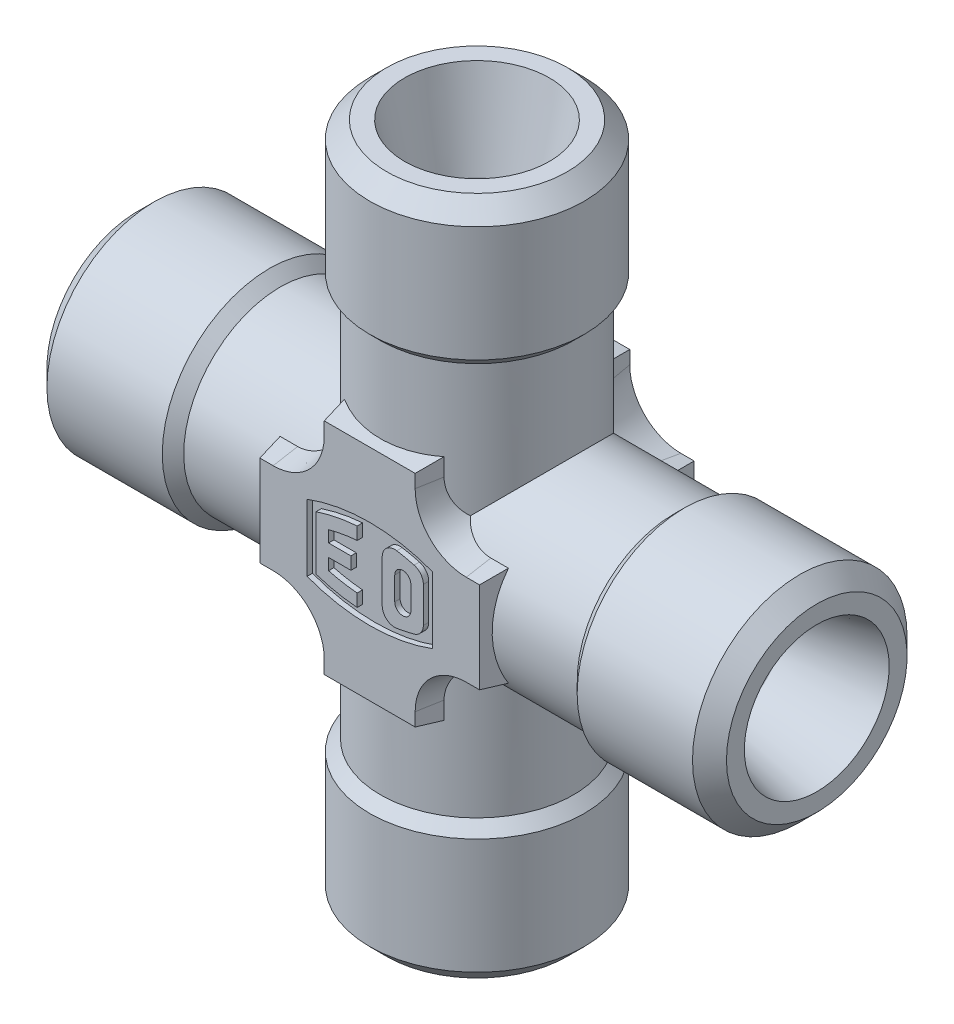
ISO-10303-21;
HEADER;
FILE_DESCRIPTION(('STEP AP214'),'2;1');
FILE_NAME('part.step','',(''),(''),'','','');
FILE_SCHEMA(('AUTOMOTIVE_DESIGN { 1 0 10303 214 1 1 1 1 }'));
ENDSEC;
DATA;
#1=APPLICATION_CONTEXT('core data for automotive mechanical design processes');
#2=APPLICATION_PROTOCOL_DEFINITION('international standard','automotive_design',2000,#1);
#3=PRODUCT_CONTEXT('',#1,'mechanical');
#4=PRODUCT('Part','Part','',(#3));
#5=PRODUCT_RELATED_PRODUCT_CATEGORY('part','',(#4));
#6=PRODUCT_DEFINITION_FORMATION('','',#4);
#7=PRODUCT_DEFINITION_CONTEXT('part definition',#1,'design');
#8=PRODUCT_DEFINITION('design','',#6,#7);
#9=PRODUCT_DEFINITION_SHAPE('','',#8);
#10=(LENGTH_UNIT() NAMED_UNIT(*) SI_UNIT(.MILLI.,.METRE.));
#11=(NAMED_UNIT(*) PLANE_ANGLE_UNIT() SI_UNIT($,.RADIAN.));
#12=(NAMED_UNIT(*) SI_UNIT($,.STERADIAN.) SOLID_ANGLE_UNIT());
#13=UNCERTAINTY_MEASURE_WITH_UNIT(LENGTH_MEASURE(1.E-05),#10,'distance_accuracy_value','');
#14=(GEOMETRIC_REPRESENTATION_CONTEXT(3) GLOBAL_UNCERTAINTY_ASSIGNED_CONTEXT((#13)) GLOBAL_UNIT_ASSIGNED_CONTEXT((#10,
#11,#12)) REPRESENTATION_CONTEXT('',''));
#15=CARTESIAN_POINT('',(0.,0.,0.));
#16=DIRECTION('',(0.,0.,1.));
#17=DIRECTION('',(1.,0.,0.));
#18=AXIS2_PLACEMENT_3D('',#15,#16,#17);
#19=CARTESIAN_POINT('',(0.,0.,5.7));
#20=DIRECTION('',(0.,0.,1.));
#21=DIRECTION('',(1.,0.,0.));
#22=AXIS2_PLACEMENT_3D('',#19,#20,#21);
#23=PLANE('',#22);
#24=CARTESIAN_POINT('',(1.85,-0.65,5.7));
#25=DIRECTION('',(0.,0.,1.));
#26=DIRECTION('',(1.,0.,0.));
#27=AXIS2_PLACEMENT_3D('',#24,#25,#26);
#28=CIRCLE('',#27,0.45);
#29=CARTESIAN_POINT('',(1.4,-0.65,5.7));
#30=VERTEX_POINT('',#29);
#31=CARTESIAN_POINT('',(2.3,-0.65,5.7));
#32=VERTEX_POINT('',#31);
#33=EDGE_CURVE('E461',#30,#32,#28,.T.);
#34=ORIENTED_EDGE('',*,*,#33,.T.);
#35=DIRECTION('',(0.,1.,0.));
#36=VECTOR('',#35,1.);
#37=CARTESIAN_POINT('',(2.3,0.65,5.7));
#38=LINE('',#37,#36);
#39=CARTESIAN_POINT('',(2.3,0.65,5.7));
#40=VERTEX_POINT('',#39);
#41=EDGE_CURVE('E373',#40,#32,#38,.F.);
#42=ORIENTED_EDGE('',*,*,#41,.F.);
#43=CARTESIAN_POINT('',(1.85,0.65,5.7));
#44=DIRECTION('',(0.,0.,1.));
#45=DIRECTION('',(1.,0.,0.));
#46=AXIS2_PLACEMENT_3D('',#43,#44,#45);
#47=CIRCLE('',#46,0.45);
#48=CARTESIAN_POINT('',(1.4,0.65,5.7));
#49=VERTEX_POINT('',#48);
#50=EDGE_CURVE('E387',#40,#49,#47,.T.);
#51=ORIENTED_EDGE('',*,*,#50,.T.);
#52=DIRECTION('',(0.,1.,0.));
#53=VECTOR('',#52,1.);
#54=CARTESIAN_POINT('',(1.4,-0.65,5.7));
#55=LINE('',#54,#53);
#56=EDGE_CURVE('E378',#30,#49,#55,.T.);
#57=ORIENTED_EDGE('',*,*,#56,.F.);
#58=EDGE_LOOP('',(#34,#42,#51,#57));
#59=FACE_BOUND('',#58,.T.);
#60=ADVANCED_FACE('F16',(#59),#23,.T.);
#61=CARTESIAN_POINT('',(0.,13.0300691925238,0.));
#62=DIRECTION('',(0.,1.,0.));
#63=DIRECTION('',(-1.,0.,0.));
#64=AXIS2_PLACEMENT_3D('',#61,#62,#63);
#65=CYLINDRICAL_SURFACE('',#64,3.);
#66=CARTESIAN_POINT('',(0.,14.060138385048,0.));
#67=DIRECTION('',(0.,1.,0.));
#68=DIRECTION('',(-1.,0.,0.));
#69=AXIS2_PLACEMENT_3D('',#66,#67,#68);
#70=CIRCLE('',#69,3.00000000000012);
#71=CARTESIAN_POINT('',(-3.00000000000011,14.060138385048,0.));
#72=VERTEX_POINT('',#71);
#73=EDGE_CURVE('E458',#72,#72,#70,.T.);
#74=ORIENTED_EDGE('',*,*,#73,.T.);
#75=EDGE_LOOP('',(#74));
#76=FACE_BOUND('',#75,.T.);
#77=CARTESIAN_POINT('',(0.,12.,0.));
#78=DIRECTION('',(0.,1.,0.));
#79=DIRECTION('',(-1.,0.,0.));
#80=AXIS2_PLACEMENT_3D('',#77,#78,#79);
#81=CIRCLE('',#80,3.);
#82=CARTESIAN_POINT('',(-3.,12.,0.));
#83=VERTEX_POINT('',#82);
#84=EDGE_CURVE('E20',#83,#83,#81,.T.);
#85=ORIENTED_EDGE('',*,*,#84,.F.);
#86=EDGE_LOOP('',(#85));
#87=FACE_BOUND('',#86,.T.);
#88=ADVANCED_FACE('F2311',(#76,#87),#65,.F.);
#89=CARTESIAN_POINT('',(-1.5,12.,0.));
#90=DIRECTION('',(0.,1.,0.));
#91=DIRECTION('',(0.,0.,1.));
#92=AXIS2_PLACEMENT_3D('',#89,#90,#91);
#93=PLANE('',#92);
#94=ORIENTED_EDGE('',*,*,#84,.T.);
#95=EDGE_LOOP('',(#94));
#96=FACE_BOUND('',#95,.T.);
#97=CARTESIAN_POINT('',(0.,12.,0.));
#98=DIRECTION('',(0.,1.,0.));
#99=DIRECTION('',(-1.,0.,0.));
#100=AXIS2_PLACEMENT_3D('',#97,#98,#99);
#101=CIRCLE('',#100,2.);
#102=CARTESIAN_POINT('',(-2.,12.,0.));
#103=VERTEX_POINT('',#102);
#104=EDGE_CURVE('E414',#103,#103,#101,.F.);
#105=ORIENTED_EDGE('',*,*,#104,.T.);
#106=EDGE_LOOP('',(#105));
#107=FACE_BOUND('',#106,.T.);
#108=ADVANCED_FACE('F2302',(#96,#107),#93,.T.);
#109=CARTESIAN_POINT('',(0.,0.,-6.));
#110=DIRECTION('',(0.,0.,1.));
#111=DIRECTION('',(1.,0.,0.));
#112=AXIS2_PLACEMENT_3D('',#109,#110,#111);
#113=PLANE('',#112);
#114=DIRECTION('',(1.,0.,0.));
#115=VECTOR('',#114,1.);
#116=CARTESIAN_POINT('',(-0.64,2.4,-6.));
#117=LINE('',#116,#115);
#118=CARTESIAN_POINT('',(1.28,2.4,-6.));
#119=VERTEX_POINT('',#118);
#120=CARTESIAN_POINT('',(-0.64,2.4,-6.));
#121=VERTEX_POINT('',#120);
#122=EDGE_CURVE('E404',#119,#121,#117,.F.);
#123=ORIENTED_EDGE('',*,*,#122,.F.);
#124=DIRECTION('',(0.,1.,0.));
#125=VECTOR('',#124,1.);
#126=CARTESIAN_POINT('',(1.28,2.4,-6.));
#127=LINE('',#126,#125);
#128=CARTESIAN_POINT('',(1.28,1.44,-6.));
#129=VERTEX_POINT('',#128);
#130=EDGE_CURVE('E410',#129,#119,#127,.T.);
#131=ORIENTED_EDGE('',*,*,#130,.F.);
#132=DIRECTION('',(1.,0.,0.));
#133=VECTOR('',#132,1.);
#134=CARTESIAN_POINT('',(1.28,1.44,-6.));
#135=LINE('',#134,#133);
#136=CARTESIAN_POINT('',(-0.64,1.44,-6.));
#137=VERTEX_POINT('',#136);
#138=EDGE_CURVE('E413',#137,#129,#135,.T.);
#139=ORIENTED_EDGE('',*,*,#138,.F.);
#140=DIRECTION('',(0.,1.,0.));
#141=VECTOR('',#140,1.);
#142=CARTESIAN_POINT('',(-0.64,1.44,-6.));
#143=LINE('',#142,#141);
#144=CARTESIAN_POINT('',(-0.64,0.479999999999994,-6.));
#145=VERTEX_POINT('',#144);
#146=EDGE_CURVE('E448',#145,#137,#143,.T.);
#147=ORIENTED_EDGE('',*,*,#146,.F.);
#148=DIRECTION('',(1.,0.,0.));
#149=VECTOR('',#148,1.);
#150=CARTESIAN_POINT('',(-0.64,0.479999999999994,-6.));
#151=LINE('',#150,#149);
#152=CARTESIAN_POINT('',(1.28,0.479999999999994,-6.));
#153=VERTEX_POINT('',#152);
#154=EDGE_CURVE('E442',#153,#145,#151,.F.);
#155=ORIENTED_EDGE('',*,*,#154,.F.);
#156=DIRECTION('',(0.,1.,0.));
#157=VECTOR('',#156,1.);
#158=CARTESIAN_POINT('',(1.28,0.479999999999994,-6.));
#159=LINE('',#158,#157);
#160=CARTESIAN_POINT('',(1.28,-2.4,-6.));
#161=VERTEX_POINT('',#160);
#162=EDGE_CURVE('E436',#161,#153,#159,.T.);
#163=ORIENTED_EDGE('',*,*,#162,.F.);
#164=DIRECTION('',(1.,0.,0.));
#165=VECTOR('',#164,1.);
#166=CARTESIAN_POINT('',(1.28,-2.4,-6.));
#167=LINE('',#166,#165);
#168=CARTESIAN_POINT('',(0.32,-2.4,-6.));
#169=VERTEX_POINT('',#168);
#170=EDGE_CURVE('E430',#169,#161,#167,.T.);
#171=ORIENTED_EDGE('',*,*,#170,.F.);
#172=DIRECTION('',(0.,1.,0.));
#173=VECTOR('',#172,1.);
#174=CARTESIAN_POINT('',(0.32,-2.4,-6.));
#175=LINE('',#174,#173);
#176=CARTESIAN_POINT('',(0.32,-0.479999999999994,-6.));
#177=VERTEX_POINT('',#176);
#178=EDGE_CURVE('E424',#177,#169,#175,.F.);
#179=ORIENTED_EDGE('',*,*,#178,.F.);
#180=DIRECTION('',(1.,0.,0.));
#181=VECTOR('',#180,1.);
#182=CARTESIAN_POINT('',(0.32,-0.479999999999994,-6.));
#183=LINE('',#182,#181);
#184=CARTESIAN_POINT('',(-0.640000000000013,-0.479999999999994,-6.));
#185=VERTEX_POINT('',#184);
#186=EDGE_CURVE('E417',#185,#177,#183,.T.);
#187=ORIENTED_EDGE('',*,*,#186,.F.);
#188=CARTESIAN_POINT('',(-0.640000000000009,0.96,-6.));
#189=DIRECTION('',(0.,0.,-1.));
#190=DIRECTION('',(-1.,0.,0.));
#191=AXIS2_PLACEMENT_3D('',#188,#189,#190);
#192=CIRCLE('',#191,1.44);
#193=EDGE_CURVE('E1020',#121,#185,#192,.F.);
#194=ORIENTED_EDGE('',*,*,#193,.F.);
#195=EDGE_LOOP('',(#123,#131,#139,#147,#155,#163,#171,#179,#187,#194));
#196=FACE_BOUND('',#195,.T.);
#197=ADVANCED_FACE('F2293',(#196),#113,.F.);
#198=CARTESIAN_POINT('',(13.0300691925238,0.,0.));
#199=DIRECTION('',(1.,0.,0.));
#200=DIRECTION('',(0.,1.,0.));
#201=AXIS2_PLACEMENT_3D('',#198,#199,#200);
#202=CYLINDRICAL_SURFACE('',#201,3.);
#203=CARTESIAN_POINT('',(14.060138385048,0.,0.));
#204=DIRECTION('',(1.,0.,0.));
#205=DIRECTION('',(0.,1.,0.));
#206=AXIS2_PLACEMENT_3D('',#203,#204,#205);
#207=CIRCLE('',#206,3.00000000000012);
#208=CARTESIAN_POINT('',(14.060138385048,3.00000000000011,0.));
#209=VERTEX_POINT('',#208);
#210=EDGE_CURVE('E399',#209,#209,#207,.T.);
#211=ORIENTED_EDGE('',*,*,#210,.T.);
#212=EDGE_LOOP('',(#211));
#213=FACE_BOUND('',#212,.T.);
#214=CARTESIAN_POINT('',(12.,0.,0.));
#215=DIRECTION('',(1.,0.,0.));
#216=DIRECTION('',(0.,1.,0.));
#217=AXIS2_PLACEMENT_3D('',#214,#215,#216);
#218=CIRCLE('',#217,3.);
#219=CARTESIAN_POINT('',(12.,3.,0.));
#220=VERTEX_POINT('',#219);
#221=EDGE_CURVE('E1110',#220,#220,#218,.T.);
#222=ORIENTED_EDGE('',*,*,#221,.F.);
#223=EDGE_LOOP('',(#222));
#224=FACE_BOUND('',#223,.T.);
#225=ADVANCED_FACE('F2285',(#213,#224),#202,.F.);
#226=CARTESIAN_POINT('',(1.4,-0.65,6.));
#227=DIRECTION('',(1.,0.,0.));
#228=DIRECTION('',(0.,0.,-1.));
#229=AXIS2_PLACEMENT_3D('',#226,#227,#228);
#230=PLANE('',#229);
#231=DIRECTION('',(0.,1.,0.));
#232=VECTOR('',#231,1.);
#233=CARTESIAN_POINT('',(1.4,0.,6.));
#234=LINE('',#233,#232);
#235=CARTESIAN_POINT('',(1.4,-0.65,6.));
#236=VERTEX_POINT('',#235);
#237=CARTESIAN_POINT('',(1.4,0.65,6.));
#238=VERTEX_POINT('',#237);
#239=EDGE_CURVE('E1118',#236,#238,#234,.T.);
#240=ORIENTED_EDGE('',*,*,#239,.F.);
#241=DIRECTION('',(0.,0.,1.));
#242=VECTOR('',#241,1.);
#243=CARTESIAN_POINT('',(1.4,-0.65,6.));
#244=LINE('',#243,#242);
#245=EDGE_CURVE('E384',#236,#30,#244,.F.);
#246=ORIENTED_EDGE('',*,*,#245,.T.);
#247=ORIENTED_EDGE('',*,*,#56,.T.);
#248=DIRECTION('',(0.,0.,1.));
#249=VECTOR('',#248,1.);
#250=CARTESIAN_POINT('',(1.4,0.65,6.));
#251=LINE('',#250,#249);
#252=EDGE_CURVE('E381',#49,#238,#251,.T.);
#253=ORIENTED_EDGE('',*,*,#252,.T.);
#254=EDGE_LOOP('',(#240,#246,#247,#253));
#255=FACE_BOUND('',#254,.T.);
#256=ADVANCED_FACE('F379',(#255),#230,.T.);
#257=CARTESIAN_POINT('',(1.85,0.65,6.));
#258=DIRECTION('',(0.,0.,1.));
#259=DIRECTION('',(1.,0.,0.));
#260=AXIS2_PLACEMENT_3D('',#257,#258,#259);
#261=CYLINDRICAL_SURFACE('',#260,0.45);
#262=DIRECTION('',(0.,0.,1.));
#263=VECTOR('',#262,1.);
#264=CARTESIAN_POINT('',(2.3,0.65,6.));
#265=LINE('',#264,#263);
#266=CARTESIAN_POINT('',(2.3,0.65,6.));
#267=VERTEX_POINT('',#266);
#268=EDGE_CURVE('E397',#267,#40,#265,.F.);
#269=ORIENTED_EDGE('',*,*,#268,.F.);
#270=CARTESIAN_POINT('',(1.85,0.65,6.));
#271=DIRECTION('',(0.,0.,1.));
#272=DIRECTION('',(1.,0.,0.));
#273=AXIS2_PLACEMENT_3D('',#270,#271,#272);
#274=CIRCLE('',#273,0.45);
#275=EDGE_CURVE('E392',#238,#267,#274,.F.);
#276=ORIENTED_EDGE('',*,*,#275,.F.);
#277=ORIENTED_EDGE('',*,*,#252,.F.);
#278=ORIENTED_EDGE('',*,*,#50,.F.);
#279=EDGE_LOOP('',(#269,#276,#277,#278));
#280=FACE_BOUND('',#279,.T.);
#281=ADVANCED_FACE('F390',(#280),#261,.F.);
#282=CARTESIAN_POINT('',(2.3,0.65,6.));
#283=DIRECTION('',(-1.,0.,0.));
#284=DIRECTION('',(0.,0.,1.));
#285=AXIS2_PLACEMENT_3D('',#282,#283,#284);
#286=PLANE('',#285);
#287=DIRECTION('',(0.,1.,0.));
#288=VECTOR('',#287,1.);
#289=CARTESIAN_POINT('',(2.3,0.,6.));
#290=LINE('',#289,#288);
#291=CARTESIAN_POINT('',(2.3,-0.65,6.));
#292=VERTEX_POINT('',#291);
#293=EDGE_CURVE('E1120',#267,#292,#290,.F.);
#294=ORIENTED_EDGE('',*,*,#293,.F.);
#295=ORIENTED_EDGE('',*,*,#268,.T.);
#296=ORIENTED_EDGE('',*,*,#41,.T.);
#297=DIRECTION('',(0.,0.,1.));
#298=VECTOR('',#297,1.);
#299=CARTESIAN_POINT('',(2.3,-0.65,6.));
#300=LINE('',#299,#298);
#301=EDGE_CURVE('E1104',#32,#292,#300,.T.);
#302=ORIENTED_EDGE('',*,*,#301,.T.);
#303=EDGE_LOOP('',(#294,#295,#296,#302));
#304=FACE_BOUND('',#303,.T.);
#305=ADVANCED_FACE('F1834',(#304),#286,.T.);
#306=CARTESIAN_POINT('',(1.85,-0.65,6.));
#307=DIRECTION('',(0.,0.,1.));
#308=DIRECTION('',(1.,0.,0.));
#309=AXIS2_PLACEMENT_3D('',#306,#307,#308);
#310=CYLINDRICAL_SURFACE('',#309,0.45);
#311=ORIENTED_EDGE('',*,*,#245,.F.);
#312=CARTESIAN_POINT('',(1.85,-0.65,6.));
#313=DIRECTION('',(0.,0.,1.));
#314=DIRECTION('',(1.,0.,0.));
#315=AXIS2_PLACEMENT_3D('',#312,#313,#314);
#316=CIRCLE('',#315,0.45);
#317=EDGE_CURVE('E1121',#292,#236,#316,.F.);
#318=ORIENTED_EDGE('',*,*,#317,.F.);
#319=ORIENTED_EDGE('',*,*,#301,.F.);
#320=ORIENTED_EDGE('',*,*,#33,.F.);
#321=EDGE_LOOP('',(#311,#318,#319,#320));
#322=FACE_BOUND('',#321,.T.);
#323=ADVANCED_FACE('F1836',(#322),#310,.F.);
#324=CARTESIAN_POINT('',(-13.0300691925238,0.,0.));
#325=DIRECTION('',(1.,0.,0.));
#326=DIRECTION('',(0.,1.,0.));
#327=AXIS2_PLACEMENT_3D('',#324,#325,#326);
#328=CYLINDRICAL_SURFACE('',#327,3.);
#329=CARTESIAN_POINT('',(-12.,0.,0.));
#330=DIRECTION('',(1.,0.,0.));
#331=DIRECTION('',(0.,1.,0.));
#332=AXIS2_PLACEMENT_3D('',#329,#330,#331);
#333=CIRCLE('',#332,3.);
#334=CARTESIAN_POINT('',(-12.,3.,0.));
#335=VERTEX_POINT('',#334);
#336=EDGE_CURVE('E460',#335,#335,#333,.F.);
#337=ORIENTED_EDGE('',*,*,#336,.F.);
#338=EDGE_LOOP('',(#337));
#339=FACE_BOUND('',#338,.T.);
#340=CARTESIAN_POINT('',(-14.060138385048,0.,0.));
#341=DIRECTION('',(-1.,0.,0.));
#342=DIRECTION('',(0.,1.,0.));
#343=AXIS2_PLACEMENT_3D('',#340,#341,#342);
#344=CIRCLE('',#343,3.00000000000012);
#345=CARTESIAN_POINT('',(-14.060138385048,3.00000000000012,0.));
#346=VERTEX_POINT('',#345);
#347=EDGE_CURVE('E1082',#346,#346,#344,.T.);
#348=ORIENTED_EDGE('',*,*,#347,.T.);
#349=EDGE_LOOP('',(#348));
#350=FACE_BOUND('',#349,.T.);
#351=ADVANCED_FACE('F1838',(#339,#350),#328,.F.);
#352=CARTESIAN_POINT('',(0.,18.9999999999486,0.));
#353=DIRECTION('',(0.,1.,0.));
#354=DIRECTION('',(0.,0.,1.));
#355=AXIS2_PLACEMENT_3D('',#352,#353,#354);
#356=CONICAL_SURFACE('',#355,4.04999999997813,0.209439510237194);
#357=CARTESIAN_POINT('',(0.,19.0000000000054,0.));
#358=DIRECTION('',(0.,1.,0.));
#359=DIRECTION('',(0.,0.,1.));
#360=AXIS2_PLACEMENT_3D('',#357,#358,#359);
#361=CIRCLE('',#360,4.04999999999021);
#362=CARTESIAN_POINT('',(0.,19.0000000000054,4.04999999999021));
#363=VERTEX_POINT('',#362);
#364=EDGE_CURVE('E1085',#363,#363,#361,.F.);
#365=ORIENTED_EDGE('',*,*,#364,.F.);
#366=EDGE_LOOP('',(#365));
#367=FACE_BOUND('',#366,.T.);
#368=ORIENTED_EDGE('',*,*,#73,.F.);
#369=EDGE_LOOP('',(#368));
#370=FACE_BOUND('',#369,.T.);
#371=ADVANCED_FACE('F1844',(#367,#370),#356,.F.);
#372=CARTESIAN_POINT('',(-12.,1.5,0.));
#373=DIRECTION('',(-1.,0.,0.));
#374=DIRECTION('',(0.,0.,1.));
#375=AXIS2_PLACEMENT_3D('',#372,#373,#374);
#376=PLANE('',#375);
#377=ORIENTED_EDGE('',*,*,#336,.T.);
#378=EDGE_LOOP('',(#377));
#379=FACE_BOUND('',#378,.T.);
#380=CARTESIAN_POINT('',(-12.,0.,0.));
#381=DIRECTION('',(1.,0.,0.));
#382=DIRECTION('',(0.,0.,-1.));
#383=AXIS2_PLACEMENT_3D('',#380,#381,#382);
#384=CIRCLE('',#383,2.);
#385=CARTESIAN_POINT('',(-12.,0.,-2.));
#386=VERTEX_POINT('',#385);
#387=EDGE_CURVE('E1134',#386,#386,#384,.T.);
#388=ORIENTED_EDGE('',*,*,#387,.T.);
#389=EDGE_LOOP('',(#388));
#390=FACE_BOUND('',#389,.T.);
#391=ADVANCED_FACE('F1852',(#379,#390),#376,.T.);
#392=CARTESIAN_POINT('',(12.,1.5,0.));
#393=DIRECTION('',(1.,0.,0.));
#394=DIRECTION('',(0.,0.,-1.));
#395=AXIS2_PLACEMENT_3D('',#392,#393,#394);
#396=PLANE('',#395);
#397=ORIENTED_EDGE('',*,*,#221,.T.);
#398=EDGE_LOOP('',(#397));
#399=FACE_BOUND('',#398,.T.);
#400=CARTESIAN_POINT('',(12.,0.,0.));
#401=DIRECTION('',(1.,0.,0.));
#402=DIRECTION('',(0.,0.,-1.));
#403=AXIS2_PLACEMENT_3D('',#400,#401,#402);
#404=CIRCLE('',#403,2.);
#405=CARTESIAN_POINT('',(12.,0.,-2.));
#406=VERTEX_POINT('',#405);
#407=EDGE_CURVE('E1137',#406,#406,#404,.F.);
#408=ORIENTED_EDGE('',*,*,#407,.T.);
#409=EDGE_LOOP('',(#408));
#410=FACE_BOUND('',#409,.T.);
#411=ADVANCED_FACE('F1856',(#399,#410),#396,.T.);
#412=CARTESIAN_POINT('',(0.,0.,0.));
#413=DIRECTION('',(0.,1.,0.));
#414=DIRECTION('',(-1.,0.,0.));
#415=AXIS2_PLACEMENT_3D('',#412,#413,#414);
#416=CYLINDRICAL_SURFACE('',#415,2.);
#417=CARTESIAN_POINT('',(0.,0.,0.));
#418=DIRECTION('',(-0.707106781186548,0.707106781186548,0.));
#419=DIRECTION('',(0.707106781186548,0.707106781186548,0.));
#420=AXIS2_PLACEMENT_3D('',#417,#418,#419);
#421=ELLIPSE('',#420,2.82842712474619,2.);
#422=CARTESIAN_POINT('',(0.,0.,-2.));
#423=VERTEX_POINT('',#422);
#424=CARTESIAN_POINT('',(0.,0.,2.));
#425=VERTEX_POINT('',#424);
#426=EDGE_CURVE('E1015',#423,#425,#421,.F.);
#427=ORIENTED_EDGE('',*,*,#426,.T.);
#428=CARTESIAN_POINT('',(0.,0.,0.));
#429=DIRECTION('',(0.707106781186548,0.707106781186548,0.));
#430=DIRECTION('',(-0.707106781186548,0.707106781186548,0.));
#431=AXIS2_PLACEMENT_3D('',#428,#429,#430);
#432=ELLIPSE('',#431,2.82842712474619,2.);
#433=EDGE_CURVE('E1132',#425,#423,#432,.F.);
#434=ORIENTED_EDGE('',*,*,#433,.T.);
#435=EDGE_LOOP('',(#427,#434));
#436=FACE_BOUND('',#435,.T.);
#437=ORIENTED_EDGE('',*,*,#104,.F.);
#438=EDGE_LOOP('',(#437));
#439=FACE_BOUND('',#438,.T.);
#440=ADVANCED_FACE('F1571',(#436,#439),#416,.F.);
#441=CARTESIAN_POINT('',(1.28,2.4,-6.));
#442=DIRECTION('',(1.,0.,0.));
#443=DIRECTION('',(0.,0.,-1.));
#444=AXIS2_PLACEMENT_3D('',#441,#442,#443);
#445=PLANE('',#444);
#446=ORIENTED_EDGE('',*,*,#130,.T.);
#447=DIRECTION('',(0.,0.,1.));
#448=VECTOR('',#447,1.);
#449=CARTESIAN_POINT('',(1.28,2.4,-6.));
#450=LINE('',#449,#448);
#451=CARTESIAN_POINT('',(1.28,2.4,-5.7));
#452=VERTEX_POINT('',#451);
#453=EDGE_CURVE('E407',#452,#119,#450,.F.);
#454=ORIENTED_EDGE('',*,*,#453,.F.);
#455=DIRECTION('',(0.,1.,0.));
#456=VECTOR('',#455,1.);
#457=CARTESIAN_POINT('',(1.28,0.,-5.7));
#458=LINE('',#457,#456);
#459=CARTESIAN_POINT('',(1.28,1.44,-5.7));
#460=VERTEX_POINT('',#459);
#461=EDGE_CURVE('E1011',#452,#460,#458,.F.);
#462=ORIENTED_EDGE('',*,*,#461,.T.);
#463=DIRECTION('',(0.,0.,-1.));
#464=VECTOR('',#463,1.);
#465=CARTESIAN_POINT('',(1.28,1.44,-6.));
#466=LINE('',#465,#464);
#467=EDGE_CURVE('E451',#129,#460,#466,.F.);
#468=ORIENTED_EDGE('',*,*,#467,.F.);
#469=EDGE_LOOP('',(#446,#454,#462,#468));
#470=FACE_BOUND('',#469,.T.);
#471=ADVANCED_FACE('F1863',(#470),#445,.T.);
#472=CARTESIAN_POINT('',(1.28,1.44,-6.));
#473=DIRECTION('',(0.,-1.,0.));
#474=DIRECTION('',(0.,0.,-1.));
#475=AXIS2_PLACEMENT_3D('',#472,#473,#474);
#476=PLANE('',#475);
#477=ORIENTED_EDGE('',*,*,#138,.T.);
#478=ORIENTED_EDGE('',*,*,#467,.T.);
#479=DIRECTION('',(1.,0.,0.));
#480=VECTOR('',#479,1.);
#481=CARTESIAN_POINT('',(0.,1.44,-5.7));
#482=LINE('',#481,#480);
#483=CARTESIAN_POINT('',(-0.64,1.44,-5.7));
#484=VERTEX_POINT('',#483);
#485=EDGE_CURVE('E1014',#460,#484,#482,.F.);
#486=ORIENTED_EDGE('',*,*,#485,.T.);
#487=DIRECTION('',(0.,0.,1.));
#488=VECTOR('',#487,1.);
#489=CARTESIAN_POINT('',(-0.64,1.44,-6.));
#490=LINE('',#489,#488);
#491=EDGE_CURVE('E445',#137,#484,#490,.T.);
#492=ORIENTED_EDGE('',*,*,#491,.F.);
#493=EDGE_LOOP('',(#477,#478,#486,#492));
#494=FACE_BOUND('',#493,.T.);
#495=ADVANCED_FACE('F1866',(#494),#476,.T.);
#496=CARTESIAN_POINT('',(-0.64,1.44,-6.));
#497=DIRECTION('',(1.,0.,0.));
#498=DIRECTION('',(0.,1.,0.));
#499=AXIS2_PLACEMENT_3D('',#496,#497,#498);
#500=PLANE('',#499);
#501=ORIENTED_EDGE('',*,*,#146,.T.);
#502=ORIENTED_EDGE('',*,*,#491,.T.);
#503=DIRECTION('',(0.,1.,0.));
#504=VECTOR('',#503,1.);
#505=CARTESIAN_POINT('',(-0.64,0.,-5.7));
#506=LINE('',#505,#504);
#507=CARTESIAN_POINT('',(-0.64,0.479999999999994,-5.7));
#508=VERTEX_POINT('',#507);
#509=EDGE_CURVE('E1056',#484,#508,#506,.F.);
#510=ORIENTED_EDGE('',*,*,#509,.T.);
#511=DIRECTION('',(0.,0.,1.));
#512=VECTOR('',#511,1.);
#513=CARTESIAN_POINT('',(-0.64,0.479999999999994,-6.));
#514=LINE('',#513,#512);
#515=EDGE_CURVE('E439',#145,#508,#514,.T.);
#516=ORIENTED_EDGE('',*,*,#515,.F.);
#517=EDGE_LOOP('',(#501,#502,#510,#516));
#518=FACE_BOUND('',#517,.T.);
#519=ADVANCED_FACE('F1870',(#518),#500,.T.);
#520=CARTESIAN_POINT('',(-0.64,0.479999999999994,-6.));
#521=DIRECTION('',(0.,1.,0.));
#522=DIRECTION('',(0.,0.,1.));
#523=AXIS2_PLACEMENT_3D('',#520,#521,#522);
#524=PLANE('',#523);
#525=ORIENTED_EDGE('',*,*,#154,.T.);
#526=ORIENTED_EDGE('',*,*,#515,.T.);
#527=DIRECTION('',(1.,0.,0.));
#528=VECTOR('',#527,1.);
#529=CARTESIAN_POINT('',(0.,0.479999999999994,-5.7));
#530=LINE('',#529,#528);
#531=CARTESIAN_POINT('',(1.28,0.479999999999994,-5.7));
#532=VERTEX_POINT('',#531);
#533=EDGE_CURVE('E1047',#508,#532,#530,.T.);
#534=ORIENTED_EDGE('',*,*,#533,.T.);
#535=DIRECTION('',(0.,0.,-1.));
#536=VECTOR('',#535,1.);
#537=CARTESIAN_POINT('',(1.28,0.479999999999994,-6.));
#538=LINE('',#537,#536);
#539=EDGE_CURVE('E433',#153,#532,#538,.F.);
#540=ORIENTED_EDGE('',*,*,#539,.F.);
#541=EDGE_LOOP('',(#525,#526,#534,#540));
#542=FACE_BOUND('',#541,.T.);
#543=ADVANCED_FACE('F1874',(#542),#524,.T.);
#544=CARTESIAN_POINT('',(1.28,0.479999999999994,-6.));
#545=DIRECTION('',(1.,0.,0.));
#546=DIRECTION('',(0.,0.,-1.));
#547=AXIS2_PLACEMENT_3D('',#544,#545,#546);
#548=PLANE('',#547);
#549=ORIENTED_EDGE('',*,*,#162,.T.);
#550=ORIENTED_EDGE('',*,*,#539,.T.);
#551=DIRECTION('',(0.,1.,0.));
#552=VECTOR('',#551,1.);
#553=CARTESIAN_POINT('',(1.28,0.,-5.7));
#554=LINE('',#553,#552);
#555=CARTESIAN_POINT('',(1.28,-2.4,-5.7));
#556=VERTEX_POINT('',#555);
#557=EDGE_CURVE('E1038',#532,#556,#554,.F.);
#558=ORIENTED_EDGE('',*,*,#557,.T.);
#559=DIRECTION('',(0.,0.,-1.));
#560=VECTOR('',#559,1.);
#561=CARTESIAN_POINT('',(1.28,-2.4,-6.));
#562=LINE('',#561,#560);
#563=EDGE_CURVE('E427',#161,#556,#562,.F.);
#564=ORIENTED_EDGE('',*,*,#563,.F.);
#565=EDGE_LOOP('',(#549,#550,#558,#564));
#566=FACE_BOUND('',#565,.T.);
#567=ADVANCED_FACE('F1878',(#566),#548,.T.);
#568=CARTESIAN_POINT('',(1.28,-2.4,-6.));
#569=DIRECTION('',(0.,-1.,0.));
#570=DIRECTION('',(0.,0.,-1.));
#571=AXIS2_PLACEMENT_3D('',#568,#569,#570);
#572=PLANE('',#571);
#573=ORIENTED_EDGE('',*,*,#170,.T.);
#574=ORIENTED_EDGE('',*,*,#563,.T.);
#575=DIRECTION('',(1.,0.,0.));
#576=VECTOR('',#575,1.);
#577=CARTESIAN_POINT('',(0.,-2.4,-5.7));
#578=LINE('',#577,#576);
#579=CARTESIAN_POINT('',(0.32,-2.4,-5.7));
#580=VERTEX_POINT('',#579);
#581=EDGE_CURVE('E1029',#556,#580,#578,.F.);
#582=ORIENTED_EDGE('',*,*,#581,.T.);
#583=DIRECTION('',(0.,0.,1.));
#584=VECTOR('',#583,1.);
#585=CARTESIAN_POINT('',(0.32,-2.4,-6.));
#586=LINE('',#585,#584);
#587=EDGE_CURVE('E421',#169,#580,#586,.T.);
#588=ORIENTED_EDGE('',*,*,#587,.F.);
#589=EDGE_LOOP('',(#573,#574,#582,#588));
#590=FACE_BOUND('',#589,.T.);
#591=ADVANCED_FACE('F1882',(#590),#572,.T.);
#592=CARTESIAN_POINT('',(0.32,-2.4,-6.));
#593=DIRECTION('',(-1.,0.,0.));
#594=DIRECTION('',(0.,0.,1.));
#595=AXIS2_PLACEMENT_3D('',#592,#593,#594);
#596=PLANE('',#595);
#597=ORIENTED_EDGE('',*,*,#178,.T.);
#598=ORIENTED_EDGE('',*,*,#587,.T.);
#599=DIRECTION('',(0.,1.,0.));
#600=VECTOR('',#599,1.);
#601=CARTESIAN_POINT('',(0.32,0.,-5.7));
#602=LINE('',#601,#600);
#603=CARTESIAN_POINT('',(0.32,-0.479999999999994,-5.7));
#604=VERTEX_POINT('',#603);
#605=EDGE_CURVE('E1025',#580,#604,#602,.T.);
#606=ORIENTED_EDGE('',*,*,#605,.T.);
#607=DIRECTION('',(0.,0.,-1.));
#608=VECTOR('',#607,1.);
#609=CARTESIAN_POINT('',(0.32,-0.479999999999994,-6.));
#610=LINE('',#609,#608);
#611=EDGE_CURVE('E420',#177,#604,#610,.F.);
#612=ORIENTED_EDGE('',*,*,#611,.F.);
#613=EDGE_LOOP('',(#597,#598,#606,#612));
#614=FACE_BOUND('',#613,.T.);
#615=ADVANCED_FACE('F1886',(#614),#596,.T.);
#616=CARTESIAN_POINT('',(0.32,-0.479999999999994,-6.));
#617=DIRECTION('',(0.,-1.,0.));
#618=DIRECTION('',(0.,0.,-1.));
#619=AXIS2_PLACEMENT_3D('',#616,#617,#618);
#620=PLANE('',#619);
#621=ORIENTED_EDGE('',*,*,#186,.T.);
#622=ORIENTED_EDGE('',*,*,#611,.T.);
#623=DIRECTION('',(1.,0.,0.));
#624=VECTOR('',#623,1.);
#625=CARTESIAN_POINT('',(0.,-0.479999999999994,-5.7));
#626=LINE('',#625,#624);
#627=CARTESIAN_POINT('',(-0.640000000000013,-0.479999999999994,-5.7));
#628=VERTEX_POINT('',#627);
#629=EDGE_CURVE('E1028',#604,#628,#626,.F.);
#630=ORIENTED_EDGE('',*,*,#629,.T.);
#631=DIRECTION('',(0.,0.,-1.));
#632=VECTOR('',#631,1.);
#633=CARTESIAN_POINT('',(-0.640000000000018,-0.479999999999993,-6.));
#634=LINE('',#633,#632);
#635=EDGE_CURVE('E1008',#185,#628,#634,.F.);
#636=ORIENTED_EDGE('',*,*,#635,.F.);
#637=EDGE_LOOP('',(#621,#622,#630,#636));
#638=FACE_BOUND('',#637,.T.);
#639=ADVANCED_FACE('F1890',(#638),#620,.T.);
#640=CARTESIAN_POINT('',(-0.640000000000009,0.96,-6.));
#641=DIRECTION('',(0.,0.,-1.));
#642=DIRECTION('',(-1.,0.,0.));
#643=AXIS2_PLACEMENT_3D('',#640,#641,#642);
#644=CYLINDRICAL_SURFACE('',#643,1.44);
#645=ORIENTED_EDGE('',*,*,#193,.T.);
#646=ORIENTED_EDGE('',*,*,#635,.T.);
#647=CARTESIAN_POINT('',(-0.640000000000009,0.96,-5.7));
#648=DIRECTION('',(0.,0.,-1.));
#649=DIRECTION('',(-1.,0.,0.));
#650=AXIS2_PLACEMENT_3D('',#647,#648,#649);
#651=CIRCLE('',#650,1.44);
#652=CARTESIAN_POINT('',(-0.64,2.4,-5.7));
#653=VERTEX_POINT('',#652);
#654=EDGE_CURVE('E1142',#628,#653,#651,.T.);
#655=ORIENTED_EDGE('',*,*,#654,.T.);
#656=DIRECTION('',(0.,0.,1.));
#657=VECTOR('',#656,1.);
#658=CARTESIAN_POINT('',(-0.64,2.4,-6.));
#659=LINE('',#658,#657);
#660=EDGE_CURVE('E403',#121,#653,#659,.T.);
#661=ORIENTED_EDGE('',*,*,#660,.F.);
#662=EDGE_LOOP('',(#645,#646,#655,#661));
#663=FACE_BOUND('',#662,.T.);
#664=ADVANCED_FACE('F1894',(#663),#644,.T.);
#665=CARTESIAN_POINT('',(-0.64,2.4,-6.));
#666=DIRECTION('',(0.,1.,0.));
#667=DIRECTION('',(0.,0.,1.));
#668=AXIS2_PLACEMENT_3D('',#665,#666,#667);
#669=PLANE('',#668);
#670=ORIENTED_EDGE('',*,*,#122,.T.);
#671=ORIENTED_EDGE('',*,*,#660,.T.);
#672=DIRECTION('',(1.,0.,0.));
#673=VECTOR('',#672,1.);
#674=CARTESIAN_POINT('',(0.,2.4,-5.7));
#675=LINE('',#674,#673);
#676=EDGE_CURVE('E1144',#653,#452,#675,.T.);
#677=ORIENTED_EDGE('',*,*,#676,.T.);
#678=ORIENTED_EDGE('',*,*,#453,.T.);
#679=EDGE_LOOP('',(#670,#671,#677,#678));
#680=FACE_BOUND('',#679,.T.);
#681=ADVANCED_FACE('F1898',(#680),#669,.T.);
#682=CARTESIAN_POINT('',(18.9999999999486,0.,0.));
#683=DIRECTION('',(1.,0.,0.));
#684=DIRECTION('',(0.,0.,-1.));
#685=AXIS2_PLACEMENT_3D('',#682,#683,#684);
#686=CONICAL_SURFACE('',#685,4.04999999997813,0.209439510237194);
#687=CARTESIAN_POINT('',(19.0000000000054,0.,0.));
#688=DIRECTION('',(1.,0.,0.));
#689=DIRECTION('',(0.,0.,-1.));
#690=AXIS2_PLACEMENT_3D('',#687,#688,#689);
#691=CIRCLE('',#690,4.04999999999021);
#692=CARTESIAN_POINT('',(19.0000000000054,0.,-4.04999999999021));
#693=VERTEX_POINT('',#692);
#694=EDGE_CURVE('E1145',#693,#693,#691,.F.);
#695=ORIENTED_EDGE('',*,*,#694,.F.);
#696=EDGE_LOOP('',(#695));
#697=FACE_BOUND('',#696,.T.);
#698=ORIENTED_EDGE('',*,*,#210,.F.);
#699=EDGE_LOOP('',(#698));
#700=FACE_BOUND('',#699,.T.);
#701=ADVANCED_FACE('F1902',(#697,#700),#686,.F.);
#702=CARTESIAN_POINT('',(0.,0.,6.));
#703=DIRECTION('',(0.,0.,1.));
#704=DIRECTION('',(1.,0.,0.));
#705=AXIS2_PLACEMENT_3D('',#702,#703,#704);
#706=PLANE('',#705);
#707=ORIENTED_EDGE('',*,*,#293,.T.);
#708=ORIENTED_EDGE('',*,*,#317,.T.);
#709=ORIENTED_EDGE('',*,*,#239,.T.);
#710=ORIENTED_EDGE('',*,*,#275,.T.);
#711=EDGE_LOOP('',(#707,#708,#709,#710));
#712=FACE_BOUND('',#711,.T.);
#713=CARTESIAN_POINT('',(1.40000000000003,1.18792265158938,6.));
#714=DIRECTION('',(0.,0.,1.));
#715=DIRECTION('',(1.,0.,0.));
#716=AXIS2_PLACEMENT_3D('',#713,#714,#715);
#717=CIRCLE('',#716,0.700000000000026);
#718=CARTESIAN_POINT('',(0.7,1.18792265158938,6.));
#719=VERTEX_POINT('',#718);
#720=CARTESIAN_POINT('',(1.51136355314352,1.87900742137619,6.));
#721=VERTEX_POINT('',#720);
#722=EDGE_CURVE('E984',#719,#721,#717,.F.);
#723=ORIENTED_EDGE('',*,*,#722,.F.);
#724=DIRECTION('',(0.,1.,0.));
#725=VECTOR('',#724,1.);
#726=CARTESIAN_POINT('',(0.7,1.18792265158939,6.));
#727=LINE('',#726,#725);
#728=CARTESIAN_POINT('',(0.7,-1.18792265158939,6.));
#729=VERTEX_POINT('',#728);
#730=EDGE_CURVE('E988',#729,#719,#727,.T.);
#731=ORIENTED_EDGE('',*,*,#730,.F.);
#732=CARTESIAN_POINT('',(1.4,-1.18792265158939,6.));
#733=DIRECTION('',(0.,0.,1.));
#734=DIRECTION('',(1.,0.,0.));
#735=AXIS2_PLACEMENT_3D('',#732,#733,#734);
#736=CIRCLE('',#735,0.7);
#737=CARTESIAN_POINT('',(1.51136362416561,-1.87900740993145,6.));
#738=VERTEX_POINT('',#737);
#739=EDGE_CURVE('E992',#738,#729,#736,.F.);
#740=ORIENTED_EDGE('',*,*,#739,.F.);
#741=CARTESIAN_POINT('',(-1.53876911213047E-13,7.5,6.));
#742=DIRECTION('',(0.,0.,1.));
#743=DIRECTION('',(1.,0.,0.));
#744=AXIS2_PLACEMENT_3D('',#741,#742,#743);
#745=CIRCLE('',#744,9.5);
#746=CARTESIAN_POINT('',(2.48295446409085,-1.66978391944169,6.));
#747=VERTEX_POINT('',#746);
#748=EDGE_CURVE('E996',#747,#738,#745,.F.);
#749=ORIENTED_EDGE('',*,*,#748,.F.);
#750=CARTESIAN_POINT('',(2.29999999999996,-0.994115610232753,6.));
#751=DIRECTION('',(0.,0.,1.));
#752=DIRECTION('',(1.,0.,0.));
#753=AXIS2_PLACEMENT_3D('',#750,#751,#752);
#754=CIRCLE('',#753,0.700000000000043);
#755=CARTESIAN_POINT('',(3.,-0.994115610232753,6.));
#756=VERTEX_POINT('',#755);
#757=EDGE_CURVE('E402',#747,#756,#754,.T.);
#758=ORIENTED_EDGE('',*,*,#757,.T.);
#759=DIRECTION('',(0.,1.,0.));
#760=VECTOR('',#759,1.);
#761=CARTESIAN_POINT('',(3.,-0.994115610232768,6.));
#762=LINE('',#761,#760);
#763=CARTESIAN_POINT('',(3.,0.994115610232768,6.));
#764=VERTEX_POINT('',#763);
#765=EDGE_CURVE('E972',#764,#756,#762,.F.);
#766=ORIENTED_EDGE('',*,*,#765,.F.);
#767=CARTESIAN_POINT('',(2.3,0.994115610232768,6.));
#768=DIRECTION('',(0.,0.,1.));
#769=DIRECTION('',(1.,0.,0.));
#770=AXIS2_PLACEMENT_3D('',#767,#768,#769);
#771=CIRCLE('',#770,0.7);
#772=CARTESIAN_POINT('',(2.48295453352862,1.66978390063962,6.));
#773=VERTEX_POINT('',#772);
#774=EDGE_CURVE('E976',#773,#764,#771,.F.);
#775=ORIENTED_EDGE('',*,*,#774,.F.);
#776=CARTESIAN_POINT('',(0.,-7.5,6.));
#777=DIRECTION('',(0.,0.,1.));
#778=DIRECTION('',(1.,0.,0.));
#779=AXIS2_PLACEMENT_3D('',#776,#777,#778);
#780=CIRCLE('',#779,9.5);
#781=EDGE_CURVE('E980',#721,#773,#780,.F.);
#782=ORIENTED_EDGE('',*,*,#781,.F.);
#783=EDGE_LOOP('',(#723,#731,#740,#749,#758,#766,#775,#782));
#784=FACE_BOUND('',#783,.T.);
#785=ADVANCED_FACE('F1830',(#712,#784),#706,.T.);
#786=CARTESIAN_POINT('',(0.,0.,6.));
#787=DIRECTION('',(0.,0.,1.));
#788=DIRECTION('',(1.,0.,0.));
#789=AXIS2_PLACEMENT_3D('',#786,#787,#788);
#790=PLANE('',#789);
#791=CARTESIAN_POINT('',(0.,-7.49999999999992,6.));
#792=DIRECTION('',(0.,0.,1.));
#793=DIRECTION('',(1.,0.,0.));
#794=AXIS2_PLACEMENT_3D('',#791,#792,#793);
#795=CIRCLE('',#794,9.5);
#796=CARTESIAN_POINT('',(-3.,1.51387818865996,6.));
#797=VERTEX_POINT('',#796);
#798=CARTESIAN_POINT('',(-0.7,1.97417542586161,6.));
#799=VERTEX_POINT('',#798);
#800=EDGE_CURVE('E953',#797,#799,#795,.F.);
#801=ORIENTED_EDGE('',*,*,#800,.F.);
#802=DIRECTION('',(0.,1.,0.));
#803=VECTOR('',#802,1.);
#804=CARTESIAN_POINT('',(-3.,1.51387818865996,6.));
#805=LINE('',#804,#803);
#806=CARTESIAN_POINT('',(-3.,-1.51387818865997,6.));
#807=VERTEX_POINT('',#806);
#808=EDGE_CURVE('E957',#807,#797,#805,.T.);
#809=ORIENTED_EDGE('',*,*,#808,.F.);
#810=CARTESIAN_POINT('',(0.,7.5,6.));
#811=DIRECTION('',(0.,0.,1.));
#812=DIRECTION('',(1.,0.,0.));
#813=AXIS2_PLACEMENT_3D('',#810,#811,#812);
#814=CIRCLE('',#813,9.5);
#815=CARTESIAN_POINT('',(-0.7,-1.9741754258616,6.));
#816=VERTEX_POINT('',#815);
#817=EDGE_CURVE('E961',#816,#807,#814,.F.);
#818=ORIENTED_EDGE('',*,*,#817,.F.);
#819=DIRECTION('',(0.,1.,0.));
#820=VECTOR('',#819,1.);
#821=CARTESIAN_POINT('',(-0.7,-1.97417542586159,6.));
#822=LINE('',#821,#820);
#823=CARTESIAN_POINT('',(-0.7,-1.27211491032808,6.));
#824=VERTEX_POINT('',#823);
#825=EDGE_CURVE('E965',#824,#816,#822,.F.);
#826=ORIENTED_EDGE('',*,*,#825,.F.);
#827=CARTESIAN_POINT('',(0.,7.5,6.));
#828=DIRECTION('',(0.,0.,1.));
#829=DIRECTION('',(1.,0.,0.));
#830=AXIS2_PLACEMENT_3D('',#827,#828,#829);
#831=CIRCLE('',#830,8.8);
#832=CARTESIAN_POINT('',(-2.3,-0.994115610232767,6.));
#833=VERTEX_POINT('',#832);
#834=EDGE_CURVE('E1124',#824,#833,#831,.F.);
#835=ORIENTED_EDGE('',*,*,#834,.T.);
#836=DIRECTION('',(0.,1.,0.));
#837=VECTOR('',#836,1.);
#838=CARTESIAN_POINT('',(-2.3,0.,6.));
#839=LINE('',#838,#837);
#840=CARTESIAN_POINT('',(-2.3,-0.35,6.));
#841=VERTEX_POINT('',#840);
#842=EDGE_CURVE('E1101',#833,#841,#839,.T.);
#843=ORIENTED_EDGE('',*,*,#842,.T.);
#844=DIRECTION('',(1.,0.,0.));
#845=VECTOR('',#844,1.);
#846=CARTESIAN_POINT('',(0.,-0.35,6.));
#847=LINE('',#846,#845);
#848=CARTESIAN_POINT('',(-1.05,-0.35,6.));
#849=VERTEX_POINT('',#848);
#850=EDGE_CURVE('E1096',#841,#849,#847,.T.);
#851=ORIENTED_EDGE('',*,*,#850,.T.);
#852=DIRECTION('',(0.,1.,0.));
#853=VECTOR('',#852,1.);
#854=CARTESIAN_POINT('',(-1.05,0.,6.));
#855=LINE('',#854,#853);
#856=CARTESIAN_POINT('',(-1.05,0.35,6.));
#857=VERTEX_POINT('',#856);
#858=EDGE_CURVE('E1091',#849,#857,#855,.T.);
#859=ORIENTED_EDGE('',*,*,#858,.T.);
#860=DIRECTION('',(1.,0.,0.));
#861=VECTOR('',#860,1.);
#862=CARTESIAN_POINT('',(0.,0.35,6.));
#863=LINE('',#862,#861);
#864=CARTESIAN_POINT('',(-2.3,0.35,6.));
#865=VERTEX_POINT('',#864);
#866=EDGE_CURVE('E1087',#857,#865,#863,.F.);
#867=ORIENTED_EDGE('',*,*,#866,.T.);
#868=DIRECTION('',(0.,1.,0.));
#869=VECTOR('',#868,1.);
#870=CARTESIAN_POINT('',(-2.3,0.,6.));
#871=LINE('',#870,#869);
#872=CARTESIAN_POINT('',(-2.3,0.99411561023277,6.));
#873=VERTEX_POINT('',#872);
#874=EDGE_CURVE('E1090',#865,#873,#871,.T.);
#875=ORIENTED_EDGE('',*,*,#874,.T.);
#876=CARTESIAN_POINT('',(0.,-7.49999999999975,6.));
#877=DIRECTION('',(0.,0.,1.));
#878=DIRECTION('',(1.,0.,0.));
#879=AXIS2_PLACEMENT_3D('',#876,#877,#878);
#880=CIRCLE('',#879,8.79999999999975);
#881=CARTESIAN_POINT('',(-0.7,1.27211491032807,6.));
#882=VERTEX_POINT('',#881);
#883=EDGE_CURVE('E1127',#873,#882,#880,.F.);
#884=ORIENTED_EDGE('',*,*,#883,.T.);
#885=DIRECTION('',(0.,1.,0.));
#886=VECTOR('',#885,1.);
#887=CARTESIAN_POINT('',(-0.7,0.,6.));
#888=LINE('',#887,#886);
#889=EDGE_CURVE('E1086',#882,#799,#888,.T.);
#890=ORIENTED_EDGE('',*,*,#889,.T.);
#891=EDGE_LOOP('',(#801,#809,#818,#826,#835,#843,#851,#859,#867,#875,#884,#890));
#892=FACE_BOUND('',#891,.T.);
#893=ADVANCED_FACE('F1909',(#892),#790,.T.);
#894=CARTESIAN_POINT('',(-18.9999999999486,0.,0.));
#895=DIRECTION('',(-1.,0.,0.));
#896=DIRECTION('',(0.,0.,1.));
#897=AXIS2_PLACEMENT_3D('',#894,#895,#896);
#898=CONICAL_SURFACE('',#897,4.04999999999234,0.209439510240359);
#899=ORIENTED_EDGE('',*,*,#347,.F.);
#900=EDGE_LOOP('',(#899));
#901=FACE_BOUND('',#900,.T.);
#902=CARTESIAN_POINT('',(-19.0000000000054,0.,0.));
#903=DIRECTION('',(-1.,0.,0.));
#904=DIRECTION('',(0.,0.,1.));
#905=AXIS2_PLACEMENT_3D('',#902,#903,#904);
#906=CIRCLE('',#905,4.05000000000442);
#907=CARTESIAN_POINT('',(-19.0000000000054,0.,4.05000000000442));
#908=VERTEX_POINT('',#907);
#909=EDGE_CURVE('E904',#908,#908,#906,.F.);
#910=ORIENTED_EDGE('',*,*,#909,.F.);
#911=EDGE_LOOP('',(#910));
#912=FACE_BOUND('',#911,.T.);
#913=ADVANCED_FACE('F1584',(#901,#912),#898,.F.);
#914=CARTESIAN_POINT('',(-4.55,19.,0.));
#915=DIRECTION('',(0.,1.,0.));
#916=DIRECTION('',(0.,0.,1.));
#917=AXIS2_PLACEMENT_3D('',#914,#915,#916);
#918=PLANE('',#917);
#919=ORIENTED_EDGE('',*,*,#364,.T.);
#920=EDGE_LOOP('',(#919));
#921=FACE_BOUND('',#920,.T.);
#922=CARTESIAN_POINT('',(0.,18.9999999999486,0.));
#923=DIRECTION('',(0.,-1.,0.));
#924=DIRECTION('',(0.,0.,-1.));
#925=AXIS2_PLACEMENT_3D('',#922,#923,#924);
#926=CIRCLE('',#925,5.0499999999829);
#927=CARTESIAN_POINT('',(0.,18.9999999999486,-5.0499999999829));
#928=VERTEX_POINT('',#927);
#929=EDGE_CURVE('E1158',#928,#928,#926,.T.);
#930=ORIENTED_EDGE('',*,*,#929,.F.);
#931=EDGE_LOOP('',(#930));
#932=FACE_BOUND('',#931,.T.);
#933=ADVANCED_FACE('F1575',(#921,#932),#918,.T.);
#934=CARTESIAN_POINT('',(0.,0.,0.));
#935=DIRECTION('',(1.,0.,0.));
#936=DIRECTION('',(0.,0.,-1.));
#937=AXIS2_PLACEMENT_3D('',#934,#935,#936);
#938=CYLINDRICAL_SURFACE('',#937,2.);
#939=ORIENTED_EDGE('',*,*,#387,.F.);
#940=EDGE_LOOP('',(#939));
#941=FACE_BOUND('',#940,.T.);
#942=ORIENTED_EDGE('',*,*,#433,.F.);
#943=CARTESIAN_POINT('',(0.,0.,0.));
#944=DIRECTION('',(0.707106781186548,-0.707106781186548,0.));
#945=DIRECTION('',(0.707106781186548,0.707106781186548,0.));
#946=AXIS2_PLACEMENT_3D('',#943,#944,#945);
#947=ELLIPSE('',#946,2.82842712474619,2.);
#948=EDGE_CURVE('E1161',#425,#423,#947,.T.);
#949=ORIENTED_EDGE('',*,*,#948,.T.);
#950=EDGE_LOOP('',(#942,#949));
#951=FACE_BOUND('',#950,.T.);
#952=ADVANCED_FACE('F1573',(#941,#951),#938,.F.);
#953=CARTESIAN_POINT('',(0.,0.,0.));
#954=DIRECTION('',(1.,0.,0.));
#955=DIRECTION('',(0.,0.,-1.));
#956=AXIS2_PLACEMENT_3D('',#953,#954,#955);
#957=CYLINDRICAL_SURFACE('',#956,2.);
#958=CARTESIAN_POINT('',(0.,0.,0.));
#959=DIRECTION('',(0.707106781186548,0.707106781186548,0.));
#960=DIRECTION('',(0.707106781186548,-0.707106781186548,0.));
#961=AXIS2_PLACEMENT_3D('',#958,#959,#960);
#962=ELLIPSE('',#961,2.82842712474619,2.);
#963=EDGE_CURVE('E1164',#423,#425,#962,.F.);
#964=ORIENTED_EDGE('',*,*,#963,.T.);
#965=ORIENTED_EDGE('',*,*,#426,.F.);
#966=EDGE_LOOP('',(#964,#965));
#967=FACE_BOUND('',#966,.T.);
#968=ORIENTED_EDGE('',*,*,#407,.F.);
#969=EDGE_LOOP('',(#968));
#970=FACE_BOUND('',#969,.T.);
#971=ADVANCED_FACE('F1568',(#967,#970),#957,.F.);
#972=CARTESIAN_POINT('',(0.,0.,-5.7));
#973=DIRECTION('',(0.,0.,1.));
#974=DIRECTION('',(1.,0.,0.));
#975=AXIS2_PLACEMENT_3D('',#972,#973,#974);
#976=PLANE('',#975);
#977=CARTESIAN_POINT('',(0.,0.,-5.7));
#978=DIRECTION('',(0.,0.,-1.));
#979=DIRECTION('',(-1.,0.,0.));
#980=AXIS2_PLACEMENT_3D('',#977,#978,#979);
#981=CIRCLE('',#980,3.36);
#982=CARTESIAN_POINT('',(-3.36,0.,-5.7));
#983=VERTEX_POINT('',#982);
#984=EDGE_CURVE('E1167',#983,#983,#981,.T.);
#985=ORIENTED_EDGE('',*,*,#984,.T.);
#986=EDGE_LOOP('',(#985));
#987=FACE_BOUND('',#986,.T.);
#988=ORIENTED_EDGE('',*,*,#654,.F.);
#989=ORIENTED_EDGE('',*,*,#629,.F.);
#990=ORIENTED_EDGE('',*,*,#605,.F.);
#991=ORIENTED_EDGE('',*,*,#581,.F.);
#992=ORIENTED_EDGE('',*,*,#557,.F.);
#993=ORIENTED_EDGE('',*,*,#533,.F.);
#994=ORIENTED_EDGE('',*,*,#509,.F.);
#995=ORIENTED_EDGE('',*,*,#485,.F.);
#996=ORIENTED_EDGE('',*,*,#461,.F.);
#997=ORIENTED_EDGE('',*,*,#676,.F.);
#998=EDGE_LOOP('',(#988,#989,#990,#991,#992,#993,#994,#995,#996,#997));
#999=FACE_BOUND('',#998,.T.);
#1000=ADVANCED_FACE('F1582',(#987,#999),#976,.F.);
#1001=CARTESIAN_POINT('',(19.,4.55,0.));
#1002=DIRECTION('',(1.,0.,0.));
#1003=DIRECTION('',(0.,0.,-1.));
#1004=AXIS2_PLACEMENT_3D('',#1001,#1002,#1003);
#1005=PLANE('',#1004);
#1006=ORIENTED_EDGE('',*,*,#694,.T.);
#1007=EDGE_LOOP('',(#1006));
#1008=FACE_BOUND('',#1007,.T.);
#1009=CARTESIAN_POINT('',(19.0000000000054,0.,0.));
#1010=DIRECTION('',(-1.,0.,0.));
#1011=DIRECTION('',(0.,0.,1.));
#1012=AXIS2_PLACEMENT_3D('',#1009,#1010,#1011);
#1013=CIRCLE('',#1012,5.0499999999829);
#1014=CARTESIAN_POINT('',(19.0000000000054,0.,5.0499999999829));
#1015=VERTEX_POINT('',#1014);
#1016=EDGE_CURVE('E1170',#1015,#1015,#1013,.T.);
#1017=ORIENTED_EDGE('',*,*,#1016,.F.);
#1018=EDGE_LOOP('',(#1017));
#1019=FACE_BOUND('',#1018,.T.);
#1020=ADVANCED_FACE('F1592',(#1008,#1019),#1005,.T.);
#1021=CARTESIAN_POINT('',(-1.53876911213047E-13,7.5,6.));
#1022=DIRECTION('',(0.,0.,1.));
#1023=DIRECTION('',(1.,0.,0.));
#1024=AXIS2_PLACEMENT_3D('',#1021,#1022,#1023);
#1025=CYLINDRICAL_SURFACE('',#1024,9.5);
#1026=ORIENTED_EDGE('',*,*,#748,.T.);
#1027=DIRECTION('',(0.,0.,1.));
#1028=VECTOR('',#1027,1.);
#1029=CARTESIAN_POINT('',(1.51136361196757,-1.87900741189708,6.));
#1030=LINE('',#1029,#1028);
#1031=CARTESIAN_POINT('',(1.51136362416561,-1.87900740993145,5.7));
#1032=VERTEX_POINT('',#1031);
#1033=EDGE_CURVE('E993',#1032,#738,#1030,.T.);
#1034=ORIENTED_EDGE('',*,*,#1033,.F.);
#1035=CARTESIAN_POINT('',(-1.53876911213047E-13,7.5,5.7));
#1036=DIRECTION('',(0.,0.,1.));
#1037=DIRECTION('',(1.,0.,0.));
#1038=AXIS2_PLACEMENT_3D('',#1035,#1036,#1037);
#1039=CIRCLE('',#1038,9.5);
#1040=CARTESIAN_POINT('',(2.48295446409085,-1.66978391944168,5.7));
#1041=VERTEX_POINT('',#1040);
#1042=EDGE_CURVE('E1173',#1041,#1032,#1039,.F.);
#1043=ORIENTED_EDGE('',*,*,#1042,.F.);
#1044=DIRECTION('',(0.,0.,1.));
#1045=VECTOR('',#1044,1.);
#1046=CARTESIAN_POINT('',(2.48295438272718,-1.66978394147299,6.));
#1047=LINE('',#1046,#1045);
#1048=EDGE_CURVE('E966',#747,#1041,#1047,.F.);
#1049=ORIENTED_EDGE('',*,*,#1048,.F.);
#1050=EDGE_LOOP('',(#1026,#1034,#1043,#1049));
#1051=FACE_BOUND('',#1050,.T.);
#1052=ADVANCED_FACE('F1596',(#1051),#1025,.T.);
#1053=CARTESIAN_POINT('',(1.4,-1.18792265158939,6.));
#1054=DIRECTION('',(0.,0.,1.));
#1055=DIRECTION('',(1.,0.,0.));
#1056=AXIS2_PLACEMENT_3D('',#1053,#1054,#1055);
#1057=CYLINDRICAL_SURFACE('',#1056,0.7);
#1058=ORIENTED_EDGE('',*,*,#739,.T.);
#1059=DIRECTION('',(0.,0.,1.));
#1060=VECTOR('',#1059,1.);
#1061=CARTESIAN_POINT('',(0.7,-1.18792265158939,6.));
#1062=LINE('',#1061,#1060);
#1063=CARTESIAN_POINT('',(0.7,-1.18792265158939,5.7));
#1064=VERTEX_POINT('',#1063);
#1065=EDGE_CURVE('E989',#1064,#729,#1062,.T.);
#1066=ORIENTED_EDGE('',*,*,#1065,.F.);
#1067=CARTESIAN_POINT('',(1.4,-1.18792265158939,5.7));
#1068=DIRECTION('',(0.,0.,1.));
#1069=DIRECTION('',(1.,0.,0.));
#1070=AXIS2_PLACEMENT_3D('',#1067,#1068,#1069);
#1071=CIRCLE('',#1070,0.7);
#1072=EDGE_CURVE('E1176',#1032,#1064,#1071,.F.);
#1073=ORIENTED_EDGE('',*,*,#1072,.F.);
#1074=ORIENTED_EDGE('',*,*,#1033,.T.);
#1075=EDGE_LOOP('',(#1058,#1066,#1073,#1074));
#1076=FACE_BOUND('',#1075,.T.);
#1077=ADVANCED_FACE('F1600',(#1076),#1057,.T.);
#1078=CARTESIAN_POINT('',(0.7,1.18792265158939,6.));
#1079=DIRECTION('',(-1.,0.,0.));
#1080=DIRECTION('',(0.,0.,1.));
#1081=AXIS2_PLACEMENT_3D('',#1078,#1079,#1080);
#1082=PLANE('',#1081);
#1083=ORIENTED_EDGE('',*,*,#730,.T.);
#1084=DIRECTION('',(0.,0.,1.));
#1085=VECTOR('',#1084,1.);
#1086=CARTESIAN_POINT('',(0.7,1.18792265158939,6.));
#1087=LINE('',#1086,#1085);
#1088=CARTESIAN_POINT('',(0.7,1.18792265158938,5.7));
#1089=VERTEX_POINT('',#1088);
#1090=EDGE_CURVE('E985',#1089,#719,#1087,.T.);
#1091=ORIENTED_EDGE('',*,*,#1090,.F.);
#1092=DIRECTION('',(0.,1.,0.));
#1093=VECTOR('',#1092,1.);
#1094=CARTESIAN_POINT('',(0.7,0.,5.7));
#1095=LINE('',#1094,#1093);
#1096=EDGE_CURVE('E1179',#1064,#1089,#1095,.T.);
#1097=ORIENTED_EDGE('',*,*,#1096,.F.);
#1098=ORIENTED_EDGE('',*,*,#1065,.T.);
#1099=EDGE_LOOP('',(#1083,#1091,#1097,#1098));
#1100=FACE_BOUND('',#1099,.T.);
#1101=ADVANCED_FACE('F1604',(#1100),#1082,.T.);
#1102=CARTESIAN_POINT('',(1.40000000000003,1.18792265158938,6.));
#1103=DIRECTION('',(0.,0.,1.));
#1104=DIRECTION('',(1.,0.,0.));
#1105=AXIS2_PLACEMENT_3D('',#1102,#1103,#1104);
#1106=CYLINDRICAL_SURFACE('',#1105,0.700000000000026);
#1107=ORIENTED_EDGE('',*,*,#722,.T.);
#1108=DIRECTION('',(0.,0.,1.));
#1109=VECTOR('',#1108,1.);
#1110=CARTESIAN_POINT('',(1.51136346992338,1.87900743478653,6.));
#1111=LINE('',#1110,#1109);
#1112=CARTESIAN_POINT('',(1.51136355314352,1.87900742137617,5.7));
#1113=VERTEX_POINT('',#1112);
#1114=EDGE_CURVE('E981',#1113,#721,#1111,.T.);
#1115=ORIENTED_EDGE('',*,*,#1114,.F.);
#1116=CARTESIAN_POINT('',(1.40000000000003,1.18792265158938,5.7));
#1117=DIRECTION('',(0.,0.,1.));
#1118=DIRECTION('',(1.,0.,0.));
#1119=AXIS2_PLACEMENT_3D('',#1116,#1117,#1118);
#1120=CIRCLE('',#1119,0.700000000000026);
#1121=EDGE_CURVE('E1180',#1089,#1113,#1120,.F.);
#1122=ORIENTED_EDGE('',*,*,#1121,.F.);
#1123=ORIENTED_EDGE('',*,*,#1090,.T.);
#1124=EDGE_LOOP('',(#1107,#1115,#1122,#1123));
#1125=FACE_BOUND('',#1124,.T.);
#1126=ADVANCED_FACE('F1608',(#1125),#1106,.T.);
#1127=CARTESIAN_POINT('',(0.,-7.5,6.));
#1128=DIRECTION('',(0.,0.,1.));
#1129=DIRECTION('',(1.,0.,0.));
#1130=AXIS2_PLACEMENT_3D('',#1127,#1128,#1129);
#1131=CYLINDRICAL_SURFACE('',#1130,9.5);
#1132=ORIENTED_EDGE('',*,*,#781,.T.);
#1133=DIRECTION('',(0.,0.,1.));
#1134=VECTOR('',#1133,1.);
#1135=CARTESIAN_POINT('',(2.4829545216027,1.66978390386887,6.));
#1136=LINE('',#1135,#1134);
#1137=CARTESIAN_POINT('',(2.48295453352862,1.66978390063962,5.7));
#1138=VERTEX_POINT('',#1137);
#1139=EDGE_CURVE('E977',#1138,#773,#1136,.T.);
#1140=ORIENTED_EDGE('',*,*,#1139,.F.);
#1141=CARTESIAN_POINT('',(0.,-7.5,5.7));
#1142=DIRECTION('',(0.,0.,1.));
#1143=DIRECTION('',(1.,0.,0.));
#1144=AXIS2_PLACEMENT_3D('',#1141,#1142,#1143);
#1145=CIRCLE('',#1144,9.5);
#1146=EDGE_CURVE('E1183',#1113,#1138,#1145,.F.);
#1147=ORIENTED_EDGE('',*,*,#1146,.F.);
#1148=ORIENTED_EDGE('',*,*,#1114,.T.);
#1149=EDGE_LOOP('',(#1132,#1140,#1147,#1148));
#1150=FACE_BOUND('',#1149,.T.);
#1151=ADVANCED_FACE('F1612',(#1150),#1131,.T.);
#1152=CARTESIAN_POINT('',(2.3,0.994115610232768,6.));
#1153=DIRECTION('',(0.,0.,1.));
#1154=DIRECTION('',(1.,0.,0.));
#1155=AXIS2_PLACEMENT_3D('',#1152,#1153,#1154);
#1156=CYLINDRICAL_SURFACE('',#1155,0.7);
#1157=ORIENTED_EDGE('',*,*,#774,.T.);
#1158=DIRECTION('',(0.,0.,-1.));
#1159=VECTOR('',#1158,1.);
#1160=CARTESIAN_POINT('',(3.,0.994115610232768,6.));
#1161=LINE('',#1160,#1159);
#1162=CARTESIAN_POINT('',(3.,0.994115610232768,5.7));
#1163=VERTEX_POINT('',#1162);
#1164=EDGE_CURVE('E973',#1163,#764,#1161,.F.);
#1165=ORIENTED_EDGE('',*,*,#1164,.F.);
#1166=CARTESIAN_POINT('',(2.3,0.994115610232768,5.7));
#1167=DIRECTION('',(0.,0.,1.));
#1168=DIRECTION('',(1.,0.,0.));
#1169=AXIS2_PLACEMENT_3D('',#1166,#1167,#1168);
#1170=CIRCLE('',#1169,0.7);
#1171=EDGE_CURVE('E1186',#1138,#1163,#1170,.F.);
#1172=ORIENTED_EDGE('',*,*,#1171,.F.);
#1173=ORIENTED_EDGE('',*,*,#1139,.T.);
#1174=EDGE_LOOP('',(#1157,#1165,#1172,#1173));
#1175=FACE_BOUND('',#1174,.T.);
#1176=ADVANCED_FACE('F1616',(#1175),#1156,.T.);
#1177=CARTESIAN_POINT('',(3.,-0.994115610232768,6.));
#1178=DIRECTION('',(1.,0.,0.));
#1179=DIRECTION('',(0.,0.,-1.));
#1180=AXIS2_PLACEMENT_3D('',#1177,#1178,#1179);
#1181=PLANE('',#1180);
#1182=ORIENTED_EDGE('',*,*,#765,.T.);
#1183=DIRECTION('',(0.,0.,1.));
#1184=VECTOR('',#1183,1.);
#1185=CARTESIAN_POINT('',(3.,-0.994115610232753,6.));
#1186=LINE('',#1185,#1184);
#1187=CARTESIAN_POINT('',(3.,-0.994115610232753,5.7));
#1188=VERTEX_POINT('',#1187);
#1189=EDGE_CURVE('E969',#1188,#756,#1186,.T.);
#1190=ORIENTED_EDGE('',*,*,#1189,.F.);
#1191=DIRECTION('',(0.,1.,0.));
#1192=VECTOR('',#1191,1.);
#1193=CARTESIAN_POINT('',(3.,0.,5.7));
#1194=LINE('',#1193,#1192);
#1195=EDGE_CURVE('E1189',#1163,#1188,#1194,.F.);
#1196=ORIENTED_EDGE('',*,*,#1195,.F.);
#1197=ORIENTED_EDGE('',*,*,#1164,.T.);
#1198=EDGE_LOOP('',(#1182,#1190,#1196,#1197));
#1199=FACE_BOUND('',#1198,.T.);
#1200=ADVANCED_FACE('F1620',(#1199),#1181,.T.);
#1201=CARTESIAN_POINT('',(2.29999999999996,-0.994115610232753,6.));
#1202=DIRECTION('',(0.,0.,1.));
#1203=DIRECTION('',(1.,0.,0.));
#1204=AXIS2_PLACEMENT_3D('',#1201,#1202,#1203);
#1205=CYLINDRICAL_SURFACE('',#1204,0.700000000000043);
#1206=ORIENTED_EDGE('',*,*,#757,.F.);
#1207=ORIENTED_EDGE('',*,*,#1048,.T.);
#1208=CARTESIAN_POINT('',(2.29999999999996,-0.994115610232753,5.7));
#1209=DIRECTION('',(0.,0.,1.));
#1210=DIRECTION('',(1.,0.,0.));
#1211=AXIS2_PLACEMENT_3D('',#1208,#1209,#1210);
#1212=CIRCLE('',#1211,0.700000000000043);
#1213=EDGE_CURVE('E1190',#1188,#1041,#1212,.F.);
#1214=ORIENTED_EDGE('',*,*,#1213,.F.);
#1215=ORIENTED_EDGE('',*,*,#1189,.T.);
#1216=EDGE_LOOP('',(#1206,#1207,#1214,#1215));
#1217=FACE_BOUND('',#1216,.T.);
#1218=ADVANCED_FACE('F1624',(#1217),#1205,.T.);
#1219=CARTESIAN_POINT('',(-0.7,-1.97417542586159,6.));
#1220=DIRECTION('',(1.,0.,0.));
#1221=DIRECTION('',(0.,0.,-1.));
#1222=AXIS2_PLACEMENT_3D('',#1219,#1220,#1221);
#1223=PLANE('',#1222);
#1224=ORIENTED_EDGE('',*,*,#825,.T.);
#1225=DIRECTION('',(0.,0.,1.));
#1226=VECTOR('',#1225,1.);
#1227=CARTESIAN_POINT('',(-0.7,-1.9741754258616,6.));
#1228=LINE('',#1227,#1226);
#1229=CARTESIAN_POINT('',(-0.7,-1.9741754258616,5.7));
#1230=VERTEX_POINT('',#1229);
#1231=EDGE_CURVE('E962',#1230,#816,#1228,.T.);
#1232=ORIENTED_EDGE('',*,*,#1231,.F.);
#1233=DIRECTION('',(0.,1.,0.));
#1234=VECTOR('',#1233,1.);
#1235=CARTESIAN_POINT('',(-0.7,0.,5.7));
#1236=LINE('',#1235,#1234);
#1237=CARTESIAN_POINT('',(-0.7,-1.27211491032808,5.7));
#1238=VERTEX_POINT('',#1237);
#1239=EDGE_CURVE('E1193',#1238,#1230,#1236,.F.);
#1240=ORIENTED_EDGE('',*,*,#1239,.F.);
#1241=DIRECTION('',(0.,0.,1.));
#1242=VECTOR('',#1241,1.);
#1243=CARTESIAN_POINT('',(-0.7,-1.27211491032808,6.));
#1244=LINE('',#1243,#1242);
#1245=EDGE_CURVE('E905',#1238,#824,#1244,.T.);
#1246=ORIENTED_EDGE('',*,*,#1245,.T.);
#1247=EDGE_LOOP('',(#1224,#1232,#1240,#1246));
#1248=FACE_BOUND('',#1247,.T.);
#1249=ADVANCED_FACE('F1628',(#1248),#1223,.T.);
#1250=CARTESIAN_POINT('',(0.,7.5,6.));
#1251=DIRECTION('',(0.,0.,1.));
#1252=DIRECTION('',(1.,0.,0.));
#1253=AXIS2_PLACEMENT_3D('',#1250,#1251,#1252);
#1254=CYLINDRICAL_SURFACE('',#1253,9.5);
#1255=ORIENTED_EDGE('',*,*,#817,.T.);
#1256=DIRECTION('',(0.,0.,1.));
#1257=VECTOR('',#1256,1.);
#1258=CARTESIAN_POINT('',(-3.,-1.51387818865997,6.));
#1259=LINE('',#1258,#1257);
#1260=CARTESIAN_POINT('',(-3.,-1.51387818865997,5.7));
#1261=VERTEX_POINT('',#1260);
#1262=EDGE_CURVE('E958',#1261,#807,#1259,.T.);
#1263=ORIENTED_EDGE('',*,*,#1262,.F.);
#1264=CARTESIAN_POINT('',(0.,7.5,5.7));
#1265=DIRECTION('',(0.,0.,1.));
#1266=DIRECTION('',(1.,0.,0.));
#1267=AXIS2_PLACEMENT_3D('',#1264,#1265,#1266);
#1268=CIRCLE('',#1267,9.5);
#1269=EDGE_CURVE('E1194',#1230,#1261,#1268,.F.);
#1270=ORIENTED_EDGE('',*,*,#1269,.F.);
#1271=ORIENTED_EDGE('',*,*,#1231,.T.);
#1272=EDGE_LOOP('',(#1255,#1263,#1270,#1271));
#1273=FACE_BOUND('',#1272,.T.);
#1274=ADVANCED_FACE('F1632',(#1273),#1254,.T.);
#1275=CARTESIAN_POINT('',(-3.,1.51387818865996,6.));
#1276=DIRECTION('',(-1.,0.,0.));
#1277=DIRECTION('',(0.,0.,1.));
#1278=AXIS2_PLACEMENT_3D('',#1275,#1276,#1277);
#1279=PLANE('',#1278);
#1280=ORIENTED_EDGE('',*,*,#808,.T.);
#1281=DIRECTION('',(0.,0.,1.));
#1282=VECTOR('',#1281,1.);
#1283=CARTESIAN_POINT('',(-3.,1.51387818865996,6.));
#1284=LINE('',#1283,#1282);
#1285=CARTESIAN_POINT('',(-3.,1.51387818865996,5.7));
#1286=VERTEX_POINT('',#1285);
#1287=EDGE_CURVE('E954',#1286,#797,#1284,.T.);
#1288=ORIENTED_EDGE('',*,*,#1287,.F.);
#1289=DIRECTION('',(0.,1.,0.));
#1290=VECTOR('',#1289,1.);
#1291=CARTESIAN_POINT('',(-3.,0.,5.7));
#1292=LINE('',#1291,#1290);
#1293=EDGE_CURVE('E1197',#1261,#1286,#1292,.T.);
#1294=ORIENTED_EDGE('',*,*,#1293,.F.);
#1295=ORIENTED_EDGE('',*,*,#1262,.T.);
#1296=EDGE_LOOP('',(#1280,#1288,#1294,#1295));
#1297=FACE_BOUND('',#1296,.T.);
#1298=ADVANCED_FACE('F1636',(#1297),#1279,.T.);
#1299=CARTESIAN_POINT('',(0.,-7.49999999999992,6.));
#1300=DIRECTION('',(0.,0.,1.));
#1301=DIRECTION('',(1.,0.,0.));
#1302=AXIS2_PLACEMENT_3D('',#1299,#1300,#1301);
#1303=CYLINDRICAL_SURFACE('',#1302,9.5);
#1304=ORIENTED_EDGE('',*,*,#800,.T.);
#1305=DIRECTION('',(0.,0.,-1.));
#1306=VECTOR('',#1305,1.);
#1307=CARTESIAN_POINT('',(-0.7,1.97417542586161,6.));
#1308=LINE('',#1307,#1306);
#1309=CARTESIAN_POINT('',(-0.7,1.97417542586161,5.7));
#1310=VERTEX_POINT('',#1309);
#1311=EDGE_CURVE('E950',#1310,#799,#1308,.F.);
#1312=ORIENTED_EDGE('',*,*,#1311,.F.);
#1313=CARTESIAN_POINT('',(0.,-7.49999999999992,5.7));
#1314=DIRECTION('',(0.,0.,1.));
#1315=DIRECTION('',(1.,0.,0.));
#1316=AXIS2_PLACEMENT_3D('',#1313,#1314,#1315);
#1317=CIRCLE('',#1316,9.5);
#1318=EDGE_CURVE('E1198',#1286,#1310,#1317,.F.);
#1319=ORIENTED_EDGE('',*,*,#1318,.F.);
#1320=ORIENTED_EDGE('',*,*,#1287,.T.);
#1321=EDGE_LOOP('',(#1304,#1312,#1319,#1320));
#1322=FACE_BOUND('',#1321,.T.);
#1323=ADVANCED_FACE('F1640',(#1322),#1303,.T.);
#1324=CARTESIAN_POINT('',(-0.7,1.27211491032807,6.));
#1325=DIRECTION('',(1.,0.,0.));
#1326=DIRECTION('',(0.,0.,-1.));
#1327=AXIS2_PLACEMENT_3D('',#1324,#1325,#1326);
#1328=PLANE('',#1327);
#1329=ORIENTED_EDGE('',*,*,#889,.F.);
#1330=DIRECTION('',(0.,0.,1.));
#1331=VECTOR('',#1330,1.);
#1332=CARTESIAN_POINT('',(-0.7,1.27211491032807,6.));
#1333=LINE('',#1332,#1331);
#1334=CARTESIAN_POINT('',(-0.7,1.27211491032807,5.7));
#1335=VERTEX_POINT('',#1334);
#1336=EDGE_CURVE('E948',#882,#1335,#1333,.F.);
#1337=ORIENTED_EDGE('',*,*,#1336,.T.);
#1338=DIRECTION('',(0.,1.,0.));
#1339=VECTOR('',#1338,1.);
#1340=CARTESIAN_POINT('',(-0.7,0.,5.7));
#1341=LINE('',#1340,#1339);
#1342=EDGE_CURVE('E1201',#1310,#1335,#1341,.F.);
#1343=ORIENTED_EDGE('',*,*,#1342,.F.);
#1344=ORIENTED_EDGE('',*,*,#1311,.T.);
#1345=EDGE_LOOP('',(#1329,#1337,#1343,#1344));
#1346=FACE_BOUND('',#1345,.T.);
#1347=ADVANCED_FACE('F1644',(#1346),#1328,.T.);
#1348=CARTESIAN_POINT('',(0.,-7.49999999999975,6.));
#1349=DIRECTION('',(0.,0.,1.));
#1350=DIRECTION('',(1.,0.,0.));
#1351=AXIS2_PLACEMENT_3D('',#1348,#1349,#1350);
#1352=CYLINDRICAL_SURFACE('',#1351,8.79999999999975);
#1353=ORIENTED_EDGE('',*,*,#1336,.F.);
#1354=ORIENTED_EDGE('',*,*,#883,.F.);
#1355=DIRECTION('',(0.,0.,-1.));
#1356=VECTOR('',#1355,1.);
#1357=CARTESIAN_POINT('',(-2.3,0.994115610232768,6.));
#1358=LINE('',#1357,#1356);
#1359=CARTESIAN_POINT('',(-2.3,0.99411561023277,5.7));
#1360=VERTEX_POINT('',#1359);
#1361=EDGE_CURVE('E943',#1360,#873,#1358,.F.);
#1362=ORIENTED_EDGE('',*,*,#1361,.F.);
#1363=CARTESIAN_POINT('',(0.,-7.49999999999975,5.7));
#1364=DIRECTION('',(0.,0.,1.));
#1365=DIRECTION('',(1.,0.,0.));
#1366=AXIS2_PLACEMENT_3D('',#1363,#1364,#1365);
#1367=CIRCLE('',#1366,8.79999999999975);
#1368=EDGE_CURVE('E1202',#1335,#1360,#1367,.T.);
#1369=ORIENTED_EDGE('',*,*,#1368,.F.);
#1370=EDGE_LOOP('',(#1353,#1354,#1362,#1369));
#1371=FACE_BOUND('',#1370,.T.);
#1372=ADVANCED_FACE('F1648',(#1371),#1352,.F.);
#1373=CARTESIAN_POINT('',(-2.3,0.35,6.));
#1374=DIRECTION('',(1.,0.,0.));
#1375=DIRECTION('',(0.,0.,-1.));
#1376=AXIS2_PLACEMENT_3D('',#1373,#1374,#1375);
#1377=PLANE('',#1376);
#1378=ORIENTED_EDGE('',*,*,#874,.F.);
#1379=DIRECTION('',(0.,0.,1.));
#1380=VECTOR('',#1379,1.);
#1381=CARTESIAN_POINT('',(-2.3,0.35,6.));
#1382=LINE('',#1381,#1380);
#1383=CARTESIAN_POINT('',(-2.3,0.35,5.7));
#1384=VERTEX_POINT('',#1383);
#1385=EDGE_CURVE('E933',#1384,#865,#1382,.T.);
#1386=ORIENTED_EDGE('',*,*,#1385,.F.);
#1387=DIRECTION('',(0.,1.,0.));
#1388=VECTOR('',#1387,1.);
#1389=CARTESIAN_POINT('',(-2.3,0.,5.7));
#1390=LINE('',#1389,#1388);
#1391=EDGE_CURVE('E938',#1360,#1384,#1390,.F.);
#1392=ORIENTED_EDGE('',*,*,#1391,.F.);
#1393=ORIENTED_EDGE('',*,*,#1361,.T.);
#1394=EDGE_LOOP('',(#1378,#1386,#1392,#1393));
#1395=FACE_BOUND('',#1394,.T.);
#1396=ADVANCED_FACE('F1652',(#1395),#1377,.T.);
#1397=CARTESIAN_POINT('',(-1.05,0.35,6.));
#1398=DIRECTION('',(0.,1.,0.));
#1399=DIRECTION('',(-1.,0.,0.));
#1400=AXIS2_PLACEMENT_3D('',#1397,#1398,#1399);
#1401=PLANE('',#1400);
#1402=ORIENTED_EDGE('',*,*,#866,.F.);
#1403=DIRECTION('',(0.,0.,-1.));
#1404=VECTOR('',#1403,1.);
#1405=CARTESIAN_POINT('',(-1.05,0.35,6.));
#1406=LINE('',#1405,#1404);
#1407=CARTESIAN_POINT('',(-1.05,0.35,5.7));
#1408=VERTEX_POINT('',#1407);
#1409=EDGE_CURVE('E923',#1408,#857,#1406,.F.);
#1410=ORIENTED_EDGE('',*,*,#1409,.F.);
#1411=DIRECTION('',(1.,0.,0.));
#1412=VECTOR('',#1411,1.);
#1413=CARTESIAN_POINT('',(0.,0.35,5.7));
#1414=LINE('',#1413,#1412);
#1415=EDGE_CURVE('E928',#1384,#1408,#1414,.T.);
#1416=ORIENTED_EDGE('',*,*,#1415,.F.);
#1417=ORIENTED_EDGE('',*,*,#1385,.T.);
#1418=EDGE_LOOP('',(#1402,#1410,#1416,#1417));
#1419=FACE_BOUND('',#1418,.T.);
#1420=ADVANCED_FACE('F1656',(#1419),#1401,.T.);
#1421=CARTESIAN_POINT('',(-1.05,-0.35,6.));
#1422=DIRECTION('',(1.,0.,0.));
#1423=DIRECTION('',(0.,0.,-1.));
#1424=AXIS2_PLACEMENT_3D('',#1421,#1422,#1423);
#1425=PLANE('',#1424);
#1426=ORIENTED_EDGE('',*,*,#858,.F.);
#1427=DIRECTION('',(0.,0.,1.));
#1428=VECTOR('',#1427,1.);
#1429=CARTESIAN_POINT('',(-1.05,-0.35,6.));
#1430=LINE('',#1429,#1428);
#1431=CARTESIAN_POINT('',(-1.05,-0.35,5.7));
#1432=VERTEX_POINT('',#1431);
#1433=EDGE_CURVE('E911',#1432,#849,#1430,.T.);
#1434=ORIENTED_EDGE('',*,*,#1433,.F.);
#1435=DIRECTION('',(0.,1.,0.));
#1436=VECTOR('',#1435,1.);
#1437=CARTESIAN_POINT('',(-1.05,0.,5.7));
#1438=LINE('',#1437,#1436);
#1439=EDGE_CURVE('E918',#1408,#1432,#1438,.F.);
#1440=ORIENTED_EDGE('',*,*,#1439,.F.);
#1441=ORIENTED_EDGE('',*,*,#1409,.T.);
#1442=EDGE_LOOP('',(#1426,#1434,#1440,#1441));
#1443=FACE_BOUND('',#1442,.T.);
#1444=ADVANCED_FACE('F1660',(#1443),#1425,.T.);
#1445=CARTESIAN_POINT('',(-2.3,-0.35,6.));
#1446=DIRECTION('',(0.,-1.,0.));
#1447=DIRECTION('',(1.,0.,0.));
#1448=AXIS2_PLACEMENT_3D('',#1445,#1446,#1447);
#1449=PLANE('',#1448);
#1450=ORIENTED_EDGE('',*,*,#850,.F.);
#1451=DIRECTION('',(0.,0.,-1.));
#1452=VECTOR('',#1451,1.);
#1453=CARTESIAN_POINT('',(-2.3,-0.35,6.));
#1454=LINE('',#1453,#1452);
#1455=CARTESIAN_POINT('',(-2.3,-0.35,5.7));
#1456=VERTEX_POINT('',#1455);
#1457=EDGE_CURVE('E908',#1456,#841,#1454,.F.);
#1458=ORIENTED_EDGE('',*,*,#1457,.F.);
#1459=DIRECTION('',(1.,0.,0.));
#1460=VECTOR('',#1459,1.);
#1461=CARTESIAN_POINT('',(0.,-0.35,5.7));
#1462=LINE('',#1461,#1460);
#1463=EDGE_CURVE('E914',#1432,#1456,#1462,.F.);
#1464=ORIENTED_EDGE('',*,*,#1463,.F.);
#1465=ORIENTED_EDGE('',*,*,#1433,.T.);
#1466=EDGE_LOOP('',(#1450,#1458,#1464,#1465));
#1467=FACE_BOUND('',#1466,.T.);
#1468=ADVANCED_FACE('F1664',(#1467),#1449,.T.);
#1469=CARTESIAN_POINT('',(-2.3,-0.994115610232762,6.));
#1470=DIRECTION('',(1.,0.,0.));
#1471=DIRECTION('',(0.,0.,-1.));
#1472=AXIS2_PLACEMENT_3D('',#1469,#1470,#1471);
#1473=PLANE('',#1472);
#1474=ORIENTED_EDGE('',*,*,#842,.F.);
#1475=DIRECTION('',(0.,0.,1.));
#1476=VECTOR('',#1475,1.);
#1477=CARTESIAN_POINT('',(-2.3,-0.994115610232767,6.));
#1478=LINE('',#1477,#1476);
#1479=CARTESIAN_POINT('',(-2.3,-0.994115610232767,5.7));
#1480=VERTEX_POINT('',#1479);
#1481=EDGE_CURVE('E902',#833,#1480,#1478,.F.);
#1482=ORIENTED_EDGE('',*,*,#1481,.T.);
#1483=DIRECTION('',(0.,1.,0.));
#1484=VECTOR('',#1483,1.);
#1485=CARTESIAN_POINT('',(-2.3,0.,5.7));
#1486=LINE('',#1485,#1484);
#1487=EDGE_CURVE('E917',#1456,#1480,#1486,.F.);
#1488=ORIENTED_EDGE('',*,*,#1487,.F.);
#1489=ORIENTED_EDGE('',*,*,#1457,.T.);
#1490=EDGE_LOOP('',(#1474,#1482,#1488,#1489));
#1491=FACE_BOUND('',#1490,.T.);
#1492=ADVANCED_FACE('F1668',(#1491),#1473,.T.);
#1493=CARTESIAN_POINT('',(0.,7.5,6.));
#1494=DIRECTION('',(0.,0.,1.));
#1495=DIRECTION('',(1.,0.,0.));
#1496=AXIS2_PLACEMENT_3D('',#1493,#1494,#1495);
#1497=CYLINDRICAL_SURFACE('',#1496,8.8);
#1498=ORIENTED_EDGE('',*,*,#1481,.F.);
#1499=ORIENTED_EDGE('',*,*,#834,.F.);
#1500=ORIENTED_EDGE('',*,*,#1245,.F.);
#1501=CARTESIAN_POINT('',(0.,7.5,5.7));
#1502=DIRECTION('',(0.,0.,1.));
#1503=DIRECTION('',(1.,0.,0.));
#1504=AXIS2_PLACEMENT_3D('',#1501,#1502,#1503);
#1505=CIRCLE('',#1504,8.8);
#1506=EDGE_CURVE('E1205',#1480,#1238,#1505,.T.);
#1507=ORIENTED_EDGE('',*,*,#1506,.F.);
#1508=EDGE_LOOP('',(#1498,#1499,#1500,#1507));
#1509=FACE_BOUND('',#1508,.T.);
#1510=ADVANCED_FACE('F1672',(#1509),#1497,.F.);
#1511=CARTESIAN_POINT('',(-19.,4.55,0.));
#1512=DIRECTION('',(-1.,0.,0.));
#1513=DIRECTION('',(0.,0.,1.));
#1514=AXIS2_PLACEMENT_3D('',#1511,#1512,#1513);
#1515=PLANE('',#1514);
#1516=CARTESIAN_POINT('',(-18.9999999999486,0.,0.));
#1517=DIRECTION('',(1.,0.,0.));
#1518=DIRECTION('',(0.,0.,-1.));
#1519=AXIS2_PLACEMENT_3D('',#1516,#1517,#1518);
#1520=CIRCLE('',#1519,5.05000000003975);
#1521=CARTESIAN_POINT('',(-18.9999999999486,0.,-5.05000000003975));
#1522=VERTEX_POINT('',#1521);
#1523=EDGE_CURVE('E1208',#1522,#1522,#1520,.T.);
#1524=ORIENTED_EDGE('',*,*,#1523,.F.);
#1525=EDGE_LOOP('',(#1524));
#1526=FACE_BOUND('',#1525,.T.);
#1527=ORIENTED_EDGE('',*,*,#909,.T.);
#1528=EDGE_LOOP('',(#1527));
#1529=FACE_BOUND('',#1528,.T.);
#1530=ADVANCED_FACE('F1676',(#1526,#1529),#1515,.T.);
#1531=CARTESIAN_POINT('',(0.,18.0500000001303,0.));
#1532=DIRECTION('',(0.,-1.,0.));
#1533=DIRECTION('',(0.,0.,-1.));
#1534=AXIS2_PLACEMENT_3D('',#1531,#1532,#1533);
#1535=CONICAL_SURFACE('',#1534,5.99999999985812,0.785398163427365);
#1536=ORIENTED_EDGE('',*,*,#929,.T.);
#1537=EDGE_LOOP('',(#1536));
#1538=FACE_BOUND('',#1537,.T.);
#1539=CARTESIAN_POINT('',(0.,18.05,0.));
#1540=DIRECTION('',(0.,1.,0.));
#1541=DIRECTION('',(-1.,0.,0.));
#1542=AXIS2_PLACEMENT_3D('',#1539,#1540,#1541);
#1543=CIRCLE('',#1542,6.);
#1544=CARTESIAN_POINT('',(-6.,18.05,0.));
#1545=VERTEX_POINT('',#1544);
#1546=EDGE_CURVE('E859',#1545,#1545,#1543,.F.);
#1547=ORIENTED_EDGE('',*,*,#1546,.F.);
#1548=EDGE_LOOP('',(#1547));
#1549=FACE_BOUND('',#1548,.T.);
#1550=ADVANCED_FACE('F1561',(#1538,#1549),#1535,.T.);
#1551=CARTESIAN_POINT('',(0.,0.,0.));
#1552=DIRECTION('',(0.,1.,0.));
#1553=DIRECTION('',(-1.,0.,0.));
#1554=AXIS2_PLACEMENT_3D('',#1551,#1552,#1553);
#1555=CYLINDRICAL_SURFACE('',#1554,2.);
#1556=CARTESIAN_POINT('',(0.,-12.,0.));
#1557=DIRECTION('',(0.,1.,0.));
#1558=DIRECTION('',(-1.,0.,0.));
#1559=AXIS2_PLACEMENT_3D('',#1556,#1557,#1558);
#1560=CIRCLE('',#1559,2.);
#1561=CARTESIAN_POINT('',(-2.,-12.,0.));
#1562=VERTEX_POINT('',#1561);
#1563=EDGE_CURVE('E1081',#1562,#1562,#1560,.T.);
#1564=ORIENTED_EDGE('',*,*,#1563,.F.);
#1565=EDGE_LOOP('',(#1564));
#1566=FACE_BOUND('',#1565,.T.);
#1567=ORIENTED_EDGE('',*,*,#948,.F.);
#1568=ORIENTED_EDGE('',*,*,#963,.F.);
#1569=EDGE_LOOP('',(#1567,#1568));
#1570=FACE_BOUND('',#1569,.T.);
#1571=ADVANCED_FACE('F1557',(#1566,#1570),#1555,.F.);
#1572=CARTESIAN_POINT('',(0.,0.,-6.));
#1573=DIRECTION('',(0.,0.,-1.));
#1574=DIRECTION('',(-1.,0.,0.));
#1575=AXIS2_PLACEMENT_3D('',#1572,#1573,#1574);
#1576=CYLINDRICAL_SURFACE('',#1575,3.36);
#1577=ORIENTED_EDGE('',*,*,#984,.F.);
#1578=EDGE_LOOP('',(#1577));
#1579=FACE_BOUND('',#1578,.T.);
#1580=CARTESIAN_POINT('',(0.,0.,-6.));
#1581=DIRECTION('',(0.,0.,-1.));
#1582=DIRECTION('',(-1.,0.,0.));
#1583=AXIS2_PLACEMENT_3D('',#1580,#1581,#1582);
#1584=CIRCLE('',#1583,3.36);
#1585=CARTESIAN_POINT('',(-3.36,0.,-6.));
#1586=VERTEX_POINT('',#1585);
#1587=EDGE_CURVE('E1213',#1586,#1586,#1584,.T.);
#1588=ORIENTED_EDGE('',*,*,#1587,.T.);
#1589=EDGE_LOOP('',(#1588));
#1590=FACE_BOUND('',#1589,.T.);
#1591=ADVANCED_FACE('F1560',(#1579,#1590),#1576,.F.);
#1592=CARTESIAN_POINT('',(18.0499999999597,0.,0.));
#1593=DIRECTION('',(-1.,0.,0.));
#1594=DIRECTION('',(0.,0.,1.));
#1595=AXIS2_PLACEMENT_3D('',#1592,#1593,#1594);
#1596=CONICAL_SURFACE('',#1595,6.00000000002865,0.785398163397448);
#1597=ORIENTED_EDGE('',*,*,#1016,.T.);
#1598=EDGE_LOOP('',(#1597));
#1599=FACE_BOUND('',#1598,.T.);
#1600=CARTESIAN_POINT('',(18.05,0.,0.));
#1601=DIRECTION('',(1.,0.,0.));
#1602=DIRECTION('',(0.,1.,0.));
#1603=AXIS2_PLACEMENT_3D('',#1600,#1601,#1602);
#1604=CIRCLE('',#1603,6.);
#1605=CARTESIAN_POINT('',(18.05,6.,0.));
#1606=VERTEX_POINT('',#1605);
#1607=EDGE_CURVE('E818',#1606,#1606,#1604,.F.);
#1608=ORIENTED_EDGE('',*,*,#1607,.F.);
#1609=EDGE_LOOP('',(#1608));
#1610=FACE_BOUND('',#1609,.T.);
#1611=ADVANCED_FACE('F1686',(#1599,#1610),#1596,.T.);
#1612=CARTESIAN_POINT('',(0.,0.,5.7));
#1613=DIRECTION('',(0.,0.,1.));
#1614=DIRECTION('',(1.,0.,0.));
#1615=AXIS2_PLACEMENT_3D('',#1612,#1613,#1614);
#1616=PLANE('',#1615);
#1617=ORIENTED_EDGE('',*,*,#1487,.T.);
#1618=ORIENTED_EDGE('',*,*,#1506,.T.);
#1619=ORIENTED_EDGE('',*,*,#1239,.T.);
#1620=ORIENTED_EDGE('',*,*,#1269,.T.);
#1621=ORIENTED_EDGE('',*,*,#1293,.T.);
#1622=ORIENTED_EDGE('',*,*,#1318,.T.);
#1623=ORIENTED_EDGE('',*,*,#1342,.T.);
#1624=ORIENTED_EDGE('',*,*,#1368,.T.);
#1625=ORIENTED_EDGE('',*,*,#1391,.T.);
#1626=ORIENTED_EDGE('',*,*,#1415,.T.);
#1627=ORIENTED_EDGE('',*,*,#1439,.T.);
#1628=ORIENTED_EDGE('',*,*,#1463,.T.);
#1629=EDGE_LOOP('',(#1617,#1618,#1619,#1620,#1621,#1622,#1623,#1624,#1625,#1626,#1627,#1628));
#1630=FACE_BOUND('',#1629,.T.);
#1631=DIRECTION('',(0.,1.,0.));
#1632=VECTOR('',#1631,1.);
#1633=CARTESIAN_POINT('',(-3.5,1.8674969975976,5.7));
#1634=LINE('',#1633,#1632);
#1635=CARTESIAN_POINT('',(-3.5,1.8674969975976,5.7));
#1636=VERTEX_POINT('',#1635);
#1637=CARTESIAN_POINT('',(-3.5,-1.8674969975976,5.7));
#1638=VERTEX_POINT('',#1637);
#1639=EDGE_CURVE('E806',#1636,#1638,#1634,.F.);
#1640=ORIENTED_EDGE('',*,*,#1639,.T.);
#1641=CARTESIAN_POINT('',(0.,7.5,5.7));
#1642=DIRECTION('',(0.,0.,1.));
#1643=DIRECTION('',(1.,0.,0.));
#1644=AXIS2_PLACEMENT_3D('',#1641,#1642,#1643);
#1645=CIRCLE('',#1644,10.);
#1646=CARTESIAN_POINT('',(3.5,-1.8674969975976,5.7));
#1647=VERTEX_POINT('',#1646);
#1648=EDGE_CURVE('E812',#1638,#1647,#1645,.T.);
#1649=ORIENTED_EDGE('',*,*,#1648,.T.);
#1650=DIRECTION('',(0.,1.,0.));
#1651=VECTOR('',#1650,1.);
#1652=CARTESIAN_POINT('',(3.5,-1.8674969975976,5.7));
#1653=LINE('',#1652,#1651);
#1654=CARTESIAN_POINT('',(3.5,1.8674969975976,5.7));
#1655=VERTEX_POINT('',#1654);
#1656=EDGE_CURVE('E815',#1647,#1655,#1653,.T.);
#1657=ORIENTED_EDGE('',*,*,#1656,.T.);
#1658=CARTESIAN_POINT('',(0.,-7.5,5.7));
#1659=DIRECTION('',(0.,0.,1.));
#1660=DIRECTION('',(1.,0.,0.));
#1661=AXIS2_PLACEMENT_3D('',#1658,#1659,#1660);
#1662=CIRCLE('',#1661,10.);
#1663=EDGE_CURVE('E809',#1655,#1636,#1662,.T.);
#1664=ORIENTED_EDGE('',*,*,#1663,.T.);
#1665=EDGE_LOOP('',(#1640,#1649,#1657,#1664));
#1666=FACE_BOUND('',#1665,.T.);
#1667=ORIENTED_EDGE('',*,*,#1195,.T.);
#1668=ORIENTED_EDGE('',*,*,#1213,.T.);
#1669=ORIENTED_EDGE('',*,*,#1042,.T.);
#1670=ORIENTED_EDGE('',*,*,#1072,.T.);
#1671=ORIENTED_EDGE('',*,*,#1096,.T.);
#1672=ORIENTED_EDGE('',*,*,#1121,.T.);
#1673=ORIENTED_EDGE('',*,*,#1146,.T.);
#1674=ORIENTED_EDGE('',*,*,#1171,.T.);
#1675=EDGE_LOOP('',(#1667,#1668,#1669,#1670,#1671,#1672,#1673,#1674));
#1676=FACE_BOUND('',#1675,.T.);
#1677=ADVANCED_FACE('F1690',(#1630,#1666,#1676),#1616,.T.);
#1678=CARTESIAN_POINT('',(-18.0500000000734,0.,0.));
#1679=DIRECTION('',(1.,0.,0.));
#1680=DIRECTION('',(0.,0.,-1.));
#1681=AXIS2_PLACEMENT_3D('',#1678,#1679,#1680);
#1682=CONICAL_SURFACE('',#1681,5.99999999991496,0.785398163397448);
#1683=ORIENTED_EDGE('',*,*,#1523,.T.);
#1684=EDGE_LOOP('',(#1683));
#1685=FACE_BOUND('',#1684,.T.);
#1686=CARTESIAN_POINT('',(-18.05,0.,0.));
#1687=DIRECTION('',(1.,0.,0.));
#1688=DIRECTION('',(0.,1.,0.));
#1689=AXIS2_PLACEMENT_3D('',#1686,#1687,#1688);
#1690=CIRCLE('',#1689,6.);
#1691=CARTESIAN_POINT('',(-18.05,6.,0.));
#1692=VERTEX_POINT('',#1691);
#1693=EDGE_CURVE('E874',#1692,#1692,#1690,.T.);
#1694=ORIENTED_EDGE('',*,*,#1693,.F.);
#1695=EDGE_LOOP('',(#1694));
#1696=FACE_BOUND('',#1695,.T.);
#1697=ADVANCED_FACE('F1694',(#1685,#1696),#1682,.T.);
#1698=CARTESIAN_POINT('',(3.6,5.4,0.));
#1699=DIRECTION('',(0.984807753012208,0.,-0.17364817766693));
#1700=DIRECTION('',(-0.17364817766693,0.,-0.984807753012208));
#1701=AXIS2_PLACEMENT_3D('',#1698,#1699,#1700);
#1702=PLANE('',#1701);
#1703=DIRECTION('',(0.,1.,0.));
#1704=VECTOR('',#1703,1.);
#1705=CARTESIAN_POINT('',(2.54203811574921,0.,-6.));
#1706=LINE('',#1705,#1704);
#1707=CARTESIAN_POINT('',(2.54203811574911,5.4,-6.00000000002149));
#1708=VERTEX_POINT('',#1707);
#1709=CARTESIAN_POINT('',(2.54203811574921,6.14203811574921,-6.));
#1710=VERTEX_POINT('',#1709);
#1711=EDGE_CURVE('E894',#1708,#1710,#1706,.T.);
#1712=ORIENTED_EDGE('',*,*,#1711,.T.);
#1713=DIRECTION('',(-0.171087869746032,-0.171087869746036,-0.970287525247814));
#1714=VECTOR('',#1713,1.);
#1715=CARTESIAN_POINT('',(2.7841465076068,6.38414650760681,-4.62693507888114));
#1716=LINE('',#1715,#1714);
#1717=CARTESIAN_POINT('',(2.7841465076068,6.38414650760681,-4.62693507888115));
#1718=VERTEX_POINT('',#1717);
#1719=EDGE_CURVE('E860',#1718,#1710,#1716,.T.);
#1720=ORIENTED_EDGE('',*,*,#1719,.F.);
#1721=DIRECTION('',(0.,1.,0.));
#1722=VECTOR('',#1721,1.);
#1723=CARTESIAN_POINT('',(2.7841465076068,0.,-4.62693507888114));
#1724=LINE('',#1723,#1722);
#1725=CARTESIAN_POINT('',(2.78414650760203,5.4,-4.62693507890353));
#1726=VERTEX_POINT('',#1725);
#1727=EDGE_CURVE('E1229',#1726,#1718,#1724,.T.);
#1728=ORIENTED_EDGE('',*,*,#1727,.F.);
#1729=DIRECTION('',(0.17364817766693,0.,0.984807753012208));
#1730=VECTOR('',#1729,1.);
#1731=CARTESIAN_POINT('',(-87983.5633735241,5.4000000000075,-499000.));
#1732=LINE('',#1731,#1730);
#1733=EDGE_CURVE('E863',#1726,#1708,#1732,.F.);
#1734=ORIENTED_EDGE('',*,*,#1733,.T.);
#1735=EDGE_LOOP('',(#1712,#1720,#1728,#1734));
#1736=FACE_BOUND('',#1735,.T.);
#1737=ADVANCED_FACE('F1698',(#1736),#1702,.T.);
#1738=CARTESIAN_POINT('',(3.6,7.2,0.));
#1739=DIRECTION('',(0.,0.984807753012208,-0.17364817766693));
#1740=DIRECTION('',(0.,0.17364817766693,0.984807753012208));
#1741=AXIS2_PLACEMENT_3D('',#1738,#1739,#1740);
#1742=PLANE('',#1741);
#1743=DIRECTION('',(1.,0.,0.));
#1744=VECTOR('',#1743,1.);
#1745=CARTESIAN_POINT('',(0.,6.14203811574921,-6.));
#1746=LINE('',#1745,#1744);
#1747=CARTESIAN_POINT('',(-2.54203811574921,6.14203811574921,-6.));
#1748=VERTEX_POINT('',#1747);
#1749=EDGE_CURVE('E891',#1710,#1748,#1746,.F.);
#1750=ORIENTED_EDGE('',*,*,#1749,.T.);
#1751=DIRECTION('',(0.171087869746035,-0.171087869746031,-0.970287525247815));
#1752=VECTOR('',#1751,1.);
#1753=CARTESIAN_POINT('',(-2.78414650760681,6.3841465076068,-4.62693507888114));
#1754=LINE('',#1753,#1752);
#1755=CARTESIAN_POINT('',(-2.78414650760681,6.3841465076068,-4.62693507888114));
#1756=VERTEX_POINT('',#1755);
#1757=EDGE_CURVE('E856',#1756,#1748,#1754,.T.);
#1758=ORIENTED_EDGE('',*,*,#1757,.F.);
#1759=CARTESIAN_POINT('',(0.,7.2,0.));
#1760=DIRECTION('',(0.,0.984807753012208,-0.17364817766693));
#1761=DIRECTION('',(0.,0.17364817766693,0.984807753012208));
#1762=AXIS2_PLACEMENT_3D('',#1759,#1760,#1761);
#1763=ELLIPSE('',#1762,5.48330370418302,5.4);
#1764=EDGE_CURVE('E1230',#1718,#1756,#1763,.T.);
#1765=ORIENTED_EDGE('',*,*,#1764,.F.);
#1766=ORIENTED_EDGE('',*,*,#1719,.T.);
#1767=EDGE_LOOP('',(#1750,#1758,#1765,#1766));
#1768=FACE_BOUND('',#1767,.T.);
#1769=ADVANCED_FACE('F1702',(#1768),#1742,.T.);
#1770=CARTESIAN_POINT('',(-3.6,7.2,0.));
#1771=DIRECTION('',(-0.984807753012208,0.,-0.17364817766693));
#1772=DIRECTION('',(-0.17364817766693,0.,0.984807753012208));
#1773=AXIS2_PLACEMENT_3D('',#1770,#1771,#1772);
#1774=PLANE('',#1773);
#1775=DIRECTION('',(0.,1.,0.));
#1776=VECTOR('',#1775,1.);
#1777=CARTESIAN_POINT('',(-2.54203811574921,0.,-6.));
#1778=LINE('',#1777,#1776);
#1779=CARTESIAN_POINT('',(-2.54203811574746,5.4,-5.99999999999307));
#1780=VERTEX_POINT('',#1779);
#1781=EDGE_CURVE('E838',#1748,#1780,#1778,.F.);
#1782=ORIENTED_EDGE('',*,*,#1781,.T.);
#1783=DIRECTION('',(-0.17364817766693,0.,0.984807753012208));
#1784=VECTOR('',#1783,1.);
#1785=CARTESIAN_POINT('',(87983.5633735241,5.3999999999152,-499000.));
#1786=LINE('',#1785,#1784);
#1787=CARTESIAN_POINT('',(-2.78414650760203,5.4,-4.62693507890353));
#1788=VERTEX_POINT('',#1787);
#1789=EDGE_CURVE('E784',#1780,#1788,#1786,.T.);
#1790=ORIENTED_EDGE('',*,*,#1789,.T.);
#1791=DIRECTION('',(0.,1.,0.));
#1792=VECTOR('',#1791,1.);
#1793=CARTESIAN_POINT('',(-2.7841465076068,0.,-4.62693507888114));
#1794=LINE('',#1793,#1792);
#1795=EDGE_CURVE('E1271',#1756,#1788,#1794,.F.);
#1796=ORIENTED_EDGE('',*,*,#1795,.F.);
#1797=ORIENTED_EDGE('',*,*,#1757,.T.);
#1798=EDGE_LOOP('',(#1782,#1790,#1796,#1797));
#1799=FACE_BOUND('',#1798,.T.);
#1800=ADVANCED_FACE('F1706',(#1799),#1774,.T.);
#1801=CARTESIAN_POINT('',(0.,14.825,0.));
#1802=DIRECTION('',(0.,1.,0.));
#1803=DIRECTION('',(-1.,0.,0.));
#1804=AXIS2_PLACEMENT_3D('',#1801,#1802,#1803);
#1805=CYLINDRICAL_SURFACE('',#1804,6.);
#1806=CARTESIAN_POINT('',(0.,11.600000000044,0.));
#1807=DIRECTION('',(0.,1.,0.));
#1808=DIRECTION('',(-1.,0.,0.));
#1809=AXIS2_PLACEMENT_3D('',#1806,#1807,#1808);
#1810=CIRCLE('',#1809,6.00000000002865);
#1811=CARTESIAN_POINT('',(-6.00000000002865,11.600000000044,0.));
#1812=VERTEX_POINT('',#1811);
#1813=EDGE_CURVE('E897',#1812,#1812,#1810,.F.);
#1814=ORIENTED_EDGE('',*,*,#1813,.F.);
#1815=EDGE_LOOP('',(#1814));
#1816=FACE_BOUND('',#1815,.T.);
#1817=ORIENTED_EDGE('',*,*,#1546,.T.);
#1818=EDGE_LOOP('',(#1817));
#1819=FACE_BOUND('',#1818,.T.);
#1820=ADVANCED_FACE('F1553',(#1816,#1819),#1805,.T.);
#1821=CARTESIAN_POINT('',(-1.5,-12.,0.));
#1822=DIRECTION('',(0.,-1.,0.));
#1823=DIRECTION('',(0.,0.,-1.));
#1824=AXIS2_PLACEMENT_3D('',#1821,#1822,#1823);
#1825=PLANE('',#1824);
#1826=CARTESIAN_POINT('',(0.,-12.,0.));
#1827=DIRECTION('',(0.,1.,0.));
#1828=DIRECTION('',(-1.,0.,0.));
#1829=AXIS2_PLACEMENT_3D('',#1826,#1827,#1828);
#1830=CIRCLE('',#1829,3.);
#1831=CARTESIAN_POINT('',(-3.,-12.,0.));
#1832=VERTEX_POINT('',#1831);
#1833=EDGE_CURVE('E900',#1832,#1832,#1830,.F.);
#1834=ORIENTED_EDGE('',*,*,#1833,.T.);
#1835=EDGE_LOOP('',(#1834));
#1836=FACE_BOUND('',#1835,.T.);
#1837=ORIENTED_EDGE('',*,*,#1563,.T.);
#1838=EDGE_LOOP('',(#1837));
#1839=FACE_BOUND('',#1838,.T.);
#1840=ADVANCED_FACE('F1549',(#1836,#1839),#1825,.T.);
#1841=CARTESIAN_POINT('',(0.,0.,-6.));
#1842=DIRECTION('',(0.,0.,1.));
#1843=DIRECTION('',(1.,0.,0.));
#1844=AXIS2_PLACEMENT_3D('',#1841,#1842,#1843);
#1845=PLANE('',#1844);
#1846=DIRECTION('',(1.,0.,0.));
#1847=VECTOR('',#1846,1.);
#1848=CARTESIAN_POINT('',(-7.2,-2.54203811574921,-6.));
#1849=LINE('',#1848,#1847);
#1850=CARTESIAN_POINT('',(-6.14203811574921,-2.54203811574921,-6.));
#1851=VERTEX_POINT('',#1850);
#1852=CARTESIAN_POINT('',(-5.4,-2.54203811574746,-5.99999999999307));
#1853=VERTEX_POINT('',#1852);
#1854=EDGE_CURVE('E776',#1851,#1853,#1849,.T.);
#1855=ORIENTED_EDGE('',*,*,#1854,.F.);
#1856=DIRECTION('',(0.,1.,0.));
#1857=VECTOR('',#1856,1.);
#1858=CARTESIAN_POINT('',(-6.14203811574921,3.6,-6.));
#1859=LINE('',#1858,#1857);
#1860=CARTESIAN_POINT('',(-6.14203811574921,2.54203811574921,-6.));
#1861=VERTEX_POINT('',#1860);
#1862=EDGE_CURVE('E777',#1861,#1851,#1859,.F.);
#1863=ORIENTED_EDGE('',*,*,#1862,.F.);
#1864=DIRECTION('',(1.,0.,0.));
#1865=VECTOR('',#1864,1.);
#1866=CARTESIAN_POINT('',(-5.4,2.5420381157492,-6.));
#1867=LINE('',#1866,#1865);
#1868=CARTESIAN_POINT('',(-5.4,2.54203811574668,-6.00000000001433));
#1869=VERTEX_POINT('',#1868);
#1870=EDGE_CURVE('E783',#1869,#1861,#1867,.F.);
#1871=ORIENTED_EDGE('',*,*,#1870,.F.);
#1872=CARTESIAN_POINT('',(-5.4,5.4,-6.00000000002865));
#1873=DIRECTION('',(0.,0.,-1.));
#1874=DIRECTION('',(-1.,0.,0.));
#1875=AXIS2_PLACEMENT_3D('',#1872,#1873,#1874);
#1876=CIRCLE('',#1875,2.8579618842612);
#1877=EDGE_CURVE('E855',#1869,#1780,#1876,.F.);
#1878=ORIENTED_EDGE('',*,*,#1877,.T.);
#1879=ORIENTED_EDGE('',*,*,#1781,.F.);
#1880=ORIENTED_EDGE('',*,*,#1749,.F.);
#1881=ORIENTED_EDGE('',*,*,#1711,.F.);
#1882=CARTESIAN_POINT('',(5.4,5.4,-6.00000000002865));
#1883=DIRECTION('',(0.,0.,-1.));
#1884=DIRECTION('',(-1.,0.,0.));
#1885=AXIS2_PLACEMENT_3D('',#1882,#1883,#1884);
#1886=CIRCLE('',#1885,2.8579618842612);
#1887=CARTESIAN_POINT('',(5.4,2.54203811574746,-5.99999999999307));
#1888=VERTEX_POINT('',#1887);
#1889=EDGE_CURVE('E819',#1708,#1888,#1886,.F.);
#1890=ORIENTED_EDGE('',*,*,#1889,.T.);
#1891=DIRECTION('',(1.,0.,0.));
#1892=VECTOR('',#1891,1.);
#1893=CARTESIAN_POINT('',(7.2,2.54203811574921,-6.));
#1894=LINE('',#1893,#1892);
#1895=CARTESIAN_POINT('',(6.14203811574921,2.54203811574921,-6.));
#1896=VERTEX_POINT('',#1895);
#1897=EDGE_CURVE('E823',#1896,#1888,#1894,.F.);
#1898=ORIENTED_EDGE('',*,*,#1897,.F.);
#1899=DIRECTION('',(0.,1.,0.));
#1900=VECTOR('',#1899,1.);
#1901=CARTESIAN_POINT('',(6.14203811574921,-3.6,-6.));
#1902=LINE('',#1901,#1900);
#1903=CARTESIAN_POINT('',(6.14203811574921,-2.54203811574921,-6.));
#1904=VERTEX_POINT('',#1903);
#1905=EDGE_CURVE('E824',#1904,#1896,#1902,.T.);
#1906=ORIENTED_EDGE('',*,*,#1905,.F.);
#1907=DIRECTION('',(1.,0.,0.));
#1908=VECTOR('',#1907,1.);
#1909=CARTESIAN_POINT('',(5.4,-2.5420381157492,-6.));
#1910=LINE('',#1909,#1908);
#1911=CARTESIAN_POINT('',(5.4,-2.54203811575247,-5.99999999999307));
#1912=VERTEX_POINT('',#1911);
#1913=EDGE_CURVE('E834',#1912,#1904,#1910,.T.);
#1914=ORIENTED_EDGE('',*,*,#1913,.F.);
#1915=CARTESIAN_POINT('',(5.4,-5.4,-6.00000000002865));
#1916=DIRECTION('',(0.,0.,-1.));
#1917=DIRECTION('',(-1.,0.,0.));
#1918=AXIS2_PLACEMENT_3D('',#1915,#1916,#1917);
#1919=CIRCLE('',#1918,2.8579618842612);
#1920=CARTESIAN_POINT('',(2.54203811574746,-5.4,-5.99999999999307));
#1921=VERTEX_POINT('',#1920);
#1922=EDGE_CURVE('E737',#1912,#1921,#1919,.F.);
#1923=ORIENTED_EDGE('',*,*,#1922,.T.);
#1924=DIRECTION('',(0.,1.,0.));
#1925=VECTOR('',#1924,1.);
#1926=CARTESIAN_POINT('',(2.54203811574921,-7.2,-6.));
#1927=LINE('',#1926,#1925);
#1928=CARTESIAN_POINT('',(2.54203811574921,-6.14203811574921,-6.));
#1929=VERTEX_POINT('',#1928);
#1930=EDGE_CURVE('E741',#1929,#1921,#1927,.T.);
#1931=ORIENTED_EDGE('',*,*,#1930,.F.);
#1932=DIRECTION('',(1.,0.,0.));
#1933=VECTOR('',#1932,1.);
#1934=CARTESIAN_POINT('',(-3.6,-6.14203811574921,-6.));
#1935=LINE('',#1934,#1933);
#1936=CARTESIAN_POINT('',(-2.54203811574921,-6.14203811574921,-6.));
#1937=VERTEX_POINT('',#1936);
#1938=EDGE_CURVE('E742',#1937,#1929,#1935,.T.);
#1939=ORIENTED_EDGE('',*,*,#1938,.F.);
#1940=DIRECTION('',(0.,1.,0.));
#1941=VECTOR('',#1940,1.);
#1942=CARTESIAN_POINT('',(-2.54203811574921,-5.4,-6.));
#1943=LINE('',#1942,#1941);
#1944=CARTESIAN_POINT('',(-2.54203811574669,-5.4,-6.00000000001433));
#1945=VERTEX_POINT('',#1944);
#1946=EDGE_CURVE('E748',#1945,#1937,#1943,.F.);
#1947=ORIENTED_EDGE('',*,*,#1946,.F.);
#1948=CARTESIAN_POINT('',(-5.4,-5.4,-6.00000000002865));
#1949=DIRECTION('',(0.,0.,-1.));
#1950=DIRECTION('',(-1.,0.,0.));
#1951=AXIS2_PLACEMENT_3D('',#1948,#1949,#1950);
#1952=CIRCLE('',#1951,2.8579618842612);
#1953=EDGE_CURVE('E772',#1945,#1853,#1952,.F.);
#1954=ORIENTED_EDGE('',*,*,#1953,.T.);
#1955=EDGE_LOOP('',(#1855,#1863,#1871,#1878,#1879,#1880,#1881,#1890,#1898,#1906,#1914,#1923,
#1931,#1939,#1947,#1954));
#1956=FACE_BOUND('',#1955,.T.);
#1957=ORIENTED_EDGE('',*,*,#1587,.F.);
#1958=EDGE_LOOP('',(#1957));
#1959=FACE_BOUND('',#1958,.T.);
#1960=ADVANCED_FACE('F1552',(#1956,#1959),#1845,.F.);
#1961=CARTESIAN_POINT('',(5.4,-3.6,0.));
#1962=DIRECTION('',(0.,-0.984807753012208,-0.173648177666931));
#1963=DIRECTION('',(0.,0.173648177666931,-0.984807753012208));
#1964=AXIS2_PLACEMENT_3D('',#1961,#1962,#1963);
#1965=PLANE('',#1964);
#1966=ORIENTED_EDGE('',*,*,#1913,.T.);
#1967=DIRECTION('',(-0.171087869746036,0.171087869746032,-0.970287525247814));
#1968=VECTOR('',#1967,1.);
#1969=CARTESIAN_POINT('',(6.38414650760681,-2.7841465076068,-4.62693507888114));
#1970=LINE('',#1969,#1968);
#1971=CARTESIAN_POINT('',(6.38414650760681,-2.78414650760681,-4.62693507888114));
#1972=VERTEX_POINT('',#1971);
#1973=EDGE_CURVE('E837',#1972,#1904,#1970,.T.);
#1974=ORIENTED_EDGE('',*,*,#1973,.F.);
#1975=DIRECTION('',(1.,0.,0.));
#1976=VECTOR('',#1975,1.);
#1977=CARTESIAN_POINT('',(0.,-2.78414650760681,-4.62693507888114));
#1978=LINE('',#1977,#1976);
#1979=CARTESIAN_POINT('',(5.4,-2.78414650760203,-4.62693507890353));
#1980=VERTEX_POINT('',#1979);
#1981=EDGE_CURVE('E1256',#1980,#1972,#1978,.T.);
#1982=ORIENTED_EDGE('',*,*,#1981,.F.);
#1983=DIRECTION('',(0.,-0.17364817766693,0.984807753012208));
#1984=VECTOR('',#1983,1.);
#1985=CARTESIAN_POINT('',(5.4000000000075,87983.5633735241,-499000.));
#1986=LINE('',#1985,#1984);
#1987=EDGE_CURVE('E827',#1980,#1912,#1986,.F.);
#1988=ORIENTED_EDGE('',*,*,#1987,.T.);
#1989=EDGE_LOOP('',(#1966,#1974,#1982,#1988));
#1990=FACE_BOUND('',#1989,.T.);
#1991=ADVANCED_FACE('F1716',(#1990),#1965,.T.);
#1992=CARTESIAN_POINT('',(7.2,-3.6,0.));
#1993=DIRECTION('',(0.984807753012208,0.,-0.17364817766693));
#1994=DIRECTION('',(-0.17364817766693,0.,-0.984807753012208));
#1995=AXIS2_PLACEMENT_3D('',#1992,#1993,#1994);
#1996=PLANE('',#1995);
#1997=ORIENTED_EDGE('',*,*,#1905,.T.);
#1998=DIRECTION('',(-0.171087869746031,-0.171087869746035,-0.970287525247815));
#1999=VECTOR('',#1998,1.);
#2000=CARTESIAN_POINT('',(6.3841465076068,2.78414650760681,-4.62693507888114));
#2001=LINE('',#2000,#1999);
#2002=CARTESIAN_POINT('',(6.3841465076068,2.78414650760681,-4.62693507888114));
#2003=VERTEX_POINT('',#2002);
#2004=EDGE_CURVE('E820',#2003,#1896,#2001,.T.);
#2005=ORIENTED_EDGE('',*,*,#2004,.F.);
#2006=CARTESIAN_POINT('',(7.2,0.,0.));
#2007=DIRECTION('',(0.984807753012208,0.,-0.17364817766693));
#2008=DIRECTION('',(0.17364817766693,0.,0.984807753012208));
#2009=AXIS2_PLACEMENT_3D('',#2006,#2007,#2008);
#2010=ELLIPSE('',#2009,5.48330370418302,5.4);
#2011=EDGE_CURVE('E1253',#1972,#2003,#2010,.T.);
#2012=ORIENTED_EDGE('',*,*,#2011,.F.);
#2013=ORIENTED_EDGE('',*,*,#1973,.T.);
#2014=EDGE_LOOP('',(#1997,#2005,#2012,#2013));
#2015=FACE_BOUND('',#2014,.T.);
#2016=ADVANCED_FACE('F1719',(#2015),#1996,.T.);
#2017=CARTESIAN_POINT('',(7.2,3.6,0.));
#2018=DIRECTION('',(0.,0.984807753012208,-0.17364817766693));
#2019=DIRECTION('',(0.,0.17364817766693,0.984807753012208));
#2020=AXIS2_PLACEMENT_3D('',#2017,#2018,#2019);
#2021=PLANE('',#2020);
#2022=ORIENTED_EDGE('',*,*,#1897,.T.);
#2023=DIRECTION('',(0.,0.17364817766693,0.984807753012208));
#2024=VECTOR('',#2023,1.);
#2025=CARTESIAN_POINT('',(5.4000000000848,-87983.5633735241,-499000.));
#2026=LINE('',#2025,#2024);
#2027=CARTESIAN_POINT('',(5.4,2.78414650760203,-4.62693507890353));
#2028=VERTEX_POINT('',#2027);
#2029=EDGE_CURVE('E816',#1888,#2028,#2026,.T.);
#2030=ORIENTED_EDGE('',*,*,#2029,.T.);
#2031=DIRECTION('',(1.,0.,0.));
#2032=VECTOR('',#2031,1.);
#2033=CARTESIAN_POINT('',(0.,2.7841465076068,-4.62693507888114));
#2034=LINE('',#2033,#2032);
#2035=EDGE_CURVE('E1250',#2003,#2028,#2034,.F.);
#2036=ORIENTED_EDGE('',*,*,#2035,.F.);
#2037=ORIENTED_EDGE('',*,*,#2004,.T.);
#2038=EDGE_LOOP('',(#2022,#2030,#2036,#2037));
#2039=FACE_BOUND('',#2038,.T.);
#2040=ADVANCED_FACE('F1238',(#2039),#2021,.T.);
#2041=CARTESIAN_POINT('',(5.4,5.4,-5.99999999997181));
#2042=DIRECTION('',(0.,0.,-1.));
#2043=DIRECTION('',(-1.,0.,0.));
#2044=AXIS2_PLACEMENT_3D('',#2041,#2042,#2043);
#2045=CONICAL_SURFACE('',#2044,2.85796188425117,0.174532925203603);
#2046=ORIENTED_EDGE('',*,*,#2029,.F.);
#2047=ORIENTED_EDGE('',*,*,#1889,.F.);
#2048=ORIENTED_EDGE('',*,*,#1733,.F.);
#2049=CARTESIAN_POINT('',(3.62858286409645,3.62858286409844,-3.99917321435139));
#2050=CARTESIAN_POINT('',(3.59104931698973,3.65761414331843,-4.03323668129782));
#2051=CARTESIAN_POINT('',(3.5538246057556,3.68854321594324,-4.06604035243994));
#2052=CARTESIAN_POINT('',(3.48044844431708,3.7541620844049,-4.12901929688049));
#2053=CARTESIAN_POINT('',(3.44429742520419,3.78885336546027,-4.15919352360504));
#2054=CARTESIAN_POINT('',(3.37355503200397,3.86193839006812,-4.21677733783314));
#2055=CARTESIAN_POINT('',(3.33896364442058,3.90033210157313,-4.24418694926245));
#2056=CARTESIAN_POINT('',(3.27183139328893,3.98064465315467,-4.29615197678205));
#2057=CARTESIAN_POINT('',(3.23929019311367,4.02256291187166,-4.32070786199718));
#2058=CARTESIAN_POINT('',(3.14525505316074,4.15356820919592,-4.39015330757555));
#2059=CARTESIAN_POINT('',(3.08748853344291,4.24776460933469,-4.43070999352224));
#2060=CARTESIAN_POINT('',(2.98535069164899,4.44699382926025,-4.5001703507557));
#2061=CARTESIAN_POINT('',(2.94097546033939,4.55202347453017,-4.52907742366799));
#2062=CARTESIAN_POINT('',(2.86935918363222,4.7654364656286,-4.57476870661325));
#2063=CARTESIAN_POINT('',(2.84151284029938,4.87352540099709,-4.59198503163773));
#2064=CARTESIAN_POINT('',(2.80163182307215,5.09352646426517,-4.61643058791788));
#2065=CARTESIAN_POINT('',(2.78956604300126,5.20543062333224,-4.62367946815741));
#2066=CARTESIAN_POINT('',(2.78462818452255,5.34504533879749,-4.62664351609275));
#2067=CARTESIAN_POINT('',(2.78414259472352,5.37252841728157,-4.62693463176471));
#2068=CARTESIAN_POINT('',(2.78414650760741,5.4,-4.62693507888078));
#2069=B_SPLINE_CURVE_WITH_KNOTS('',3,(#2049,#2050,#2051,#2052,#2053,#2054,#2055,#2056,#2057,
#2058,#2059,#2060,#2061,#2062,#2063,#2064,#2065,#2066,#2067,#2068),.UNSPECIFIED.,.F.,.F.,(4,2,2,
2,2,2,2,2,2,4),(0.,0.175204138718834,0.350477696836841,0.525749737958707,0.70099292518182,
1.05215098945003,1.40320644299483,1.740453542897,2.07703486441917,2.15947553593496),.UNSPECIFIED.);
#2070=CARTESIAN_POINT('',(3.62858286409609,3.62858286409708,-3.99917321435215));
#2071=VERTEX_POINT('',#2070);
#2072=EDGE_CURVE('E758',#2071,#1726,#2069,.T.);
#2073=ORIENTED_EDGE('',*,*,#2072,.F.);
#2074=CARTESIAN_POINT('',(5.4,2.78414650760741,-4.62693507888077));
#2075=CARTESIAN_POINT('',(5.34382073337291,2.78413921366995,-4.62693187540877));
#2076=CARTESIAN_POINT('',(5.28764352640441,2.78617103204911,-4.62571666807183));
#2077=CARTESIAN_POINT('',(5.17568690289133,2.79425810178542,-4.62084002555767));
#2078=CARTESIAN_POINT('',(5.11990748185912,2.80031330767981,-4.61717861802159));
#2079=CARTESIAN_POINT('',(5.00918695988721,2.81638537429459,-4.60739161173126));
#2080=CARTESIAN_POINT('',(4.9542451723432,2.82639878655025,-4.60126815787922));
#2081=CARTESIAN_POINT('',(4.84556015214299,2.85026346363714,-4.58652296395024));
#2082=CARTESIAN_POINT('',(4.79181689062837,2.8641146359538,-4.57790128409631));
#2083=CARTESIAN_POINT('',(4.63288477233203,2.91123659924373,-4.54819792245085));
#2084=CARTESIAN_POINT('',(4.52997229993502,2.95007898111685,-4.52327610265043));
#2085=CARTESIAN_POINT('',(4.33344889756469,3.04069164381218,-4.46286140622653));
#2086=CARTESIAN_POINT('',(4.23983644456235,3.09245980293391,-4.42737026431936));
#2087=CARTESIAN_POINT('',(4.06445034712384,3.20616846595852,-4.34572964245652));
#2088=CARTESIAN_POINT('',(3.98265500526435,3.26808986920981,-4.29960011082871));
#2089=CARTESIAN_POINT('',(3.83244485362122,3.39890965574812,-4.19693550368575));
#2090=CARTESIAN_POINT('',(3.7640163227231,3.46780077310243,-4.14041121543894));
#2091=CARTESIAN_POINT('',(3.67664789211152,3.56823285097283,-4.05330852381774));
#2092=CARTESIAN_POINT('',(3.65198622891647,3.59831568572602,-4.02664622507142));
#2093=CARTESIAN_POINT('',(3.62858286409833,3.62858286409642,-3.99917321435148));
#2094=B_SPLINE_CURVE_WITH_KNOTS('',3,(#2074,#2075,#2076,#2077,#2078,#2079,#2080,#2081,#2082,
#2083,#2084,#2085,#2086,#2087,#2088,#2089,#2090,#2091,#2092,#2093),.UNSPECIFIED.,.F.,.F.,(4,2,2,
2,2,2,2,2,2,4),(0.,0.168484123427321,0.33696634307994,0.505302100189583,0.673633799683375,
1.01023325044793,1.34677748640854,1.68269571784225,2.01826729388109,2.15963203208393),.UNSPECIFIED.);
#2095=EDGE_CURVE('E890',#2028,#2071,#2094,.T.);
#2096=ORIENTED_EDGE('',*,*,#2095,.F.);
#2097=EDGE_LOOP('',(#2046,#2047,#2048,#2073,#2096));
#2098=FACE_BOUND('',#2097,.T.);
#2099=ADVANCED_FACE('F1232',(#2098),#2045,.F.);
#2100=CARTESIAN_POINT('',(14.825,0.,0.));
#2101=DIRECTION('',(1.,0.,0.));
#2102=DIRECTION('',(0.,1.,0.));
#2103=AXIS2_PLACEMENT_3D('',#2100,#2101,#2102);
#2104=CYLINDRICAL_SURFACE('',#2103,6.);
#2105=CARTESIAN_POINT('',(11.600000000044,0.,0.));
#2106=DIRECTION('',(1.,0.,0.));
#2107=DIRECTION('',(0.,1.,0.));
#2108=AXIS2_PLACEMENT_3D('',#2105,#2106,#2107);
#2109=CIRCLE('',#2108,5.99999999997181);
#2110=CARTESIAN_POINT('',(11.600000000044,5.99999999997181,0.));
#2111=VERTEX_POINT('',#2110);
#2112=EDGE_CURVE('E728',#2111,#2111,#2109,.F.);
#2113=ORIENTED_EDGE('',*,*,#2112,.F.);
#2114=EDGE_LOOP('',(#2113));
#2115=FACE_BOUND('',#2114,.T.);
#2116=ORIENTED_EDGE('',*,*,#1607,.T.);
#2117=EDGE_LOOP('',(#2116));
#2118=FACE_BOUND('',#2117,.T.);
#2119=ADVANCED_FACE('F1237',(#2115,#2118),#2104,.T.);
#2120=CARTESIAN_POINT('',(3.5,-1.8674969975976,6.));
#2121=DIRECTION('',(1.,0.,0.));
#2122=DIRECTION('',(0.,0.,-1.));
#2123=AXIS2_PLACEMENT_3D('',#2120,#2121,#2122);
#2124=PLANE('',#2123);
#2125=DIRECTION('',(0.,0.,1.));
#2126=VECTOR('',#2125,1.);
#2127=CARTESIAN_POINT('',(3.5,-1.8674969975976,6.));
#2128=LINE('',#2127,#2126);
#2129=CARTESIAN_POINT('',(3.5,-1.8674969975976,6.));
#2130=VERTEX_POINT('',#2129);
#2131=EDGE_CURVE('E813',#1647,#2130,#2128,.T.);
#2132=ORIENTED_EDGE('',*,*,#2131,.T.);
#2133=DIRECTION('',(0.,1.,0.));
#2134=VECTOR('',#2133,1.);
#2135=CARTESIAN_POINT('',(3.5,0.,6.));
#2136=LINE('',#2135,#2134);
#2137=CARTESIAN_POINT('',(3.5,1.8674969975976,6.));
#2138=VERTEX_POINT('',#2137);
#2139=EDGE_CURVE('E727',#2138,#2130,#2136,.F.);
#2140=ORIENTED_EDGE('',*,*,#2139,.F.);
#2141=DIRECTION('',(0.,0.,1.));
#2142=VECTOR('',#2141,1.);
#2143=CARTESIAN_POINT('',(3.5,1.8674969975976,6.));
#2144=LINE('',#2143,#2142);
#2145=EDGE_CURVE('E805',#2138,#1655,#2144,.F.);
#2146=ORIENTED_EDGE('',*,*,#2145,.T.);
#2147=ORIENTED_EDGE('',*,*,#1656,.F.);
#2148=EDGE_LOOP('',(#2132,#2140,#2146,#2147));
#2149=FACE_BOUND('',#2148,.T.);
#2150=ADVANCED_FACE('F2492',(#2149),#2124,.F.);
#2151=CARTESIAN_POINT('',(0.,7.5,6.));
#2152=DIRECTION('',(0.,0.,1.));
#2153=DIRECTION('',(1.,0.,0.));
#2154=AXIS2_PLACEMENT_3D('',#2151,#2152,#2153);
#2155=CYLINDRICAL_SURFACE('',#2154,10.);
#2156=DIRECTION('',(0.,0.,1.));
#2157=VECTOR('',#2156,1.);
#2158=CARTESIAN_POINT('',(-3.5,-1.8674969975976,6.));
#2159=LINE('',#2158,#2157);
#2160=CARTESIAN_POINT('',(-3.5,-1.8674969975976,6.));
#2161=VERTEX_POINT('',#2160);
#2162=EDGE_CURVE('E810',#1638,#2161,#2159,.T.);
#2163=ORIENTED_EDGE('',*,*,#2162,.T.);
#2164=CARTESIAN_POINT('',(0.,7.5,6.));
#2165=DIRECTION('',(0.,0.,1.));
#2166=DIRECTION('',(1.,0.,0.));
#2167=AXIS2_PLACEMENT_3D('',#2164,#2165,#2166);
#2168=CIRCLE('',#2167,10.);
#2169=EDGE_CURVE('E1251',#2130,#2161,#2168,.F.);
#2170=ORIENTED_EDGE('',*,*,#2169,.F.);
#2171=ORIENTED_EDGE('',*,*,#2131,.F.);
#2172=ORIENTED_EDGE('',*,*,#1648,.F.);
#2173=EDGE_LOOP('',(#2163,#2170,#2171,#2172));
#2174=FACE_BOUND('',#2173,.T.);
#2175=ADVANCED_FACE('F2483',(#2174),#2155,.F.);
#2176=CARTESIAN_POINT('',(-3.5,1.8674969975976,6.));
#2177=DIRECTION('',(-1.,0.,0.));
#2178=DIRECTION('',(0.,0.,1.));
#2179=AXIS2_PLACEMENT_3D('',#2176,#2177,#2178);
#2180=PLANE('',#2179);
#2181=DIRECTION('',(0.,0.,1.));
#2182=VECTOR('',#2181,1.);
#2183=CARTESIAN_POINT('',(-3.5,1.8674969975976,6.));
#2184=LINE('',#2183,#2182);
#2185=CARTESIAN_POINT('',(-3.5,1.8674969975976,6.));
#2186=VERTEX_POINT('',#2185);
#2187=EDGE_CURVE('E803',#1636,#2186,#2184,.T.);
#2188=ORIENTED_EDGE('',*,*,#2187,.T.);
#2189=DIRECTION('',(0.,1.,0.));
#2190=VECTOR('',#2189,1.);
#2191=CARTESIAN_POINT('',(-3.5,0.,6.));
#2192=LINE('',#2191,#2190);
#2193=EDGE_CURVE('E1293',#2161,#2186,#2192,.T.);
#2194=ORIENTED_EDGE('',*,*,#2193,.F.);
#2195=ORIENTED_EDGE('',*,*,#2162,.F.);
#2196=ORIENTED_EDGE('',*,*,#1639,.F.);
#2197=EDGE_LOOP('',(#2188,#2194,#2195,#2196));
#2198=FACE_BOUND('',#2197,.T.);
#2199=ADVANCED_FACE('F2475',(#2198),#2180,.F.);
#2200=CARTESIAN_POINT('',(0.,-7.5,6.));
#2201=DIRECTION('',(0.,0.,1.));
#2202=DIRECTION('',(1.,0.,0.));
#2203=AXIS2_PLACEMENT_3D('',#2200,#2201,#2202);
#2204=CYLINDRICAL_SURFACE('',#2203,10.);
#2205=ORIENTED_EDGE('',*,*,#2145,.F.);
#2206=CARTESIAN_POINT('',(0.,-7.5,6.));
#2207=DIRECTION('',(0.,0.,1.));
#2208=DIRECTION('',(1.,0.,0.));
#2209=AXIS2_PLACEMENT_3D('',#2206,#2207,#2208);
#2210=CIRCLE('',#2209,10.);
#2211=EDGE_CURVE('E1291',#2186,#2138,#2210,.F.);
#2212=ORIENTED_EDGE('',*,*,#2211,.F.);
#2213=ORIENTED_EDGE('',*,*,#2187,.F.);
#2214=ORIENTED_EDGE('',*,*,#1663,.F.);
#2215=EDGE_LOOP('',(#2205,#2212,#2213,#2214));
#2216=FACE_BOUND('',#2215,.T.);
#2217=ADVANCED_FACE('F2467',(#2216),#2204,.F.);
#2218=CARTESIAN_POINT('',(-14.825,0.,0.));
#2219=DIRECTION('',(1.,0.,0.));
#2220=DIRECTION('',(0.,1.,0.));
#2221=AXIS2_PLACEMENT_3D('',#2218,#2219,#2220);
#2222=CYLINDRICAL_SURFACE('',#2221,6.);
#2223=ORIENTED_EDGE('',*,*,#1693,.T.);
#2224=EDGE_LOOP('',(#2223));
#2225=FACE_BOUND('',#2224,.T.);
#2226=CARTESIAN_POINT('',(-11.600000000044,0.,0.));
#2227=DIRECTION('',(-1.,0.,0.));
#2228=DIRECTION('',(0.,1.,0.));
#2229=AXIS2_PLACEMENT_3D('',#2226,#2227,#2228);
#2230=CIRCLE('',#2229,5.99999999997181);
#2231=CARTESIAN_POINT('',(-11.600000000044,5.99999999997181,0.));
#2232=VERTEX_POINT('',#2231);
#2233=EDGE_CURVE('E785',#2232,#2232,#2230,.F.);
#2234=ORIENTED_EDGE('',*,*,#2233,.F.);
#2235=EDGE_LOOP('',(#2234));
#2236=FACE_BOUND('',#2235,.T.);
#2237=ADVANCED_FACE('F1278',(#2225,#2236),#2222,.T.);
#2238=CARTESIAN_POINT('',(-5.4,5.4,-5.99999999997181));
#2239=DIRECTION('',(0.,0.,-1.));
#2240=DIRECTION('',(-1.,0.,0.));
#2241=AXIS2_PLACEMENT_3D('',#2238,#2239,#2240);
#2242=CONICAL_SURFACE('',#2241,2.85796188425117,0.174532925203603);
#2243=CARTESIAN_POINT('',(-2.78414650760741,5.4,-4.62693507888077));
#2244=CARTESIAN_POINT('',(-2.78413921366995,5.34382073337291,-4.62693187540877));
#2245=CARTESIAN_POINT('',(-2.78617103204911,5.28764352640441,-4.62571666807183));
#2246=CARTESIAN_POINT('',(-2.79425810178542,5.17568690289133,-4.62084002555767));
#2247=CARTESIAN_POINT('',(-2.80031330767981,5.11990748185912,-4.61717861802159));
#2248=CARTESIAN_POINT('',(-2.81638537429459,5.00918695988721,-4.60739161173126));
#2249=CARTESIAN_POINT('',(-2.82639878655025,4.9542451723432,-4.60126815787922));
#2250=CARTESIAN_POINT('',(-2.85026346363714,4.84556015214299,-4.58652296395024));
#2251=CARTESIAN_POINT('',(-2.8641146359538,4.79181689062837,-4.57790128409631));
#2252=CARTESIAN_POINT('',(-2.91123659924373,4.63288477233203,-4.54819792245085));
#2253=CARTESIAN_POINT('',(-2.95007898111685,4.52997229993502,-4.52327610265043));
#2254=CARTESIAN_POINT('',(-3.04069164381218,4.33344889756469,-4.46286140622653));
#2255=CARTESIAN_POINT('',(-3.09245980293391,4.23983644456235,-4.42737026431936));
#2256=CARTESIAN_POINT('',(-3.20616846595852,4.06445034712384,-4.34572964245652));
#2257=CARTESIAN_POINT('',(-3.26808986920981,3.98265500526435,-4.29960011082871));
#2258=CARTESIAN_POINT('',(-3.39890965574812,3.83244485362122,-4.19693550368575));
#2259=CARTESIAN_POINT('',(-3.46780077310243,3.7640163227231,-4.14041121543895));
#2260=CARTESIAN_POINT('',(-3.56823285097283,3.67664789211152,-4.05330852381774));
#2261=CARTESIAN_POINT('',(-3.59831568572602,3.65198622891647,-4.02664622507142));
#2262=CARTESIAN_POINT('',(-3.62858286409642,3.62858286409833,-3.99917321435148));
#2263=B_SPLINE_CURVE_WITH_KNOTS('',3,(#2243,#2244,#2245,#2246,#2247,#2248,#2249,#2250,#2251,
#2252,#2253,#2254,#2255,#2256,#2257,#2258,#2259,#2260,#2261,#2262),.UNSPECIFIED.,.F.,.F.,(4,2,2,
2,2,2,2,2,2,4),(0.,0.168484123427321,0.33696634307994,0.505302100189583,0.673633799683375,
1.01023325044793,1.34677748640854,1.68269571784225,2.01826729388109,2.15963203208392),.UNSPECIFIED.);
#2264=CARTESIAN_POINT('',(-3.62858286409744,3.62858286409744,-3.99917321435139));
#2265=VERTEX_POINT('',#2264);
#2266=EDGE_CURVE('E901',#1788,#2265,#2263,.T.);
#2267=ORIENTED_EDGE('',*,*,#2266,.F.);
#2268=ORIENTED_EDGE('',*,*,#1789,.F.);
#2269=ORIENTED_EDGE('',*,*,#1877,.F.);
#2270=DIRECTION('',(0.,0.173648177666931,0.984807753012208));
#2271=VECTOR('',#2270,1.);
#2272=CARTESIAN_POINT('',(-5.4,3.6,0.));
#2273=LINE('',#2272,#2271);
#2274=CARTESIAN_POINT('',(-5.4,2.78414650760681,-4.62693507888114));
#2275=VERTEX_POINT('',#2274);
#2276=EDGE_CURVE('E780',#2275,#1869,#2273,.F.);
#2277=ORIENTED_EDGE('',*,*,#2276,.F.);
#2278=CARTESIAN_POINT('',(-3.62858286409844,3.62858286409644,-3.99917321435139));
#2279=CARTESIAN_POINT('',(-3.65761414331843,3.59104931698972,-4.03323668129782));
#2280=CARTESIAN_POINT('',(-3.68854321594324,3.55382460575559,-4.06604035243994));
#2281=CARTESIAN_POINT('',(-3.7541620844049,3.48044844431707,-4.1290192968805));
#2282=CARTESIAN_POINT('',(-3.78885336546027,3.44429742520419,-4.15919352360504));
#2283=CARTESIAN_POINT('',(-3.86193839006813,3.37355503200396,-4.21677733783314));
#2284=CARTESIAN_POINT('',(-3.90033210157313,3.33896364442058,-4.24418694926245));
#2285=CARTESIAN_POINT('',(-3.98064465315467,3.27183139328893,-4.29615197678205));
#2286=CARTESIAN_POINT('',(-4.02256291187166,3.23929019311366,-4.32070786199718));
#2287=CARTESIAN_POINT('',(-4.15356820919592,3.14525505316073,-4.39015330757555));
#2288=CARTESIAN_POINT('',(-4.24776460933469,3.0874885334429,-4.43070999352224));
#2289=CARTESIAN_POINT('',(-4.44699382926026,2.98535069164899,-4.5001703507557));
#2290=CARTESIAN_POINT('',(-4.55202347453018,2.94097546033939,-4.52907742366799));
#2291=CARTESIAN_POINT('',(-4.76543646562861,2.86935918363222,-4.57476870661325));
#2292=CARTESIAN_POINT('',(-4.8735254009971,2.84151284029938,-4.59198503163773));
#2293=CARTESIAN_POINT('',(-5.09352646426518,2.80163182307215,-4.61643058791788));
#2294=CARTESIAN_POINT('',(-5.20543062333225,2.78956604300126,-4.62367946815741));
#2295=CARTESIAN_POINT('',(-5.3450453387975,2.78462818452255,-4.62664351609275));
#2296=CARTESIAN_POINT('',(-5.37252841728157,2.78414259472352,-4.62693463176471));
#2297=CARTESIAN_POINT('',(-5.4,2.78414650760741,-4.62693507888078));
#2298=B_SPLINE_CURVE_WITH_KNOTS('',3,(#2278,#2279,#2280,#2281,#2282,#2283,#2284,#2285,#2286,
#2287,#2288,#2289,#2290,#2291,#2292,#2293,#2294,#2295,#2296,#2297),.UNSPECIFIED.,.F.,.F.,(4,2,2,
2,2,2,2,2,2,4),(0.,0.175204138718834,0.350477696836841,0.525749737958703,0.700992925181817,
1.05215098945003,1.40320644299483,1.740453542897,2.07703486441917,2.15947553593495),.UNSPECIFIED.);
#2299=EDGE_CURVE('E788',#2265,#2275,#2298,.T.);
#2300=ORIENTED_EDGE('',*,*,#2299,.F.);
#2301=EDGE_LOOP('',(#2267,#2268,#2269,#2277,#2300));
#2302=FACE_BOUND('',#2301,.T.);
#2303=ADVANCED_FACE('F1272',(#2302),#2242,.F.);
#2304=CARTESIAN_POINT('',(-5.4,3.6,0.));
#2305=DIRECTION('',(0.,0.984807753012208,-0.173648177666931));
#2306=DIRECTION('',(0.,0.173648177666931,0.984807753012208));
#2307=AXIS2_PLACEMENT_3D('',#2304,#2305,#2306);
#2308=PLANE('',#2307);
#2309=ORIENTED_EDGE('',*,*,#1870,.T.);
#2310=DIRECTION('',(0.171087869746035,-0.171087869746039,-0.970287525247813));
#2311=VECTOR('',#2310,1.);
#2312=CARTESIAN_POINT('',(-6.38414650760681,2.78414650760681,-4.62693507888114));
#2313=LINE('',#2312,#2311);
#2314=CARTESIAN_POINT('',(-6.38414650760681,2.78414650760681,-4.62693507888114));
#2315=VERTEX_POINT('',#2314);
#2316=EDGE_CURVE('E867',#2315,#1861,#2313,.T.);
#2317=ORIENTED_EDGE('',*,*,#2316,.F.);
#2318=DIRECTION('',(1.,0.,0.));
#2319=VECTOR('',#2318,1.);
#2320=CARTESIAN_POINT('',(0.,2.78414650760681,-4.62693507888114));
#2321=LINE('',#2320,#2319);
#2322=EDGE_CURVE('E1288',#2275,#2315,#2321,.F.);
#2323=ORIENTED_EDGE('',*,*,#2322,.F.);
#2324=ORIENTED_EDGE('',*,*,#2276,.T.);
#2325=EDGE_LOOP('',(#2309,#2317,#2323,#2324));
#2326=FACE_BOUND('',#2325,.T.);
#2327=ADVANCED_FACE('F1277',(#2326),#2308,.T.);
#2328=CARTESIAN_POINT('',(-7.2,3.6,0.));
#2329=DIRECTION('',(-0.984807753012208,0.,-0.17364817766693));
#2330=DIRECTION('',(-0.17364817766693,0.,0.984807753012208));
#2331=AXIS2_PLACEMENT_3D('',#2328,#2329,#2330);
#2332=PLANE('',#2331);
#2333=ORIENTED_EDGE('',*,*,#1862,.T.);
#2334=DIRECTION('',(0.171087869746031,0.171087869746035,-0.970287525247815));
#2335=VECTOR('',#2334,1.);
#2336=CARTESIAN_POINT('',(-6.3841465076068,-2.78414650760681,-4.62693507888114));
#2337=LINE('',#2336,#2335);
#2338=CARTESIAN_POINT('',(-6.3841465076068,-2.78414650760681,-4.62693507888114));
#2339=VERTEX_POINT('',#2338);
#2340=EDGE_CURVE('E773',#2339,#1851,#2337,.T.);
#2341=ORIENTED_EDGE('',*,*,#2340,.F.);
#2342=CARTESIAN_POINT('',(-7.2,0.,0.));
#2343=DIRECTION('',(-0.984807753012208,0.,-0.17364817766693));
#2344=DIRECTION('',(0.17364817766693,0.,-0.984807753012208));
#2345=AXIS2_PLACEMENT_3D('',#2342,#2343,#2344);
#2346=ELLIPSE('',#2345,5.48330370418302,5.4);
#2347=EDGE_CURVE('E586',#2315,#2339,#2346,.T.);
#2348=ORIENTED_EDGE('',*,*,#2347,.F.);
#2349=ORIENTED_EDGE('',*,*,#2316,.T.);
#2350=EDGE_LOOP('',(#2333,#2341,#2348,#2349));
#2351=FACE_BOUND('',#2350,.T.);
#2352=ADVANCED_FACE('F1779',(#2351),#2332,.T.);
#2353=CARTESIAN_POINT('',(-7.2,-3.6,0.));
#2354=DIRECTION('',(0.,-0.984807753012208,-0.17364817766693));
#2355=DIRECTION('',(0.,0.17364817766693,-0.984807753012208));
#2356=AXIS2_PLACEMENT_3D('',#2353,#2354,#2355);
#2357=PLANE('',#2356);
#2358=ORIENTED_EDGE('',*,*,#1854,.T.);
#2359=DIRECTION('',(0.,-0.17364817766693,0.984807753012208));
#2360=VECTOR('',#2359,1.);
#2361=CARTESIAN_POINT('',(-5.4000000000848,87983.5633735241,-499000.));
#2362=LINE('',#2361,#2360);
#2363=CARTESIAN_POINT('',(-5.4,-2.78414650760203,-4.62693507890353));
#2364=VERTEX_POINT('',#2363);
#2365=EDGE_CURVE('E749',#1853,#2364,#2362,.T.);
#2366=ORIENTED_EDGE('',*,*,#2365,.T.);
#2367=DIRECTION('',(1.,0.,0.));
#2368=VECTOR('',#2367,1.);
#2369=CARTESIAN_POINT('',(0.,-2.78414650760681,-4.62693507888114));
#2370=LINE('',#2369,#2368);
#2371=EDGE_CURVE('E585',#2339,#2364,#2370,.T.);
#2372=ORIENTED_EDGE('',*,*,#2371,.F.);
#2373=ORIENTED_EDGE('',*,*,#2340,.T.);
#2374=EDGE_LOOP('',(#2358,#2366,#2372,#2373));
#2375=FACE_BOUND('',#2374,.T.);
#2376=ADVANCED_FACE('F1774',(#2375),#2357,.T.);
#2377=CARTESIAN_POINT('',(-3.6,5.4,0.));
#2378=DIRECTION('',(-0.984807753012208,0.,0.17364817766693));
#2379=DIRECTION('',(0.17364817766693,0.,0.984807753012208));
#2380=AXIS2_PLACEMENT_3D('',#2377,#2378,#2379);
#2381=PLANE('',#2380);
#2382=DIRECTION('',(0.,1.,0.));
#2383=VECTOR('',#2382,1.);
#2384=CARTESIAN_POINT('',(-2.54203811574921,0.,6.));
#2385=LINE('',#2384,#2383);
#2386=CARTESIAN_POINT('',(-2.54203811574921,6.14203811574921,6.));
#2387=VERTEX_POINT('',#2386);
#2388=CARTESIAN_POINT('',(-2.54203811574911,5.4,6.00000000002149));
#2389=VERTEX_POINT('',#2388);
#2390=EDGE_CURVE('E789',#2387,#2389,#2385,.F.);
#2391=ORIENTED_EDGE('',*,*,#2390,.F.);
#2392=DIRECTION('',(0.171087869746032,-0.171087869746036,0.970287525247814));
#2393=VECTOR('',#2392,1.);
#2394=CARTESIAN_POINT('',(-2.7841465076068,6.38414650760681,4.62693507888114));
#2395=LINE('',#2394,#2393);
#2396=CARTESIAN_POINT('',(-2.78414650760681,6.38414650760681,4.62693507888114));
#2397=VERTEX_POINT('',#2396);
#2398=EDGE_CURVE('E759',#2397,#2387,#2395,.T.);
#2399=ORIENTED_EDGE('',*,*,#2398,.F.);
#2400=DIRECTION('',(0.,1.,0.));
#2401=VECTOR('',#2400,1.);
#2402=CARTESIAN_POINT('',(-2.78414650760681,0.,4.62693507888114));
#2403=LINE('',#2402,#2401);
#2404=CARTESIAN_POINT('',(-2.78414650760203,5.4,4.62693507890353));
#2405=VERTEX_POINT('',#2404);
#2406=EDGE_CURVE('E570',#2405,#2397,#2403,.T.);
#2407=ORIENTED_EDGE('',*,*,#2406,.F.);
#2408=DIRECTION('',(-0.17364817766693,0.,-0.984807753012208));
#2409=VECTOR('',#2408,1.);
#2410=CARTESIAN_POINT('',(87983.5633735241,5.3999999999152,499000.));
#2411=LINE('',#2410,#2409);
#2412=EDGE_CURVE('E576',#2405,#2389,#2411,.F.);
#2413=ORIENTED_EDGE('',*,*,#2412,.T.);
#2414=EDGE_LOOP('',(#2391,#2399,#2407,#2413));
#2415=FACE_BOUND('',#2414,.T.);
#2416=ADVANCED_FACE('F1325',(#2415),#2381,.T.);
#2417=CARTESIAN_POINT('',(-3.6,7.2,0.));
#2418=DIRECTION('',(0.,0.984807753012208,0.17364817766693));
#2419=DIRECTION('',(0.,-0.17364817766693,0.984807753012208));
#2420=AXIS2_PLACEMENT_3D('',#2417,#2418,#2419);
#2421=PLANE('',#2420);
#2422=DIRECTION('',(1.,0.,0.));
#2423=VECTOR('',#2422,1.);
#2424=CARTESIAN_POINT('',(0.,6.14203811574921,6.));
#2425=LINE('',#2424,#2423);
#2426=CARTESIAN_POINT('',(2.54203811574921,6.14203811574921,6.));
#2427=VERTEX_POINT('',#2426);
#2428=EDGE_CURVE('E790',#2427,#2387,#2425,.F.);
#2429=ORIENTED_EDGE('',*,*,#2428,.F.);
#2430=DIRECTION('',(-0.171087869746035,-0.171087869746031,0.970287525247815));
#2431=VECTOR('',#2430,1.);
#2432=CARTESIAN_POINT('',(2.78414650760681,6.3841465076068,4.62693507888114));
#2433=LINE('',#2432,#2431);
#2434=CARTESIAN_POINT('',(2.78414650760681,6.3841465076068,4.62693507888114));
#2435=VERTEX_POINT('',#2434);
#2436=EDGE_CURVE('E755',#2435,#2427,#2433,.T.);
#2437=ORIENTED_EDGE('',*,*,#2436,.F.);
#2438=CARTESIAN_POINT('',(0.,7.2,0.));
#2439=DIRECTION('',(0.,0.984807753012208,0.17364817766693));
#2440=DIRECTION('',(0.,0.17364817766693,-0.984807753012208));
#2441=AXIS2_PLACEMENT_3D('',#2438,#2439,#2440);
#2442=ELLIPSE('',#2441,5.48330370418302,5.4);
#2443=EDGE_CURVE('E572',#2397,#2435,#2442,.T.);
#2444=ORIENTED_EDGE('',*,*,#2443,.F.);
#2445=ORIENTED_EDGE('',*,*,#2398,.T.);
#2446=EDGE_LOOP('',(#2429,#2437,#2444,#2445));
#2447=FACE_BOUND('',#2446,.T.);
#2448=ADVANCED_FACE('F1331',(#2447),#2421,.T.);
#2449=CARTESIAN_POINT('',(3.6,7.2,0.));
#2450=DIRECTION('',(0.984807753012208,0.,0.17364817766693));
#2451=DIRECTION('',(0.17364817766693,0.,-0.984807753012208));
#2452=AXIS2_PLACEMENT_3D('',#2449,#2450,#2451);
#2453=PLANE('',#2452);
#2454=DIRECTION('',(0.,1.,0.));
#2455=VECTOR('',#2454,1.);
#2456=CARTESIAN_POINT('',(2.54203811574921,0.,6.));
#2457=LINE('',#2456,#2455);
#2458=CARTESIAN_POINT('',(2.54203811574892,5.4,6.00000000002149));
#2459=VERTEX_POINT('',#2458);
#2460=EDGE_CURVE('E793',#2459,#2427,#2457,.T.);
#2461=ORIENTED_EDGE('',*,*,#2460,.F.);
#2462=DIRECTION('',(0.17364817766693,0.,-0.984807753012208));
#2463=VECTOR('',#2462,1.);
#2464=CARTESIAN_POINT('',(-87983.5633735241,5.40000000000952,499000.));
#2465=LINE('',#2464,#2463);
#2466=CARTESIAN_POINT('',(2.78414650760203,5.4,4.62693507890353));
#2467=VERTEX_POINT('',#2466);
#2468=EDGE_CURVE('E734',#2459,#2467,#2465,.T.);
#2469=ORIENTED_EDGE('',*,*,#2468,.T.);
#2470=DIRECTION('',(0.,1.,0.));
#2471=VECTOR('',#2470,1.);
#2472=CARTESIAN_POINT('',(2.7841465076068,0.,4.62693507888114));
#2473=LINE('',#2472,#2471);
#2474=EDGE_CURVE('E616',#2435,#2467,#2473,.F.);
#2475=ORIENTED_EDGE('',*,*,#2474,.F.);
#2476=ORIENTED_EDGE('',*,*,#2436,.T.);
#2477=EDGE_LOOP('',(#2461,#2469,#2475,#2476));
#2478=FACE_BOUND('',#2477,.T.);
#2479=ADVANCED_FACE('F1335',(#2478),#2453,.T.);
#2480=CARTESIAN_POINT('',(0.,11.6000000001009,0.));
#2481=DIRECTION('',(0.,1.,0.));
#2482=DIRECTION('',(-1.,0.,0.));
#2483=AXIS2_PLACEMENT_3D('',#2480,#2481,#2482);
#2484=CONICAL_SURFACE('',#2483,6.00000000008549,0.78539816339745);
#2485=ORIENTED_EDGE('',*,*,#1813,.T.);
#2486=EDGE_LOOP('',(#2485));
#2487=FACE_BOUND('',#2486,.T.);
#2488=CARTESIAN_POINT('',(0.,11.,0.));
#2489=DIRECTION('',(0.,1.,0.));
#2490=DIRECTION('',(-1.,0.,0.));
#2491=AXIS2_PLACEMENT_3D('',#2488,#2489,#2490);
#2492=CIRCLE('',#2491,5.4);
#2493=CARTESIAN_POINT('',(-5.4,11.,0.));
#2494=VERTEX_POINT('',#2493);
#2495=EDGE_CURVE('E615',#2494,#2494,#2492,.F.);
#2496=ORIENTED_EDGE('',*,*,#2495,.F.);
#2497=EDGE_LOOP('',(#2496));
#2498=FACE_BOUND('',#2497,.T.);
#2499=ADVANCED_FACE('F1541',(#2487,#2498),#2484,.T.);
#2500=CARTESIAN_POINT('',(0.,-13.0300691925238,0.));
#2501=DIRECTION('',(0.,1.,0.));
#2502=DIRECTION('',(-1.,0.,0.));
#2503=AXIS2_PLACEMENT_3D('',#2500,#2501,#2502);
#2504=CYLINDRICAL_SURFACE('',#2503,3.);
#2505=ORIENTED_EDGE('',*,*,#1833,.F.);
#2506=EDGE_LOOP('',(#2505));
#2507=FACE_BOUND('',#2506,.T.);
#2508=CARTESIAN_POINT('',(0.,-14.060138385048,0.));
#2509=DIRECTION('',(0.,-1.,0.));
#2510=DIRECTION('',(-1.,0.,0.));
#2511=AXIS2_PLACEMENT_3D('',#2508,#2509,#2510);
#2512=CIRCLE('',#2511,3.00000000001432);
#2513=CARTESIAN_POINT('',(-3.00000000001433,-14.060138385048,0.));
#2514=VERTEX_POINT('',#2513);
#2515=EDGE_CURVE('E607',#2514,#2514,#2512,.T.);
#2516=ORIENTED_EDGE('',*,*,#2515,.T.);
#2517=EDGE_LOOP('',(#2516));
#2518=FACE_BOUND('',#2517,.T.);
#2519=ADVANCED_FACE('F594',(#2507,#2518),#2504,.F.);
#2520=CARTESIAN_POINT('',(-5.4,-5.4,-5.99999999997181));
#2521=DIRECTION('',(0.,0.,-1.));
#2522=DIRECTION('',(-1.,0.,0.));
#2523=AXIS2_PLACEMENT_3D('',#2520,#2521,#2522);
#2524=CONICAL_SURFACE('',#2523,2.85796188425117,0.174532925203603);
#2525=CARTESIAN_POINT('',(-5.4,-2.78414650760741,-4.62693507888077));
#2526=CARTESIAN_POINT('',(-5.34382073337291,-2.78413921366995,-4.62693187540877));
#2527=CARTESIAN_POINT('',(-5.28764352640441,-2.78617103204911,-4.62571666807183));
#2528=CARTESIAN_POINT('',(-5.17568690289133,-2.79425810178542,-4.62084002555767));
#2529=CARTESIAN_POINT('',(-5.11990748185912,-2.80031330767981,-4.61717861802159));
#2530=CARTESIAN_POINT('',(-5.00918695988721,-2.81638537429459,-4.60739161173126));
#2531=CARTESIAN_POINT('',(-4.9542451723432,-2.82639878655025,-4.60126815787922));
#2532=CARTESIAN_POINT('',(-4.84556015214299,-2.85026346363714,-4.58652296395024));
#2533=CARTESIAN_POINT('',(-4.79181689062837,-2.8641146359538,-4.57790128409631));
#2534=CARTESIAN_POINT('',(-4.63288477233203,-2.91123659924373,-4.54819792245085));
#2535=CARTESIAN_POINT('',(-4.52997229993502,-2.95007898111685,-4.52327610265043));
#2536=CARTESIAN_POINT('',(-4.33344889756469,-3.04069164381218,-4.46286140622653));
#2537=CARTESIAN_POINT('',(-4.23983644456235,-3.09245980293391,-4.42737026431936));
#2538=CARTESIAN_POINT('',(-4.06445034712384,-3.20616846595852,-4.34572964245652));
#2539=CARTESIAN_POINT('',(-3.98265500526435,-3.26808986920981,-4.29960011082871));
#2540=CARTESIAN_POINT('',(-3.83244485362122,-3.39890965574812,-4.19693550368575));
#2541=CARTESIAN_POINT('',(-3.7640163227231,-3.46780077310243,-4.14041121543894));
#2542=CARTESIAN_POINT('',(-3.67664789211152,-3.56823285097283,-4.05330852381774));
#2543=CARTESIAN_POINT('',(-3.65198622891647,-3.59831568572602,-4.02664622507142));
#2544=CARTESIAN_POINT('',(-3.62858286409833,-3.62858286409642,-3.99917321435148));
#2545=B_SPLINE_CURVE_WITH_KNOTS('',3,(#2525,#2526,#2527,#2528,#2529,#2530,#2531,#2532,#2533,
#2534,#2535,#2536,#2537,#2538,#2539,#2540,#2541,#2542,#2543,#2544),.UNSPECIFIED.,.F.,.F.,(4,2,2,
2,2,2,2,2,2,4),(0.,0.168484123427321,0.33696634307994,0.505302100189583,0.673633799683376,
1.01023325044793,1.34677748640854,1.68269571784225,2.01826729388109,2.15963203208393),.UNSPECIFIED.);
#2546=CARTESIAN_POINT('',(-3.62858286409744,-3.62858286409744,-3.99917321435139));
#2547=VERTEX_POINT('',#2546);
#2548=EDGE_CURVE('E577',#2364,#2547,#2545,.T.);
#2549=ORIENTED_EDGE('',*,*,#2548,.F.);
#2550=ORIENTED_EDGE('',*,*,#2365,.F.);
#2551=ORIENTED_EDGE('',*,*,#1953,.F.);
#2552=DIRECTION('',(-0.17364817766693,0.,0.984807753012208));
#2553=VECTOR('',#2552,1.);
#2554=CARTESIAN_POINT('',(-3.6,-5.4,0.));
#2555=LINE('',#2554,#2553);
#2556=CARTESIAN_POINT('',(-2.78414650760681,-5.4,-4.62693507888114));
#2557=VERTEX_POINT('',#2556);
#2558=EDGE_CURVE('E745',#2557,#1945,#2555,.F.);
#2559=ORIENTED_EDGE('',*,*,#2558,.F.);
#2560=CARTESIAN_POINT('',(-3.62858286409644,-3.62858286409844,-3.99917321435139));
#2561=CARTESIAN_POINT('',(-3.59104931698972,-3.65761414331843,-4.03323668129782));
#2562=CARTESIAN_POINT('',(-3.55382460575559,-3.68854321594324,-4.06604035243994));
#2563=CARTESIAN_POINT('',(-3.48044844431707,-3.7541620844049,-4.1290192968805));
#2564=CARTESIAN_POINT('',(-3.44429742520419,-3.78885336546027,-4.15919352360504));
#2565=CARTESIAN_POINT('',(-3.37355503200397,-3.86193839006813,-4.21677733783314));
#2566=CARTESIAN_POINT('',(-3.33896364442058,-3.90033210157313,-4.24418694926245));
#2567=CARTESIAN_POINT('',(-3.27183139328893,-3.98064465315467,-4.29615197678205));
#2568=CARTESIAN_POINT('',(-3.23929019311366,-4.02256291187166,-4.32070786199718));
#2569=CARTESIAN_POINT('',(-3.14525505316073,-4.15356820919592,-4.39015330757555));
#2570=CARTESIAN_POINT('',(-3.0874885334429,-4.24776460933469,-4.43070999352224));
#2571=CARTESIAN_POINT('',(-2.98535069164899,-4.44699382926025,-4.5001703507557));
#2572=CARTESIAN_POINT('',(-2.94097546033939,-4.55202347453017,-4.52907742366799));
#2573=CARTESIAN_POINT('',(-2.86935918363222,-4.7654364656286,-4.57476870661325));
#2574=CARTESIAN_POINT('',(-2.84151284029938,-4.87352540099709,-4.59198503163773));
#2575=CARTESIAN_POINT('',(-2.80163182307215,-5.09352646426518,-4.61643058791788));
#2576=CARTESIAN_POINT('',(-2.78956604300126,-5.20543062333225,-4.62367946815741));
#2577=CARTESIAN_POINT('',(-2.78462818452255,-5.3450453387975,-4.62664351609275));
#2578=CARTESIAN_POINT('',(-2.78414259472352,-5.37252841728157,-4.62693463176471));
#2579=CARTESIAN_POINT('',(-2.78414650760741,-5.4,-4.62693507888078));
#2580=B_SPLINE_CURVE_WITH_KNOTS('',3,(#2560,#2561,#2562,#2563,#2564,#2565,#2566,#2567,#2568,
#2569,#2570,#2571,#2572,#2573,#2574,#2575,#2576,#2577,#2578,#2579),.UNSPECIFIED.,.F.,.F.,(4,2,2,
2,2,2,2,2,2,4),(0.,0.175204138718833,0.350477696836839,0.525749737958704,0.700992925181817,
1.05215098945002,1.40320644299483,1.740453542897,2.07703486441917,2.15947553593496),.UNSPECIFIED.);
#2581=EDGE_CURVE('E600',#2547,#2557,#2580,.T.);
#2582=ORIENTED_EDGE('',*,*,#2581,.F.);
#2583=EDGE_LOOP('',(#2549,#2550,#2551,#2559,#2582));
#2584=FACE_BOUND('',#2583,.T.);
#2585=ADVANCED_FACE('F588',(#2584),#2524,.F.);
#2586=CARTESIAN_POINT('',(-3.6,-5.4,0.));
#2587=DIRECTION('',(-0.984807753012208,0.,-0.17364817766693));
#2588=DIRECTION('',(-0.17364817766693,0.,0.984807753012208));
#2589=AXIS2_PLACEMENT_3D('',#2586,#2587,#2588);
#2590=PLANE('',#2589);
#2591=ORIENTED_EDGE('',*,*,#1946,.T.);
#2592=DIRECTION('',(0.171087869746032,0.171087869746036,-0.970287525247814));
#2593=VECTOR('',#2592,1.);
#2594=CARTESIAN_POINT('',(-2.7841465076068,-6.38414650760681,-4.62693507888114));
#2595=LINE('',#2594,#2593);
#2596=CARTESIAN_POINT('',(-2.7841465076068,-6.38414650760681,-4.62693507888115));
#2597=VERTEX_POINT('',#2596);
#2598=EDGE_CURVE('E843',#2597,#1937,#2595,.T.);
#2599=ORIENTED_EDGE('',*,*,#2598,.F.);
#2600=DIRECTION('',(0.,1.,0.));
#2601=VECTOR('',#2600,1.);
#2602=CARTESIAN_POINT('',(-2.7841465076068,0.,-4.62693507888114));
#2603=LINE('',#2602,#2601);
#2604=EDGE_CURVE('E606',#2557,#2597,#2603,.F.);
#2605=ORIENTED_EDGE('',*,*,#2604,.F.);
#2606=ORIENTED_EDGE('',*,*,#2558,.T.);
#2607=EDGE_LOOP('',(#2591,#2599,#2605,#2606));
#2608=FACE_BOUND('',#2607,.T.);
#2609=ADVANCED_FACE('F593',(#2608),#2590,.T.);
#2610=CARTESIAN_POINT('',(-3.6,-7.2,0.));
#2611=DIRECTION('',(0.,-0.984807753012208,-0.17364817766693));
#2612=DIRECTION('',(0.,0.17364817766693,-0.984807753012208));
#2613=AXIS2_PLACEMENT_3D('',#2610,#2611,#2612);
#2614=PLANE('',#2613);
#2615=ORIENTED_EDGE('',*,*,#1938,.T.);
#2616=DIRECTION('',(-0.171087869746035,0.171087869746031,-0.970287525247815));
#2617=VECTOR('',#2616,1.);
#2618=CARTESIAN_POINT('',(2.78414650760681,-6.3841465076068,-4.62693507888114));
#2619=LINE('',#2618,#2617);
#2620=CARTESIAN_POINT('',(2.78414650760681,-6.3841465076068,-4.62693507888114));
#2621=VERTEX_POINT('',#2620);
#2622=EDGE_CURVE('E738',#2621,#1929,#2619,.T.);
#2623=ORIENTED_EDGE('',*,*,#2622,.F.);
#2624=CARTESIAN_POINT('',(0.,-7.2,0.));
#2625=DIRECTION('',(0.,-0.984807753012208,-0.17364817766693));
#2626=DIRECTION('',(0.,0.17364817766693,-0.984807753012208));
#2627=AXIS2_PLACEMENT_3D('',#2624,#2625,#2626);
#2628=ELLIPSE('',#2627,5.48330370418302,5.4);
#2629=EDGE_CURVE('E608',#2597,#2621,#2628,.T.);
#2630=ORIENTED_EDGE('',*,*,#2629,.F.);
#2631=ORIENTED_EDGE('',*,*,#2598,.T.);
#2632=EDGE_LOOP('',(#2615,#2623,#2630,#2631));
#2633=FACE_BOUND('',#2632,.T.);
#2634=ADVANCED_FACE('F1759',(#2633),#2614,.T.);
#2635=CARTESIAN_POINT('',(3.6,-7.2,0.));
#2636=DIRECTION('',(0.984807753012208,0.,-0.17364817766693));
#2637=DIRECTION('',(-0.17364817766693,0.,-0.984807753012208));
#2638=AXIS2_PLACEMENT_3D('',#2635,#2636,#2637);
#2639=PLANE('',#2638);
#2640=ORIENTED_EDGE('',*,*,#1930,.T.);
#2641=DIRECTION('',(0.17364817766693,0.,0.984807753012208));
#2642=VECTOR('',#2641,1.);
#2643=CARTESIAN_POINT('',(-87983.5633735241,-5.4000000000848,-499000.));
#2644=LINE('',#2643,#2642);
#2645=CARTESIAN_POINT('',(2.78414650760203,-5.4,-4.62693507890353));
#2646=VERTEX_POINT('',#2645);
#2647=EDGE_CURVE('E735',#1921,#2646,#2644,.T.);
#2648=ORIENTED_EDGE('',*,*,#2647,.T.);
#2649=DIRECTION('',(0.,1.,0.));
#2650=VECTOR('',#2649,1.);
#2651=CARTESIAN_POINT('',(2.78414650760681,0.,-4.62693507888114));
#2652=LINE('',#2651,#2650);
#2653=EDGE_CURVE('E645',#2621,#2646,#2652,.T.);
#2654=ORIENTED_EDGE('',*,*,#2653,.F.);
#2655=ORIENTED_EDGE('',*,*,#2622,.T.);
#2656=EDGE_LOOP('',(#2640,#2648,#2654,#2655));
#2657=FACE_BOUND('',#2656,.T.);
#2658=ADVANCED_FACE('F1768',(#2657),#2639,.T.);
#2659=CARTESIAN_POINT('',(5.4,-5.4,-5.99999999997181));
#2660=DIRECTION('',(0.,0.,-1.));
#2661=DIRECTION('',(-1.,0.,0.));
#2662=AXIS2_PLACEMENT_3D('',#2659,#2660,#2661);
#2663=CONICAL_SURFACE('',#2662,2.85796188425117,0.174532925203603);
#2664=ORIENTED_EDGE('',*,*,#2647,.F.);
#2665=ORIENTED_EDGE('',*,*,#1922,.F.);
#2666=ORIENTED_EDGE('',*,*,#1987,.F.);
#2667=CARTESIAN_POINT('',(3.62858286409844,-3.62858286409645,-3.99917321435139));
#2668=CARTESIAN_POINT('',(3.65761414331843,-3.59104931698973,-4.03323668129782));
#2669=CARTESIAN_POINT('',(3.68854321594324,-3.5538246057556,-4.06604035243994));
#2670=CARTESIAN_POINT('',(3.7541620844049,-3.48044844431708,-4.12901929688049));
#2671=CARTESIAN_POINT('',(3.78885336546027,-3.44429742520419,-4.15919352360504));
#2672=CARTESIAN_POINT('',(3.86193839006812,-3.37355503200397,-4.21677733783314));
#2673=CARTESIAN_POINT('',(3.90033210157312,-3.33896364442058,-4.24418694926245));
#2674=CARTESIAN_POINT('',(3.98064465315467,-3.27183139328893,-4.29615197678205));
#2675=CARTESIAN_POINT('',(4.02256291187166,-3.23929019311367,-4.32070786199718));
#2676=CARTESIAN_POINT('',(4.15356820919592,-3.14525505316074,-4.39015330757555));
#2677=CARTESIAN_POINT('',(4.24776460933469,-3.08748853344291,-4.43070999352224));
#2678=CARTESIAN_POINT('',(4.44699382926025,-2.98535069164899,-4.5001703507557));
#2679=CARTESIAN_POINT('',(4.55202347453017,-2.94097546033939,-4.52907742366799));
#2680=CARTESIAN_POINT('',(4.7654364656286,-2.86935918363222,-4.57476870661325));
#2681=CARTESIAN_POINT('',(4.87352540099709,-2.84151284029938,-4.59198503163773));
#2682=CARTESIAN_POINT('',(5.09352646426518,-2.80163182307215,-4.61643058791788));
#2683=CARTESIAN_POINT('',(5.20543062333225,-2.78956604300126,-4.62367946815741));
#2684=CARTESIAN_POINT('',(5.3450453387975,-2.78462818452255,-4.62664351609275));
#2685=CARTESIAN_POINT('',(5.37252841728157,-2.78414259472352,-4.62693463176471));
#2686=CARTESIAN_POINT('',(5.4,-2.78414650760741,-4.62693507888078));
#2687=B_SPLINE_CURVE_WITH_KNOTS('',3,(#2667,#2668,#2669,#2670,#2671,#2672,#2673,#2674,#2675,
#2676,#2677,#2678,#2679,#2680,#2681,#2682,#2683,#2684,#2685,#2686),.UNSPECIFIED.,.F.,.F.,(4,2,2,
2,2,2,2,2,2,4),(0.,0.175204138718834,0.350477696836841,0.525749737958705,0.700992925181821,
1.05215098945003,1.40320644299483,1.740453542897,2.07703486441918,2.15947553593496),.UNSPECIFIED.);
#2688=CARTESIAN_POINT('',(3.62858286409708,-3.62858286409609,-3.99917321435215));
#2689=VERTEX_POINT('',#2688);
#2690=EDGE_CURVE('E1257',#2689,#1980,#2687,.T.);
#2691=ORIENTED_EDGE('',*,*,#2690,.F.);
#2692=CARTESIAN_POINT('',(2.78414650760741,-5.4,-4.62693507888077));
#2693=CARTESIAN_POINT('',(2.78413921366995,-5.34382073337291,-4.62693187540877));
#2694=CARTESIAN_POINT('',(2.78617103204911,-5.28764352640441,-4.62571666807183));
#2695=CARTESIAN_POINT('',(2.79425810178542,-5.17568690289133,-4.62084002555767));
#2696=CARTESIAN_POINT('',(2.80031330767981,-5.11990748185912,-4.61717861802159));
#2697=CARTESIAN_POINT('',(2.81638537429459,-5.00918695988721,-4.60739161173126));
#2698=CARTESIAN_POINT('',(2.82639878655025,-4.9542451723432,-4.60126815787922));
#2699=CARTESIAN_POINT('',(2.85026346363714,-4.84556015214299,-4.58652296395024));
#2700=CARTESIAN_POINT('',(2.8641146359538,-4.79181689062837,-4.57790128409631));
#2701=CARTESIAN_POINT('',(2.91123659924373,-4.63288477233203,-4.54819792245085));
#2702=CARTESIAN_POINT('',(2.95007898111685,-4.52997229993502,-4.52327610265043));
#2703=CARTESIAN_POINT('',(3.04069164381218,-4.33344889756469,-4.46286140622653));
#2704=CARTESIAN_POINT('',(3.09245980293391,-4.23983644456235,-4.42737026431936));
#2705=CARTESIAN_POINT('',(3.20616846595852,-4.06445034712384,-4.34572964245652));
#2706=CARTESIAN_POINT('',(3.26808986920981,-3.98265500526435,-4.29960011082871));
#2707=CARTESIAN_POINT('',(3.39890965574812,-3.83244485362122,-4.19693550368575));
#2708=CARTESIAN_POINT('',(3.46780077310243,-3.7640163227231,-4.14041121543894));
#2709=CARTESIAN_POINT('',(3.56823285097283,-3.67664789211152,-4.05330852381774));
#2710=CARTESIAN_POINT('',(3.59831568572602,-3.65198622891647,-4.02664622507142));
#2711=CARTESIAN_POINT('',(3.62858286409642,-3.62858286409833,-3.99917321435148));
#2712=B_SPLINE_CURVE_WITH_KNOTS('',3,(#2692,#2693,#2694,#2695,#2696,#2697,#2698,#2699,#2700,
#2701,#2702,#2703,#2704,#2705,#2706,#2707,#2708,#2709,#2710,#2711),.UNSPECIFIED.,.F.,.F.,(4,2,2,
2,2,2,2,2,2,4),(0.,0.168484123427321,0.33696634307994,0.505302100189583,0.673633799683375,
1.01023325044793,1.34677748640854,1.68269571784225,2.01826729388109,2.15963203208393),.UNSPECIFIED.);
#2713=EDGE_CURVE('E640',#2646,#2689,#2712,.T.);
#2714=ORIENTED_EDGE('',*,*,#2713,.F.);
#2715=EDGE_LOOP('',(#2664,#2665,#2666,#2691,#2714));
#2716=FACE_BOUND('',#2715,.T.);
#2717=ADVANCED_FACE('F623',(#2716),#2663,.F.);
#2718=CARTESIAN_POINT('',(5.4,5.4,5.99999999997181));
#2719=DIRECTION('',(0.,0.,1.));
#2720=DIRECTION('',(1.,0.,0.));
#2721=AXIS2_PLACEMENT_3D('',#2718,#2719,#2720);
#2722=CONICAL_SURFACE('',#2721,2.85796188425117,0.174532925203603);
#2723=ORIENTED_EDGE('',*,*,#2468,.F.);
#2724=CARTESIAN_POINT('',(5.4,5.4,6.00000000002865));
#2725=DIRECTION('',(0.,0.,1.));
#2726=DIRECTION('',(1.,0.,0.));
#2727=AXIS2_PLACEMENT_3D('',#2724,#2725,#2726);
#2728=CIRCLE('',#2727,2.8579618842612);
#2729=CARTESIAN_POINT('',(5.4,2.54203811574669,6.00000000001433));
#2730=VERTEX_POINT('',#2729);
#2731=EDGE_CURVE('E1289',#2730,#2459,#2728,.F.);
#2732=ORIENTED_EDGE('',*,*,#2731,.F.);
#2733=DIRECTION('',(0.,-0.17364817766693,0.984807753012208));
#2734=VECTOR('',#2733,1.);
#2735=CARTESIAN_POINT('',(5.4,3.6,0.));
#2736=LINE('',#2735,#2734);
#2737=CARTESIAN_POINT('',(5.4,2.78414650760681,4.62693507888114));
#2738=VERTEX_POINT('',#2737);
#2739=EDGE_CURVE('E731',#2738,#2730,#2736,.T.);
#2740=ORIENTED_EDGE('',*,*,#2739,.F.);
#2741=CARTESIAN_POINT('',(3.62858286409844,3.62858286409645,3.99917321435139));
#2742=CARTESIAN_POINT('',(3.65761414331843,3.59104931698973,4.03323668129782));
#2743=CARTESIAN_POINT('',(3.68854321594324,3.55382460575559,4.06604035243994));
#2744=CARTESIAN_POINT('',(3.7541620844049,3.48044844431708,4.1290192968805));
#2745=CARTESIAN_POINT('',(3.78885336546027,3.44429742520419,4.15919352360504));
#2746=CARTESIAN_POINT('',(3.86193839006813,3.37355503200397,4.21677733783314));
#2747=CARTESIAN_POINT('',(3.90033210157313,3.33896364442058,4.24418694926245));
#2748=CARTESIAN_POINT('',(3.98064465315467,3.27183139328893,4.29615197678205));
#2749=CARTESIAN_POINT('',(4.02256291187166,3.23929019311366,4.32070786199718));
#2750=CARTESIAN_POINT('',(4.15356820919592,3.14525505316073,4.39015330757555));
#2751=CARTESIAN_POINT('',(4.24776460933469,3.0874885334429,4.43070999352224));
#2752=CARTESIAN_POINT('',(4.44699382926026,2.98535069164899,4.5001703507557));
#2753=CARTESIAN_POINT('',(4.55202347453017,2.94097546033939,4.52907742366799));
#2754=CARTESIAN_POINT('',(4.7654364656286,2.86935918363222,4.57476870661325));
#2755=CARTESIAN_POINT('',(4.87352540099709,2.84151284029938,4.59198503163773));
#2756=CARTESIAN_POINT('',(5.09352646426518,2.80163182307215,4.61643058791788));
#2757=CARTESIAN_POINT('',(5.20543062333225,2.78956604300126,4.62367946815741));
#2758=CARTESIAN_POINT('',(5.3450453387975,2.78462818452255,4.62664351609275));
#2759=CARTESIAN_POINT('',(5.37252841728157,2.78414259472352,4.62693463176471));
#2760=CARTESIAN_POINT('',(5.4,2.78414650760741,4.62693507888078));
#2761=B_SPLINE_CURVE_WITH_KNOTS('',3,(#2741,#2742,#2743,#2744,#2745,#2746,#2747,#2748,#2749,
#2750,#2751,#2752,#2753,#2754,#2755,#2756,#2757,#2758,#2759,#2760),.UNSPECIFIED.,.F.,.F.,(4,2,2,
2,2,2,2,2,2,4),(0.,0.175204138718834,0.350477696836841,0.525749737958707,0.700992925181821,
1.05215098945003,1.40320644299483,1.740453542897,2.07703486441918,2.15947553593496),.UNSPECIFIED.);
#2762=CARTESIAN_POINT('',(3.62858286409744,3.62858286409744,3.99917321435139));
#2763=VERTEX_POINT('',#2762);
#2764=EDGE_CURVE('E630',#2763,#2738,#2761,.T.);
#2765=ORIENTED_EDGE('',*,*,#2764,.F.);
#2766=CARTESIAN_POINT('',(2.78414650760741,5.4,4.62693507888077));
#2767=CARTESIAN_POINT('',(2.78413921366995,5.34382073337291,4.62693187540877));
#2768=CARTESIAN_POINT('',(2.78617103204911,5.28764352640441,4.62571666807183));
#2769=CARTESIAN_POINT('',(2.79425810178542,5.17568690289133,4.62084002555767));
#2770=CARTESIAN_POINT('',(2.80031330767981,5.11990748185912,4.61717861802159));
#2771=CARTESIAN_POINT('',(2.81638537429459,5.00918695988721,4.60739161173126));
#2772=CARTESIAN_POINT('',(2.82639878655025,4.9542451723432,4.60126815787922));
#2773=CARTESIAN_POINT('',(2.85026346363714,4.84556015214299,4.58652296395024));
#2774=CARTESIAN_POINT('',(2.8641146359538,4.79181689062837,4.57790128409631));
#2775=CARTESIAN_POINT('',(2.91123659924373,4.63288477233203,4.54819792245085));
#2776=CARTESIAN_POINT('',(2.95007898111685,4.52997229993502,4.52327610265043));
#2777=CARTESIAN_POINT('',(3.04069164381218,4.33344889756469,4.46286140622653));
#2778=CARTESIAN_POINT('',(3.09245980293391,4.23983644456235,4.42737026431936));
#2779=CARTESIAN_POINT('',(3.20616846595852,4.06445034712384,4.34572964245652));
#2780=CARTESIAN_POINT('',(3.26808986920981,3.98265500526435,4.29960011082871));
#2781=CARTESIAN_POINT('',(3.39890965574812,3.83244485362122,4.19693550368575));
#2782=CARTESIAN_POINT('',(3.46780077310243,3.7640163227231,4.14041121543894));
#2783=CARTESIAN_POINT('',(3.56823285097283,3.67664789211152,4.05330852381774));
#2784=CARTESIAN_POINT('',(3.59831568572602,3.65198622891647,4.02664622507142));
#2785=CARTESIAN_POINT('',(3.62858286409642,3.62858286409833,3.99917321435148));
#2786=B_SPLINE_CURVE_WITH_KNOTS('',3,(#2766,#2767,#2768,#2769,#2770,#2771,#2772,#2773,#2774,
#2775,#2776,#2777,#2778,#2779,#2780,#2781,#2782,#2783,#2784,#2785),.UNSPECIFIED.,.F.,.F.,(4,2,2,
2,2,2,2,2,2,4),(0.,0.168484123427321,0.33696634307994,0.505302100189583,0.673633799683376,
1.01023325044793,1.34677748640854,1.68269571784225,2.01826729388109,2.15963203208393),.UNSPECIFIED.);
#2787=EDGE_CURVE('E610',#2467,#2763,#2786,.T.);
#2788=ORIENTED_EDGE('',*,*,#2787,.F.);
#2789=EDGE_LOOP('',(#2723,#2732,#2740,#2765,#2788));
#2790=FACE_BOUND('',#2789,.T.);
#2791=ADVANCED_FACE('F617',(#2790),#2722,.F.);
#2792=CARTESIAN_POINT('',(5.4,3.6,0.));
#2793=DIRECTION('',(0.,0.984807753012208,0.17364817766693));
#2794=DIRECTION('',(0.,-0.17364817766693,0.984807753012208));
#2795=AXIS2_PLACEMENT_3D('',#2792,#2793,#2794);
#2796=PLANE('',#2795);
#2797=DIRECTION('',(1.,0.,0.));
#2798=VECTOR('',#2797,1.);
#2799=CARTESIAN_POINT('',(0.,2.54203811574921,6.));
#2800=LINE('',#2799,#2798);
#2801=CARTESIAN_POINT('',(6.14203811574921,2.54203811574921,6.));
#2802=VERTEX_POINT('',#2801);
#2803=EDGE_CURVE('E799',#2802,#2730,#2800,.F.);
#2804=ORIENTED_EDGE('',*,*,#2803,.F.);
#2805=DIRECTION('',(-0.171087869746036,-0.171087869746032,0.970287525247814));
#2806=VECTOR('',#2805,1.);
#2807=CARTESIAN_POINT('',(6.38414650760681,2.7841465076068,4.62693507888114));
#2808=LINE('',#2807,#2806);
#2809=CARTESIAN_POINT('',(6.38414650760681,2.7841465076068,4.62693507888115));
#2810=VERTEX_POINT('',#2809);
#2811=EDGE_CURVE('E733',#2810,#2802,#2808,.T.);
#2812=ORIENTED_EDGE('',*,*,#2811,.F.);
#2813=DIRECTION('',(1.,0.,0.));
#2814=VECTOR('',#2813,1.);
#2815=CARTESIAN_POINT('',(0.,2.7841465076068,4.62693507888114));
#2816=LINE('',#2815,#2814);
#2817=EDGE_CURVE('E636',#2738,#2810,#2816,.T.);
#2818=ORIENTED_EDGE('',*,*,#2817,.F.);
#2819=ORIENTED_EDGE('',*,*,#2739,.T.);
#2820=EDGE_LOOP('',(#2804,#2812,#2818,#2819));
#2821=FACE_BOUND('',#2820,.T.);
#2822=ADVANCED_FACE('F622',(#2821),#2796,.T.);
#2823=CARTESIAN_POINT('',(7.2,3.6,0.));
#2824=DIRECTION('',(0.984807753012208,0.,0.17364817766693));
#2825=DIRECTION('',(0.17364817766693,0.,-0.984807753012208));
#2826=AXIS2_PLACEMENT_3D('',#2823,#2824,#2825);
#2827=PLANE('',#2826);
#2828=DIRECTION('',(0.,1.,0.));
#2829=VECTOR('',#2828,1.);
#2830=CARTESIAN_POINT('',(6.14203811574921,0.,6.));
#2831=LINE('',#2830,#2829);
#2832=CARTESIAN_POINT('',(6.14203811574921,-2.54203811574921,6.));
#2833=VERTEX_POINT('',#2832);
#2834=EDGE_CURVE('E796',#2833,#2802,#2831,.T.);
#2835=ORIENTED_EDGE('',*,*,#2834,.F.);
#2836=DIRECTION('',(-0.171087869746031,0.171087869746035,0.970287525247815));
#2837=VECTOR('',#2836,1.);
#2838=CARTESIAN_POINT('',(6.3841465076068,-2.78414650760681,4.62693507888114));
#2839=LINE('',#2838,#2837);
#2840=CARTESIAN_POINT('',(6.3841465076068,-2.78414650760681,4.62693507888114));
#2841=VERTEX_POINT('',#2840);
#2842=EDGE_CURVE('E724',#2841,#2833,#2839,.T.);
#2843=ORIENTED_EDGE('',*,*,#2842,.F.);
#2844=CARTESIAN_POINT('',(7.2,0.,0.));
#2845=DIRECTION('',(0.984807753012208,0.,0.17364817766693));
#2846=DIRECTION('',(0.17364817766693,0.,-0.984807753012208));
#2847=AXIS2_PLACEMENT_3D('',#2844,#2845,#2846);
#2848=ELLIPSE('',#2847,5.48330370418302,5.4);
#2849=EDGE_CURVE('E638',#2810,#2841,#2848,.T.);
#2850=ORIENTED_EDGE('',*,*,#2849,.F.);
#2851=ORIENTED_EDGE('',*,*,#2811,.T.);
#2852=EDGE_LOOP('',(#2835,#2843,#2850,#2851));
#2853=FACE_BOUND('',#2852,.T.);
#2854=ADVANCED_FACE('F1495',(#2853),#2827,.T.);
#2855=CARTESIAN_POINT('',(11.5999999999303,0.,0.));
#2856=DIRECTION('',(1.,0.,0.));
#2857=DIRECTION('',(0.,0.,-1.));
#2858=AXIS2_PLACEMENT_3D('',#2855,#2856,#2857);
#2859=CONICAL_SURFACE('',#2858,5.99999999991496,0.785398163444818);
#2860=ORIENTED_EDGE('',*,*,#2112,.T.);
#2861=EDGE_LOOP('',(#2860));
#2862=FACE_BOUND('',#2861,.T.);
#2863=CARTESIAN_POINT('',(11.,0.,0.));
#2864=DIRECTION('',(1.,0.,0.));
#2865=DIRECTION('',(0.,1.,0.));
#2866=AXIS2_PLACEMENT_3D('',#2863,#2864,#2865);
#2867=CIRCLE('',#2866,5.4);
#2868=CARTESIAN_POINT('',(11.,5.4,0.));
#2869=VERTEX_POINT('',#2868);
#2870=EDGE_CURVE('E660',#2869,#2869,#2867,.F.);
#2871=ORIENTED_EDGE('',*,*,#2870,.F.);
#2872=EDGE_LOOP('',(#2871));
#2873=FACE_BOUND('',#2872,.T.);
#2874=ADVANCED_FACE('F1497',(#2862,#2873),#2859,.T.);
#2875=CARTESIAN_POINT('',(7.2,-3.6,0.));
#2876=DIRECTION('',(0.,-0.984807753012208,0.17364817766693));
#2877=DIRECTION('',(0.,-0.17364817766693,-0.984807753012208));
#2878=AXIS2_PLACEMENT_3D('',#2875,#2876,#2877);
#2879=PLANE('',#2878);
#2880=DIRECTION('',(1.,0.,0.));
#2881=VECTOR('',#2880,1.);
#2882=CARTESIAN_POINT('',(0.,-2.54203811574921,6.));
#2883=LINE('',#2882,#2881);
#2884=CARTESIAN_POINT('',(5.4,-2.54203811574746,5.99999999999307));
#2885=VERTEX_POINT('',#2884);
#2886=EDGE_CURVE('E800',#2885,#2833,#2883,.T.);
#2887=ORIENTED_EDGE('',*,*,#2886,.F.);
#2888=DIRECTION('',(0.,-0.17364817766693,-0.984807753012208));
#2889=VECTOR('',#2888,1.);
#2890=CARTESIAN_POINT('',(5.40000000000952,87983.5633735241,499000.));
#2891=LINE('',#2890,#2889);
#2892=CARTESIAN_POINT('',(5.4,-2.78414650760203,4.62693507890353));
#2893=VERTEX_POINT('',#2892);
#2894=EDGE_CURVE('E517',#2885,#2893,#2891,.T.);
#2895=ORIENTED_EDGE('',*,*,#2894,.T.);
#2896=DIRECTION('',(1.,0.,0.));
#2897=VECTOR('',#2896,1.);
#2898=CARTESIAN_POINT('',(0.,-2.7841465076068,4.62693507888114));
#2899=LINE('',#2898,#2897);
#2900=EDGE_CURVE('E657',#2841,#2893,#2899,.F.);
#2901=ORIENTED_EDGE('',*,*,#2900,.F.);
#2902=ORIENTED_EDGE('',*,*,#2842,.T.);
#2903=EDGE_LOOP('',(#2887,#2895,#2901,#2902));
#2904=FACE_BOUND('',#2903,.T.);
#2905=ADVANCED_FACE('F1492',(#2904),#2879,.T.);
#2906=CARTESIAN_POINT('',(0.,0.,6.));
#2907=DIRECTION('',(0.,0.,1.));
#2908=DIRECTION('',(1.,0.,0.));
#2909=AXIS2_PLACEMENT_3D('',#2906,#2907,#2908);
#2910=PLANE('',#2909);
#2911=CARTESIAN_POINT('',(-5.4,5.4,6.00000000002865));
#2912=DIRECTION('',(0.,0.,1.));
#2913=DIRECTION('',(1.,0.,0.));
#2914=AXIS2_PLACEMENT_3D('',#2911,#2912,#2913);
#2915=CIRCLE('',#2914,2.8579618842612);
#2916=CARTESIAN_POINT('',(-5.4,2.54203811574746,5.99999999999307));
#2917=VERTEX_POINT('',#2916);
#2918=EDGE_CURVE('E574',#2389,#2917,#2915,.F.);
#2919=ORIENTED_EDGE('',*,*,#2918,.T.);
#2920=DIRECTION('',(1.,0.,0.));
#2921=VECTOR('',#2920,1.);
#2922=CARTESIAN_POINT('',(-7.2,2.54203811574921,6.));
#2923=LINE('',#2922,#2921);
#2924=CARTESIAN_POINT('',(-6.14203811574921,2.54203811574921,6.));
#2925=VERTEX_POINT('',#2924);
#2926=EDGE_CURVE('E696',#2925,#2917,#2923,.T.);
#2927=ORIENTED_EDGE('',*,*,#2926,.F.);
#2928=DIRECTION('',(0.,1.,0.));
#2929=VECTOR('',#2928,1.);
#2930=CARTESIAN_POINT('',(-6.14203811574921,-3.6,6.));
#2931=LINE('',#2930,#2929);
#2932=CARTESIAN_POINT('',(-6.14203811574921,-2.54203811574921,6.));
#2933=VERTEX_POINT('',#2932);
#2934=EDGE_CURVE('E697',#2933,#2925,#2931,.T.);
#2935=ORIENTED_EDGE('',*,*,#2934,.F.);
#2936=DIRECTION('',(1.,0.,0.));
#2937=VECTOR('',#2936,1.);
#2938=CARTESIAN_POINT('',(-5.4,-2.54203811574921,6.));
#2939=LINE('',#2938,#2937);
#2940=CARTESIAN_POINT('',(-5.4,-2.54203811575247,5.99999999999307));
#2941=VERTEX_POINT('',#2940);
#2942=EDGE_CURVE('E584',#2941,#2933,#2939,.F.);
#2943=ORIENTED_EDGE('',*,*,#2942,.F.);
#2944=CARTESIAN_POINT('',(-5.4,-5.4,6.00000000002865));
#2945=DIRECTION('',(0.,0.,1.));
#2946=DIRECTION('',(1.,0.,0.));
#2947=AXIS2_PLACEMENT_3D('',#2944,#2945,#2946);
#2948=CIRCLE('',#2947,2.8579618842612);
#2949=CARTESIAN_POINT('',(-2.54203811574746,-5.4,5.99999999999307));
#2950=VERTEX_POINT('',#2949);
#2951=EDGE_CURVE('E505',#2941,#2950,#2948,.F.);
#2952=ORIENTED_EDGE('',*,*,#2951,.T.);
#2953=DIRECTION('',(0.,1.,0.));
#2954=VECTOR('',#2953,1.);
#2955=CARTESIAN_POINT('',(-2.54203811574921,-7.2,6.));
#2956=LINE('',#2955,#2954);
#2957=CARTESIAN_POINT('',(-2.54203811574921,-6.14203811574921,6.));
#2958=VERTEX_POINT('',#2957);
#2959=EDGE_CURVE('E684',#2958,#2950,#2956,.T.);
#2960=ORIENTED_EDGE('',*,*,#2959,.F.);
#2961=DIRECTION('',(1.,0.,0.));
#2962=VECTOR('',#2961,1.);
#2963=CARTESIAN_POINT('',(3.6,-6.14203811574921,6.));
#2964=LINE('',#2963,#2962);
#2965=CARTESIAN_POINT('',(2.54203811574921,-6.14203811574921,6.));
#2966=VERTEX_POINT('',#2965);
#2967=EDGE_CURVE('E666',#2966,#2958,#2964,.F.);
#2968=ORIENTED_EDGE('',*,*,#2967,.F.);
#2969=DIRECTION('',(0.,1.,0.));
#2970=VECTOR('',#2969,1.);
#2971=CARTESIAN_POINT('',(2.54203811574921,-5.4,6.));
#2972=LINE('',#2971,#2970);
#2973=CARTESIAN_POINT('',(2.54203811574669,-5.4,6.00000000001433));
#2974=VERTEX_POINT('',#2973);
#2975=EDGE_CURVE('E667',#2974,#2966,#2972,.F.);
#2976=ORIENTED_EDGE('',*,*,#2975,.F.);
#2977=CARTESIAN_POINT('',(5.4,-5.4,6.00000000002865));
#2978=DIRECTION('',(0.,0.,1.));
#2979=DIRECTION('',(1.,0.,0.));
#2980=AXIS2_PLACEMENT_3D('',#2977,#2978,#2979);
#2981=CIRCLE('',#2980,2.8579618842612);
#2982=EDGE_CURVE('E518',#2974,#2885,#2981,.F.);
#2983=ORIENTED_EDGE('',*,*,#2982,.T.);
#2984=ORIENTED_EDGE('',*,*,#2886,.T.);
#2985=ORIENTED_EDGE('',*,*,#2834,.T.);
#2986=ORIENTED_EDGE('',*,*,#2803,.T.);
#2987=ORIENTED_EDGE('',*,*,#2731,.T.);
#2988=ORIENTED_EDGE('',*,*,#2460,.T.);
#2989=ORIENTED_EDGE('',*,*,#2428,.T.);
#2990=ORIENTED_EDGE('',*,*,#2390,.T.);
#2991=EDGE_LOOP('',(#2919,#2927,#2935,#2943,#2952,#2960,#2968,#2976,#2983,#2984,#2985,#2986,
#2987,#2988,#2989,#2990));
#2992=FACE_BOUND('',#2991,.T.);
#2993=ORIENTED_EDGE('',*,*,#2193,.T.);
#2994=ORIENTED_EDGE('',*,*,#2211,.T.);
#2995=ORIENTED_EDGE('',*,*,#2139,.T.);
#2996=ORIENTED_EDGE('',*,*,#2169,.T.);
#2997=EDGE_LOOP('',(#2993,#2994,#2995,#2996));
#2998=FACE_BOUND('',#2997,.T.);
#2999=ADVANCED_FACE('F1369',(#2992,#2998),#2910,.T.);
#3000=CARTESIAN_POINT('',(-11.5999999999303,0.,0.));
#3001=DIRECTION('',(-1.,0.,0.));
#3002=DIRECTION('',(0.,0.,1.));
#3003=AXIS2_PLACEMENT_3D('',#3000,#3001,#3002);
#3004=CONICAL_SURFACE('',#3003,5.99999999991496,0.785398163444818);
#3005=ORIENTED_EDGE('',*,*,#2233,.T.);
#3006=EDGE_LOOP('',(#3005));
#3007=FACE_BOUND('',#3006,.T.);
#3008=CARTESIAN_POINT('',(-11.,0.,0.));
#3009=DIRECTION('',(1.,0.,0.));
#3010=DIRECTION('',(0.,1.,0.));
#3011=AXIS2_PLACEMENT_3D('',#3008,#3009,#3010);
#3012=CIRCLE('',#3011,5.4);
#3013=CARTESIAN_POINT('',(-11.,5.4,0.));
#3014=VERTEX_POINT('',#3013);
#3015=EDGE_CURVE('E502',#3014,#3014,#3012,.T.);
#3016=ORIENTED_EDGE('',*,*,#3015,.F.);
#3017=EDGE_LOOP('',(#3016));
#3018=FACE_BOUND('',#3017,.T.);
#3019=ADVANCED_FACE('F2372',(#3007,#3018),#3004,.T.);
#3020=CARTESIAN_POINT('',(-5.4,-3.6,0.));
#3021=DIRECTION('',(0.,-0.984807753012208,0.17364817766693));
#3022=DIRECTION('',(0.,-0.17364817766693,-0.984807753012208));
#3023=AXIS2_PLACEMENT_3D('',#3020,#3021,#3022);
#3024=PLANE('',#3023);
#3025=ORIENTED_EDGE('',*,*,#2942,.T.);
#3026=DIRECTION('',(0.171087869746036,0.171087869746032,0.970287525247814));
#3027=VECTOR('',#3026,1.);
#3028=CARTESIAN_POINT('',(-6.38414650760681,-2.7841465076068,4.62693507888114));
#3029=LINE('',#3028,#3027);
#3030=CARTESIAN_POINT('',(-6.38414650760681,-2.7841465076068,4.62693507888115));
#3031=VERTEX_POINT('',#3030);
#3032=EDGE_CURVE('E710',#3031,#2933,#3029,.T.);
#3033=ORIENTED_EDGE('',*,*,#3032,.F.);
#3034=DIRECTION('',(1.,0.,0.));
#3035=VECTOR('',#3034,1.);
#3036=CARTESIAN_POINT('',(0.,-2.7841465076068,4.62693507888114));
#3037=LINE('',#3036,#3035);
#3038=CARTESIAN_POINT('',(-5.4,-2.78414650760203,4.62693507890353));
#3039=VERTEX_POINT('',#3038);
#3040=EDGE_CURVE('E501',#3039,#3031,#3037,.F.);
#3041=ORIENTED_EDGE('',*,*,#3040,.F.);
#3042=DIRECTION('',(0.,-0.17364817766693,-0.984807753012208));
#3043=VECTOR('',#3042,1.);
#3044=CARTESIAN_POINT('',(-5.4000000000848,87983.5633735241,499000.));
#3045=LINE('',#3044,#3043);
#3046=EDGE_CURVE('E508',#3039,#2941,#3045,.F.);
#3047=ORIENTED_EDGE('',*,*,#3046,.T.);
#3048=EDGE_LOOP('',(#3025,#3033,#3041,#3047));
#3049=FACE_BOUND('',#3048,.T.);
#3050=ADVANCED_FACE('F1470',(#3049),#3024,.T.);
#3051=CARTESIAN_POINT('',(-7.2,-3.6,0.));
#3052=DIRECTION('',(-0.984807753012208,0.,0.17364817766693));
#3053=DIRECTION('',(0.17364817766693,0.,0.984807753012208));
#3054=AXIS2_PLACEMENT_3D('',#3051,#3052,#3053);
#3055=PLANE('',#3054);
#3056=ORIENTED_EDGE('',*,*,#2934,.T.);
#3057=DIRECTION('',(0.171087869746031,-0.171087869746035,0.970287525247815));
#3058=VECTOR('',#3057,1.);
#3059=CARTESIAN_POINT('',(-6.3841465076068,2.78414650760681,4.62693507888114));
#3060=LINE('',#3059,#3058);
#3061=CARTESIAN_POINT('',(-6.3841465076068,2.78414650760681,4.62693507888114));
#3062=VERTEX_POINT('',#3061);
#3063=EDGE_CURVE('E693',#3062,#2925,#3060,.T.);
#3064=ORIENTED_EDGE('',*,*,#3063,.F.);
#3065=CARTESIAN_POINT('',(-7.2,0.,0.));
#3066=DIRECTION('',(-0.984807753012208,0.,0.17364817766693));
#3067=DIRECTION('',(0.17364817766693,0.,0.984807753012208));
#3068=AXIS2_PLACEMENT_3D('',#3065,#3066,#3067);
#3069=ELLIPSE('',#3068,5.48330370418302,5.4);
#3070=EDGE_CURVE('E503',#3031,#3062,#3069,.T.);
#3071=ORIENTED_EDGE('',*,*,#3070,.F.);
#3072=ORIENTED_EDGE('',*,*,#3032,.T.);
#3073=EDGE_LOOP('',(#3056,#3064,#3071,#3072));
#3074=FACE_BOUND('',#3073,.T.);
#3075=ADVANCED_FACE('F1462',(#3074),#3055,.T.);
#3076=CARTESIAN_POINT('',(-7.2,3.6,0.));
#3077=DIRECTION('',(0.,0.984807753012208,0.17364817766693));
#3078=DIRECTION('',(0.,-0.17364817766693,0.984807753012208));
#3079=AXIS2_PLACEMENT_3D('',#3076,#3077,#3078);
#3080=PLANE('',#3079);
#3081=ORIENTED_EDGE('',*,*,#2926,.T.);
#3082=DIRECTION('',(0.,0.17364817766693,-0.984807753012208));
#3083=VECTOR('',#3082,1.);
#3084=CARTESIAN_POINT('',(-5.40000000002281,-87983.5633735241,499000.));
#3085=LINE('',#3084,#3083);
#3086=CARTESIAN_POINT('',(-5.4,2.78414650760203,4.62693507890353));
#3087=VERTEX_POINT('',#3086);
#3088=EDGE_CURVE('E571',#2917,#3087,#3085,.T.);
#3089=ORIENTED_EDGE('',*,*,#3088,.T.);
#3090=DIRECTION('',(1.,0.,0.));
#3091=VECTOR('',#3090,1.);
#3092=CARTESIAN_POINT('',(0.,2.7841465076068,4.62693507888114));
#3093=LINE('',#3092,#3091);
#3094=EDGE_CURVE('E550',#3062,#3087,#3093,.T.);
#3095=ORIENTED_EDGE('',*,*,#3094,.F.);
#3096=ORIENTED_EDGE('',*,*,#3063,.T.);
#3097=EDGE_LOOP('',(#3081,#3089,#3095,#3096));
#3098=FACE_BOUND('',#3097,.T.);
#3099=ADVANCED_FACE('F557',(#3098),#3080,.T.);
#3100=CARTESIAN_POINT('',(-5.4,5.4,5.99999999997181));
#3101=DIRECTION('',(0.,0.,1.));
#3102=DIRECTION('',(1.,0.,0.));
#3103=AXIS2_PLACEMENT_3D('',#3100,#3101,#3102);
#3104=CONICAL_SURFACE('',#3103,2.85796188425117,0.174532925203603);
#3105=CARTESIAN_POINT('',(-5.4,2.78414650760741,4.62693507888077));
#3106=CARTESIAN_POINT('',(-5.34382073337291,2.78413921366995,4.62693187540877));
#3107=CARTESIAN_POINT('',(-5.28764352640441,2.78617103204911,4.62571666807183));
#3108=CARTESIAN_POINT('',(-5.17568690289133,2.79425810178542,4.62084002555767));
#3109=CARTESIAN_POINT('',(-5.11990748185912,2.80031330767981,4.61717861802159));
#3110=CARTESIAN_POINT('',(-5.00918695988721,2.81638537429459,4.60739161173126));
#3111=CARTESIAN_POINT('',(-4.9542451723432,2.82639878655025,4.60126815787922));
#3112=CARTESIAN_POINT('',(-4.84556015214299,2.85026346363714,4.58652296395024));
#3113=CARTESIAN_POINT('',(-4.79181689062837,2.8641146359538,4.57790128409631));
#3114=CARTESIAN_POINT('',(-4.63288477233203,2.91123659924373,4.54819792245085));
#3115=CARTESIAN_POINT('',(-4.52997229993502,2.95007898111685,4.52327610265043));
#3116=CARTESIAN_POINT('',(-4.33344889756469,3.04069164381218,4.46286140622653));
#3117=CARTESIAN_POINT('',(-4.23983644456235,3.09245980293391,4.42737026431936));
#3118=CARTESIAN_POINT('',(-4.06445034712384,3.20616846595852,4.34572964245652));
#3119=CARTESIAN_POINT('',(-3.98265500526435,3.26808986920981,4.29960011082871));
#3120=CARTESIAN_POINT('',(-3.83244485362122,3.39890965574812,4.19693550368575));
#3121=CARTESIAN_POINT('',(-3.7640163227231,3.46780077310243,4.14041121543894));
#3122=CARTESIAN_POINT('',(-3.67664789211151,3.56823285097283,4.05330852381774));
#3123=CARTESIAN_POINT('',(-3.65198622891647,3.59831568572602,4.02664622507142));
#3124=CARTESIAN_POINT('',(-3.62858286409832,3.62858286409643,3.99917321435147));
#3125=B_SPLINE_CURVE_WITH_KNOTS('',3,(#3105,#3106,#3107,#3108,#3109,#3110,#3111,#3112,#3113,
#3114,#3115,#3116,#3117,#3118,#3119,#3120,#3121,#3122,#3123,#3124),.UNSPECIFIED.,.F.,.F.,(4,2,2,
2,2,2,2,2,2,4),(0.,0.168484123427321,0.33696634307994,0.505302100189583,0.673633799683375,
1.01023325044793,1.34677748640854,1.68269571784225,2.01826729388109,2.15963203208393),.UNSPECIFIED.);
#3126=CARTESIAN_POINT('',(-3.62858286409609,3.62858286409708,3.99917321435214));
#3127=VERTEX_POINT('',#3126);
#3128=EDGE_CURVE('E544',#3087,#3127,#3125,.T.);
#3129=ORIENTED_EDGE('',*,*,#3128,.F.);
#3130=ORIENTED_EDGE('',*,*,#3088,.F.);
#3131=ORIENTED_EDGE('',*,*,#2918,.F.);
#3132=ORIENTED_EDGE('',*,*,#2412,.F.);
#3133=CARTESIAN_POINT('',(-3.62858286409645,3.62858286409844,3.99917321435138));
#3134=CARTESIAN_POINT('',(-3.59104931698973,3.65761414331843,4.03323668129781));
#3135=CARTESIAN_POINT('',(-3.5538246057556,3.68854321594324,4.06604035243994));
#3136=CARTESIAN_POINT('',(-3.48044844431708,3.7541620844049,4.12901929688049));
#3137=CARTESIAN_POINT('',(-3.44429742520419,3.78885336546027,4.15919352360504));
#3138=CARTESIAN_POINT('',(-3.37355503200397,3.86193839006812,4.21677733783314));
#3139=CARTESIAN_POINT('',(-3.33896364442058,3.90033210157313,4.24418694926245));
#3140=CARTESIAN_POINT('',(-3.27183139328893,3.98064465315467,4.29615197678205));
#3141=CARTESIAN_POINT('',(-3.23929019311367,4.02256291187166,4.32070786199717));
#3142=CARTESIAN_POINT('',(-3.14525505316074,4.15356820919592,4.39015330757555));
#3143=CARTESIAN_POINT('',(-3.08748853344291,4.24776460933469,4.43070999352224));
#3144=CARTESIAN_POINT('',(-2.98535069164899,4.44699382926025,4.5001703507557));
#3145=CARTESIAN_POINT('',(-2.94097546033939,4.55202347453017,4.52907742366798));
#3146=CARTESIAN_POINT('',(-2.86935918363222,4.7654364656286,4.57476870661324));
#3147=CARTESIAN_POINT('',(-2.84151284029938,4.87352540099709,4.59198503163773));
#3148=CARTESIAN_POINT('',(-2.80163182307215,5.09352646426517,4.61643058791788));
#3149=CARTESIAN_POINT('',(-2.78956604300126,5.20543062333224,4.62367946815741));
#3150=CARTESIAN_POINT('',(-2.78462818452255,5.34504533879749,4.62664351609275));
#3151=CARTESIAN_POINT('',(-2.78414259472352,5.37252841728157,4.62693463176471));
#3152=CARTESIAN_POINT('',(-2.78414650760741,5.4,4.62693507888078));
#3153=B_SPLINE_CURVE_WITH_KNOTS('',3,(#3133,#3134,#3135,#3136,#3137,#3138,#3139,#3140,#3141,
#3142,#3143,#3144,#3145,#3146,#3147,#3148,#3149,#3150,#3151,#3152),.UNSPECIFIED.,.F.,.F.,(4,2,2,
2,2,2,2,2,2,4),(0.,0.175204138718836,0.350477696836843,0.525749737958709,0.700992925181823,
1.05215098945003,1.40320644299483,1.740453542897,2.07703486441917,2.15947553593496),.UNSPECIFIED.);
#3154=EDGE_CURVE('E563',#3127,#2405,#3153,.T.);
#3155=ORIENTED_EDGE('',*,*,#3154,.F.);
#3156=EDGE_LOOP('',(#3129,#3130,#3131,#3132,#3155));
#3157=FACE_BOUND('',#3156,.T.);
#3158=ADVANCED_FACE('F551',(#3157),#3104,.F.);
#3159=CARTESIAN_POINT('',(0.,0.,0.));
#3160=DIRECTION('',(0.,1.,0.));
#3161=DIRECTION('',(-1.,0.,0.));
#3162=AXIS2_PLACEMENT_3D('',#3159,#3160,#3161);
#3163=CYLINDRICAL_SURFACE('',#3162,5.4);
#3164=ORIENTED_EDGE('',*,*,#2266,.T.);
#3165=CARTESIAN_POINT('',(0.,0.,0.));
#3166=DIRECTION('',(0.707106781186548,0.707106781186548,0.));
#3167=DIRECTION('',(-0.707106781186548,0.707106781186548,0.));
#3168=AXIS2_PLACEMENT_3D('',#3165,#3166,#3167);
#3169=ELLIPSE('',#3168,7.63675323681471,5.4);
#3170=EDGE_CURVE('E543',#3127,#2265,#3169,.F.);
#3171=ORIENTED_EDGE('',*,*,#3170,.F.);
#3172=ORIENTED_EDGE('',*,*,#3154,.T.);
#3173=ORIENTED_EDGE('',*,*,#2406,.T.);
#3174=ORIENTED_EDGE('',*,*,#2443,.T.);
#3175=ORIENTED_EDGE('',*,*,#2474,.T.);
#3176=ORIENTED_EDGE('',*,*,#2787,.T.);
#3177=CARTESIAN_POINT('',(0.,0.,0.));
#3178=DIRECTION('',(-0.707106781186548,0.707106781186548,0.));
#3179=DIRECTION('',(0.707106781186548,0.707106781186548,0.));
#3180=AXIS2_PLACEMENT_3D('',#3177,#3178,#3179);
#3181=ELLIPSE('',#3180,7.63675323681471,5.4);
#3182=EDGE_CURVE('E637',#2071,#2763,#3181,.F.);
#3183=ORIENTED_EDGE('',*,*,#3182,.F.);
#3184=ORIENTED_EDGE('',*,*,#2072,.T.);
#3185=ORIENTED_EDGE('',*,*,#1727,.T.);
#3186=ORIENTED_EDGE('',*,*,#1764,.T.);
#3187=ORIENTED_EDGE('',*,*,#1795,.T.);
#3188=EDGE_LOOP('',(#3164,#3171,#3172,#3173,#3174,#3175,#3176,#3183,#3184,#3185,#3186,#3187));
#3189=FACE_BOUND('',#3188,.T.);
#3190=ORIENTED_EDGE('',*,*,#2495,.T.);
#3191=EDGE_LOOP('',(#3190));
#3192=FACE_BOUND('',#3191,.T.);
#3193=ADVANCED_FACE('F556',(#3189,#3192),#3163,.T.);
#3194=CARTESIAN_POINT('',(0.,-18.9999999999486,0.));
#3195=DIRECTION('',(0.,-1.,0.));
#3196=DIRECTION('',(0.,0.,-1.));
#3197=AXIS2_PLACEMENT_3D('',#3194,#3195,#3196);
#3198=CONICAL_SURFACE('',#3197,4.05000000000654,0.209439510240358);
#3199=ORIENTED_EDGE('',*,*,#2515,.F.);
#3200=EDGE_LOOP('',(#3199));
#3201=FACE_BOUND('',#3200,.T.);
#3202=CARTESIAN_POINT('',(0.,-19.0000000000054,0.));
#3203=DIRECTION('',(0.,-1.,0.));
#3204=DIRECTION('',(0.,0.,-1.));
#3205=AXIS2_PLACEMENT_3D('',#3202,#3203,#3204);
#3206=CIRCLE('',#3205,4.05000000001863);
#3207=CARTESIAN_POINT('',(0.,-19.0000000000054,-4.05000000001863));
#3208=VERTEX_POINT('',#3207);
#3209=EDGE_CURVE('E540',#3208,#3208,#3206,.F.);
#3210=ORIENTED_EDGE('',*,*,#3209,.F.);
#3211=EDGE_LOOP('',(#3210));
#3212=FACE_BOUND('',#3211,.T.);
#3213=ADVANCED_FACE('F1531',(#3201,#3212),#3198,.F.);
#3214=CARTESIAN_POINT('',(0.,0.,0.));
#3215=DIRECTION('',(1.,0.,0.));
#3216=DIRECTION('',(0.,1.,0.));
#3217=AXIS2_PLACEMENT_3D('',#3214,#3215,#3216);
#3218=CYLINDRICAL_SURFACE('',#3217,5.4);
#3219=ORIENTED_EDGE('',*,*,#2095,.T.);
#3220=ORIENTED_EDGE('',*,*,#3182,.T.);
#3221=ORIENTED_EDGE('',*,*,#2764,.T.);
#3222=ORIENTED_EDGE('',*,*,#2817,.T.);
#3223=ORIENTED_EDGE('',*,*,#2849,.T.);
#3224=ORIENTED_EDGE('',*,*,#2900,.T.);
#3225=CARTESIAN_POINT('',(5.4,-2.78414650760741,4.62693507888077));
#3226=CARTESIAN_POINT('',(5.34382073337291,-2.78413921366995,4.62693187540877));
#3227=CARTESIAN_POINT('',(5.28764352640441,-2.78617103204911,4.62571666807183));
#3228=CARTESIAN_POINT('',(5.17568690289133,-2.79425810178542,4.62084002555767));
#3229=CARTESIAN_POINT('',(5.11990748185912,-2.80031330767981,4.61717861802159));
#3230=CARTESIAN_POINT('',(5.00918695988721,-2.81638537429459,4.60739161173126));
#3231=CARTESIAN_POINT('',(4.9542451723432,-2.82639878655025,4.60126815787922));
#3232=CARTESIAN_POINT('',(4.84556015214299,-2.85026346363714,4.58652296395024));
#3233=CARTESIAN_POINT('',(4.79181689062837,-2.8641146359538,4.57790128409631));
#3234=CARTESIAN_POINT('',(4.63288477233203,-2.91123659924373,4.54819792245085));
#3235=CARTESIAN_POINT('',(4.52997229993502,-2.95007898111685,4.52327610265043));
#3236=CARTESIAN_POINT('',(4.33344889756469,-3.04069164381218,4.46286140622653));
#3237=CARTESIAN_POINT('',(4.23983644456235,-3.09245980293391,4.42737026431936));
#3238=CARTESIAN_POINT('',(4.06445034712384,-3.20616846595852,4.34572964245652));
#3239=CARTESIAN_POINT('',(3.98265500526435,-3.26808986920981,4.29960011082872));
#3240=CARTESIAN_POINT('',(3.83244485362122,-3.39890965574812,4.19693550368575));
#3241=CARTESIAN_POINT('',(3.7640163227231,-3.46780077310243,4.14041121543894));
#3242=CARTESIAN_POINT('',(3.67664789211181,-3.56823285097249,4.05330852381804));
#3243=CARTESIAN_POINT('',(3.65198622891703,-3.59831568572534,4.02664622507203));
#3244=CARTESIAN_POINT('',(3.62858286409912,-3.62858286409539,3.99917321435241));
#3245=B_SPLINE_CURVE_WITH_KNOTS('',3,(#3225,#3226,#3227,#3228,#3229,#3230,#3231,#3232,#3233,
#3234,#3235,#3236,#3237,#3238,#3239,#3240,#3241,#3242,#3243,#3244),.UNSPECIFIED.,.F.,.F.,(4,2,2,
2,2,2,2,2,2,4),(0.,0.168484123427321,0.33696634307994,0.505302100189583,0.673633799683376,
1.01023325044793,1.34677748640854,1.68269571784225,2.01826729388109,2.15963203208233),.UNSPECIFIED.);
#3246=CARTESIAN_POINT('',(3.62858286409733,-3.62858286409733,3.99917321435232));
#3247=VERTEX_POINT('',#3246);
#3248=EDGE_CURVE('E509',#2893,#3247,#3245,.T.);
#3249=ORIENTED_EDGE('',*,*,#3248,.T.);
#3250=CARTESIAN_POINT('',(0.,0.,0.));
#3251=DIRECTION('',(0.707106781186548,0.707106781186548,0.));
#3252=DIRECTION('',(0.707106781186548,-0.707106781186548,0.));
#3253=AXIS2_PLACEMENT_3D('',#3250,#3251,#3252);
#3254=ELLIPSE('',#3253,7.63675323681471,5.4);
#3255=EDGE_CURVE('E537',#2689,#3247,#3254,.F.);
#3256=ORIENTED_EDGE('',*,*,#3255,.F.);
#3257=ORIENTED_EDGE('',*,*,#2690,.T.);
#3258=ORIENTED_EDGE('',*,*,#1981,.T.);
#3259=ORIENTED_EDGE('',*,*,#2011,.T.);
#3260=ORIENTED_EDGE('',*,*,#2035,.T.);
#3261=EDGE_LOOP('',(#3219,#3220,#3221,#3222,#3223,#3224,#3249,#3256,#3257,#3258,#3259,#3260));
#3262=FACE_BOUND('',#3261,.T.);
#3263=ORIENTED_EDGE('',*,*,#2870,.T.);
#3264=EDGE_LOOP('',(#3263));
#3265=FACE_BOUND('',#3264,.T.);
#3266=ADVANCED_FACE('F520',(#3262,#3265),#3218,.T.);
#3267=CARTESIAN_POINT('',(5.4,-5.4,5.99999999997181));
#3268=DIRECTION('',(0.,0.,1.));
#3269=DIRECTION('',(1.,0.,0.));
#3270=AXIS2_PLACEMENT_3D('',#3267,#3268,#3269);
#3271=CONICAL_SURFACE('',#3270,2.85796188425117,0.174532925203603);
#3272=ORIENTED_EDGE('',*,*,#2894,.F.);
#3273=ORIENTED_EDGE('',*,*,#2982,.F.);
#3274=DIRECTION('',(0.17364817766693,0.,-0.984807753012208));
#3275=VECTOR('',#3274,1.);
#3276=CARTESIAN_POINT('',(3.6,-5.4,0.));
#3277=LINE('',#3276,#3275);
#3278=CARTESIAN_POINT('',(2.78414650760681,-5.4,4.62693507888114));
#3279=VERTEX_POINT('',#3278);
#3280=EDGE_CURVE('E516',#3279,#2974,#3277,.F.);
#3281=ORIENTED_EDGE('',*,*,#3280,.F.);
#3282=CARTESIAN_POINT('',(3.62858286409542,-3.62858286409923,3.99917321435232));
#3283=CARTESIAN_POINT('',(3.59104931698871,-3.65761414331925,4.03323668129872));
#3284=CARTESIAN_POINT('',(3.55382460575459,-3.68854321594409,4.06604035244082));
#3285=CARTESIAN_POINT('',(3.48044844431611,-3.75416208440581,4.12901929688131));
#3286=CARTESIAN_POINT('',(3.44429742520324,-3.7888533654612,4.15919352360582));
#3287=CARTESIAN_POINT('',(3.37355503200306,-3.86193839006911,4.21677733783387));
#3288=CARTESIAN_POINT('',(3.33896364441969,-3.90033210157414,4.24418694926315));
#3289=CARTESIAN_POINT('',(3.27183139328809,-3.98064465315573,4.29615197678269));
#3290=CARTESIAN_POINT('',(3.23929019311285,-4.02256291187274,4.32070786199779));
#3291=CARTESIAN_POINT('',(3.14525505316,-4.15356820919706,4.39015330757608));
#3292=CARTESIAN_POINT('',(3.08748853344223,-4.24776460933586,4.43070999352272));
#3293=CARTESIAN_POINT('',(2.98535069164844,-4.44699382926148,4.50017035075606));
#3294=CARTESIAN_POINT('',(2.9409754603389,-4.55202347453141,4.5290774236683));
#3295=CARTESIAN_POINT('',(2.86935918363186,-4.76543646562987,4.57476870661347));
#3296=CARTESIAN_POINT('',(2.84151284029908,-4.87352540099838,4.59198503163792));
#3297=CARTESIAN_POINT('',(2.80163182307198,-5.09352646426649,4.61643058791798));
#3298=CARTESIAN_POINT('',(2.78956604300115,-5.20543062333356,4.62367946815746));
#3299=CARTESIAN_POINT('',(2.78462818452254,-5.34504533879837,4.62664351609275));
#3300=CARTESIAN_POINT('',(2.78414259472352,-5.37252841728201,4.62693463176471));
#3301=CARTESIAN_POINT('',(2.78414650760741,-5.4,4.62693507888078));
#3302=B_SPLINE_CURVE_WITH_KNOTS('',3,(#3282,#3283,#3284,#3285,#3286,#3287,#3288,#3289,#3290,
#3291,#3292,#3293,#3294,#3295,#3296,#3297,#3298,#3299,#3300,#3301),.UNSPECIFIED.,.F.,.F.,(4,2,2,
2,2,2,2,2,2,4),(0.,0.175204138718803,0.350477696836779,0.525749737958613,0.700992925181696,
1.05215098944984,1.40320644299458,1.74045354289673,2.07703486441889,2.15947553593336),.UNSPECIFIED.);
#3303=EDGE_CURVE('E530',#3247,#3279,#3302,.T.);
#3304=ORIENTED_EDGE('',*,*,#3303,.F.);
#3305=ORIENTED_EDGE('',*,*,#3248,.F.);
#3306=EDGE_LOOP('',(#3272,#3273,#3281,#3304,#3305));
#3307=FACE_BOUND('',#3306,.T.);
#3308=ADVANCED_FACE('F523',(#3307),#3271,.F.);
#3309=CARTESIAN_POINT('',(3.6,-5.4,0.));
#3310=DIRECTION('',(0.984807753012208,0.,0.17364817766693));
#3311=DIRECTION('',(0.17364817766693,0.,-0.984807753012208));
#3312=AXIS2_PLACEMENT_3D('',#3309,#3310,#3311);
#3313=PLANE('',#3312);
#3314=ORIENTED_EDGE('',*,*,#2975,.T.);
#3315=DIRECTION('',(-0.171087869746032,0.171087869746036,0.970287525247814));
#3316=VECTOR('',#3315,1.);
#3317=CARTESIAN_POINT('',(2.7841465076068,-6.38414650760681,4.62693507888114));
#3318=LINE('',#3317,#3316);
#3319=CARTESIAN_POINT('',(2.78414650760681,-6.38414650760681,4.62693507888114));
#3320=VERTEX_POINT('',#3319);
#3321=EDGE_CURVE('E663',#3320,#2966,#3318,.T.);
#3322=ORIENTED_EDGE('',*,*,#3321,.F.);
#3323=DIRECTION('',(0.,1.,0.));
#3324=VECTOR('',#3323,1.);
#3325=CARTESIAN_POINT('',(2.78414650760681,0.,4.62693507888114));
#3326=LINE('',#3325,#3324);
#3327=EDGE_CURVE('E536',#3279,#3320,#3326,.F.);
#3328=ORIENTED_EDGE('',*,*,#3327,.F.);
#3329=ORIENTED_EDGE('',*,*,#3280,.T.);
#3330=EDGE_LOOP('',(#3314,#3322,#3328,#3329));
#3331=FACE_BOUND('',#3330,.T.);
#3332=ADVANCED_FACE('F527',(#3331),#3313,.T.);
#3333=CARTESIAN_POINT('',(3.6,-7.2,0.));
#3334=DIRECTION('',(0.,-0.984807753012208,0.17364817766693));
#3335=DIRECTION('',(0.,-0.17364817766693,-0.984807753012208));
#3336=AXIS2_PLACEMENT_3D('',#3333,#3334,#3335);
#3337=PLANE('',#3336);
#3338=ORIENTED_EDGE('',*,*,#2967,.T.);
#3339=DIRECTION('',(0.171087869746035,0.171087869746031,0.970287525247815));
#3340=VECTOR('',#3339,1.);
#3341=CARTESIAN_POINT('',(-2.78414650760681,-6.3841465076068,4.62693507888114));
#3342=LINE('',#3341,#3340);
#3343=CARTESIAN_POINT('',(-2.78414650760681,-6.3841465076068,4.62693507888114));
#3344=VERTEX_POINT('',#3343);
#3345=EDGE_CURVE('E681',#3344,#2958,#3342,.T.);
#3346=ORIENTED_EDGE('',*,*,#3345,.F.);
#3347=CARTESIAN_POINT('',(0.,-7.2,0.));
#3348=DIRECTION('',(0.,-0.984807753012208,0.17364817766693));
#3349=DIRECTION('',(0.,0.17364817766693,0.984807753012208));
#3350=AXIS2_PLACEMENT_3D('',#3347,#3348,#3349);
#3351=ELLIPSE('',#3350,5.48330370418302,5.4);
#3352=EDGE_CURVE('E479',#3320,#3344,#3351,.T.);
#3353=ORIENTED_EDGE('',*,*,#3352,.F.);
#3354=ORIENTED_EDGE('',*,*,#3321,.T.);
#3355=EDGE_LOOP('',(#3338,#3346,#3353,#3354));
#3356=FACE_BOUND('',#3355,.T.);
#3357=ADVANCED_FACE('F1481',(#3356),#3337,.T.);
#3358=CARTESIAN_POINT('',(-3.6,-7.2,0.));
#3359=DIRECTION('',(-0.984807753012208,0.,0.17364817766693));
#3360=DIRECTION('',(0.17364817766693,0.,0.984807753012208));
#3361=AXIS2_PLACEMENT_3D('',#3358,#3359,#3360);
#3362=PLANE('',#3361);
#3363=ORIENTED_EDGE('',*,*,#2959,.T.);
#3364=DIRECTION('',(-0.17364817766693,0.,-0.984807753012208));
#3365=VECTOR('',#3364,1.);
#3366=CARTESIAN_POINT('',(87983.5633735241,-5.40000000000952,499000.));
#3367=LINE('',#3366,#3365);
#3368=CARTESIAN_POINT('',(-2.78414650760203,-5.4,4.62693507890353));
#3369=VERTEX_POINT('',#3368);
#3370=EDGE_CURVE('E507',#2950,#3369,#3367,.T.);
#3371=ORIENTED_EDGE('',*,*,#3370,.T.);
#3372=DIRECTION('',(0.,1.,0.));
#3373=VECTOR('',#3372,1.);
#3374=CARTESIAN_POINT('',(-2.7841465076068,0.,4.62693507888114));
#3375=LINE('',#3374,#3373);
#3376=EDGE_CURVE('E478',#3344,#3369,#3375,.T.);
#3377=ORIENTED_EDGE('',*,*,#3376,.F.);
#3378=ORIENTED_EDGE('',*,*,#3345,.T.);
#3379=EDGE_LOOP('',(#3363,#3371,#3377,#3378));
#3380=FACE_BOUND('',#3379,.T.);
#3381=ADVANCED_FACE('F491',(#3380),#3362,.T.);
#3382=CARTESIAN_POINT('',(-5.4,-5.4,5.99999999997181));
#3383=DIRECTION('',(0.,0.,1.));
#3384=DIRECTION('',(1.,0.,0.));
#3385=AXIS2_PLACEMENT_3D('',#3382,#3383,#3384);
#3386=CONICAL_SURFACE('',#3385,2.85796188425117,0.174532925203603);
#3387=CARTESIAN_POINT('',(-2.78414650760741,-5.4,4.62693507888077));
#3388=CARTESIAN_POINT('',(-2.78413921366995,-5.34382073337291,4.62693187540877));
#3389=CARTESIAN_POINT('',(-2.78617103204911,-5.28764352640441,4.62571666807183));
#3390=CARTESIAN_POINT('',(-2.79425810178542,-5.17568690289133,4.62084002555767));
#3391=CARTESIAN_POINT('',(-2.80031330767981,-5.11990748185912,4.61717861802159));
#3392=CARTESIAN_POINT('',(-2.81638537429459,-5.00918695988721,4.60739161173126));
#3393=CARTESIAN_POINT('',(-2.82639878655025,-4.9542451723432,4.60126815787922));
#3394=CARTESIAN_POINT('',(-2.85026346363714,-4.84556015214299,4.58652296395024));
#3395=CARTESIAN_POINT('',(-2.8641146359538,-4.79181689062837,4.57790128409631));
#3396=CARTESIAN_POINT('',(-2.91123659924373,-4.63288477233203,4.54819792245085));
#3397=CARTESIAN_POINT('',(-2.95007898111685,-4.52997229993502,4.52327610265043));
#3398=CARTESIAN_POINT('',(-3.04069164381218,-4.33344889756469,4.46286140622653));
#3399=CARTESIAN_POINT('',(-3.09245980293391,-4.23983644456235,4.42737026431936));
#3400=CARTESIAN_POINT('',(-3.20616846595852,-4.06445034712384,4.34572964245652));
#3401=CARTESIAN_POINT('',(-3.26808986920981,-3.98265500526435,4.29960011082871));
#3402=CARTESIAN_POINT('',(-3.39890965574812,-3.83244485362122,4.19693550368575));
#3403=CARTESIAN_POINT('',(-3.46780077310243,-3.7640163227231,4.14041121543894));
#3404=CARTESIAN_POINT('',(-3.56823285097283,-3.67664789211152,4.05330852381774));
#3405=CARTESIAN_POINT('',(-3.59831568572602,-3.65198622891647,4.02664622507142));
#3406=CARTESIAN_POINT('',(-3.62858286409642,-3.62858286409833,3.99917321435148));
#3407=B_SPLINE_CURVE_WITH_KNOTS('',3,(#3387,#3388,#3389,#3390,#3391,#3392,#3393,#3394,#3395,
#3396,#3397,#3398,#3399,#3400,#3401,#3402,#3403,#3404,#3405,#3406),.UNSPECIFIED.,.F.,.F.,(4,2,2,
2,2,2,2,2,2,4),(0.,0.168484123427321,0.33696634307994,0.505302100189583,0.673633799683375,
1.01023325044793,1.34677748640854,1.68269571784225,2.01826729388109,2.15963203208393),.UNSPECIFIED.);
#3408=CARTESIAN_POINT('',(-3.62858286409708,-3.62858286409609,3.99917321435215));
#3409=VERTEX_POINT('',#3408);
#3410=EDGE_CURVE('E470',#3369,#3409,#3407,.T.);
#3411=ORIENTED_EDGE('',*,*,#3410,.F.);
#3412=ORIENTED_EDGE('',*,*,#3370,.F.);
#3413=ORIENTED_EDGE('',*,*,#2951,.F.);
#3414=ORIENTED_EDGE('',*,*,#3046,.F.);
#3415=CARTESIAN_POINT('',(-3.62858286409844,-3.62858286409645,3.99917321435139));
#3416=CARTESIAN_POINT('',(-3.65761414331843,-3.59104931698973,4.03323668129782));
#3417=CARTESIAN_POINT('',(-3.68854321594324,-3.5538246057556,4.06604035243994));
#3418=CARTESIAN_POINT('',(-3.7541620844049,-3.48044844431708,4.12901929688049));
#3419=CARTESIAN_POINT('',(-3.78885336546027,-3.44429742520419,4.15919352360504));
#3420=CARTESIAN_POINT('',(-3.86193839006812,-3.37355503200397,4.21677733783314));
#3421=CARTESIAN_POINT('',(-3.90033210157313,-3.33896364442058,4.24418694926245));
#3422=CARTESIAN_POINT('',(-3.98064465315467,-3.27183139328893,4.29615197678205));
#3423=CARTESIAN_POINT('',(-4.02256291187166,-3.23929019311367,4.32070786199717));
#3424=CARTESIAN_POINT('',(-4.15356820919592,-3.14525505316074,4.39015330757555));
#3425=CARTESIAN_POINT('',(-4.24776460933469,-3.08748853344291,4.43070999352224));
#3426=CARTESIAN_POINT('',(-4.44699382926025,-2.98535069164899,4.5001703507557));
#3427=CARTESIAN_POINT('',(-4.55202347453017,-2.94097546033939,4.52907742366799));
#3428=CARTESIAN_POINT('',(-4.7654364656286,-2.86935918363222,4.57476870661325));
#3429=CARTESIAN_POINT('',(-4.87352540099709,-2.84151284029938,4.59198503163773));
#3430=CARTESIAN_POINT('',(-5.09352646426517,-2.80163182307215,4.61643058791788));
#3431=CARTESIAN_POINT('',(-5.20543062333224,-2.78956604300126,4.62367946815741));
#3432=CARTESIAN_POINT('',(-5.34504533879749,-2.78462818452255,4.62664351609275));
#3433=CARTESIAN_POINT('',(-5.37252841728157,-2.78414259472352,4.62693463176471));
#3434=CARTESIAN_POINT('',(-5.4,-2.78414650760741,4.62693507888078));
#3435=B_SPLINE_CURVE_WITH_KNOTS('',3,(#3415,#3416,#3417,#3418,#3419,#3420,#3421,#3422,#3423,
#3424,#3425,#3426,#3427,#3428,#3429,#3430,#3431,#3432,#3433,#3434),.UNSPECIFIED.,.F.,.F.,(4,2,2,
2,2,2,2,2,2,4),(0.,0.175204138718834,0.350477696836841,0.525749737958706,0.70099292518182,
1.05215098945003,1.40320644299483,1.740453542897,2.07703486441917,2.15947553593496),.UNSPECIFIED.);
#3436=EDGE_CURVE('E35',#3409,#3039,#3435,.T.);
#3437=ORIENTED_EDGE('',*,*,#3436,.F.);
#3438=EDGE_LOOP('',(#3411,#3412,#3413,#3414,#3437));
#3439=FACE_BOUND('',#3438,.T.);
#3440=ADVANCED_FACE('F485',(#3439),#3386,.F.);
#3441=CARTESIAN_POINT('',(0.,0.,0.));
#3442=DIRECTION('',(1.,0.,0.));
#3443=DIRECTION('',(0.,1.,0.));
#3444=AXIS2_PLACEMENT_3D('',#3441,#3442,#3443);
#3445=CYLINDRICAL_SURFACE('',#3444,5.4);
#3446=ORIENTED_EDGE('',*,*,#3015,.T.);
#3447=EDGE_LOOP('',(#3446));
#3448=FACE_BOUND('',#3447,.T.);
#3449=ORIENTED_EDGE('',*,*,#3128,.T.);
#3450=ORIENTED_EDGE('',*,*,#3170,.T.);
#3451=ORIENTED_EDGE('',*,*,#2299,.T.);
#3452=ORIENTED_EDGE('',*,*,#2322,.T.);
#3453=ORIENTED_EDGE('',*,*,#2347,.T.);
#3454=ORIENTED_EDGE('',*,*,#2371,.T.);
#3455=ORIENTED_EDGE('',*,*,#2548,.T.);
#3456=CARTESIAN_POINT('',(0.,0.,0.));
#3457=DIRECTION('',(0.707106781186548,-0.707106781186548,0.));
#3458=DIRECTION('',(0.707106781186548,0.707106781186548,0.));
#3459=AXIS2_PLACEMENT_3D('',#3456,#3457,#3458);
#3460=ELLIPSE('',#3459,7.63675323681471,5.4);
#3461=EDGE_CURVE('E468',#3409,#2547,#3460,.T.);
#3462=ORIENTED_EDGE('',*,*,#3461,.F.);
#3463=ORIENTED_EDGE('',*,*,#3436,.T.);
#3464=ORIENTED_EDGE('',*,*,#3040,.T.);
#3465=ORIENTED_EDGE('',*,*,#3070,.T.);
#3466=ORIENTED_EDGE('',*,*,#3094,.T.);
#3467=EDGE_LOOP('',(#3449,#3450,#3451,#3452,#3453,#3454,#3455,#3462,#3463,#3464,#3465,#3466));
#3468=FACE_BOUND('',#3467,.T.);
#3469=ADVANCED_FACE('F490',(#3448,#3468),#3445,.T.);
#3470=CARTESIAN_POINT('',(-4.55,-19.,0.));
#3471=DIRECTION('',(0.,-1.,0.));
#3472=DIRECTION('',(0.,0.,-1.));
#3473=AXIS2_PLACEMENT_3D('',#3470,#3471,#3472);
#3474=PLANE('',#3473);
#3475=CARTESIAN_POINT('',(0.,-19.0000000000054,0.));
#3476=DIRECTION('',(0.,1.,0.));
#3477=DIRECTION('',(0.,0.,1.));
#3478=AXIS2_PLACEMENT_3D('',#3475,#3476,#3477);
#3479=CIRCLE('',#3478,5.04999999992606);
#3480=CARTESIAN_POINT('',(0.,-19.0000000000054,5.04999999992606));
#3481=VERTEX_POINT('',#3480);
#3482=EDGE_CURVE('E464',#3481,#3481,#3479,.T.);
#3483=ORIENTED_EDGE('',*,*,#3482,.F.);
#3484=EDGE_LOOP('',(#3483));
#3485=FACE_BOUND('',#3484,.T.);
#3486=ORIENTED_EDGE('',*,*,#3209,.T.);
#3487=EDGE_LOOP('',(#3486));
#3488=FACE_BOUND('',#3487,.T.);
#3489=ADVANCED_FACE('F1523',(#3485,#3488),#3474,.T.);
#3490=CARTESIAN_POINT('',(0.,0.,0.));
#3491=DIRECTION('',(0.,1.,0.));
#3492=DIRECTION('',(-1.,0.,0.));
#3493=AXIS2_PLACEMENT_3D('',#3490,#3491,#3492);
#3494=CYLINDRICAL_SURFACE('',#3493,5.4);
#3495=CARTESIAN_POINT('',(0.,-10.9999999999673,0.));
#3496=DIRECTION('',(0.,-1.,0.));
#3497=DIRECTION('',(-1.,0.,0.));
#3498=AXIS2_PLACEMENT_3D('',#3495,#3496,#3497);
#3499=CIRCLE('',#3498,5.40000000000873);
#3500=CARTESIAN_POINT('',(-5.40000000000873,-10.9999999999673,0.));
#3501=VERTEX_POINT('',#3500);
#3502=EDGE_CURVE('E467',#3501,#3501,#3499,.T.);
#3503=ORIENTED_EDGE('',*,*,#3502,.F.);
#3504=EDGE_LOOP('',(#3503));
#3505=FACE_BOUND('',#3504,.T.);
#3506=ORIENTED_EDGE('',*,*,#3410,.T.);
#3507=ORIENTED_EDGE('',*,*,#3461,.T.);
#3508=ORIENTED_EDGE('',*,*,#2581,.T.);
#3509=ORIENTED_EDGE('',*,*,#2604,.T.);
#3510=ORIENTED_EDGE('',*,*,#2629,.T.);
#3511=ORIENTED_EDGE('',*,*,#2653,.T.);
#3512=ORIENTED_EDGE('',*,*,#2713,.T.);
#3513=ORIENTED_EDGE('',*,*,#3255,.T.);
#3514=ORIENTED_EDGE('',*,*,#3303,.T.);
#3515=ORIENTED_EDGE('',*,*,#3327,.T.);
#3516=ORIENTED_EDGE('',*,*,#3352,.T.);
#3517=ORIENTED_EDGE('',*,*,#3376,.T.);
#3518=EDGE_LOOP('',(#3506,#3507,#3508,#3509,#3510,#3511,#3512,#3513,#3514,#3515,#3516,#3517));
#3519=FACE_BOUND('',#3518,.T.);
#3520=ADVANCED_FACE('F481',(#3505,#3519),#3494,.T.);
#3521=CARTESIAN_POINT('',(0.,-18.0499999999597,0.));
#3522=DIRECTION('',(0.,1.,0.));
#3523=DIRECTION('',(0.,0.,1.));
#3524=AXIS2_PLACEMENT_3D('',#3521,#3522,#3523);
#3525=CONICAL_SURFACE('',#3524,5.9999999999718,0.785398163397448);
#3526=ORIENTED_EDGE('',*,*,#3482,.T.);
#3527=EDGE_LOOP('',(#3526));
#3528=FACE_BOUND('',#3527,.T.);
#3529=CARTESIAN_POINT('',(0.,-18.05,0.));
#3530=DIRECTION('',(0.,1.,0.));
#3531=DIRECTION('',(-1.,0.,0.));
#3532=AXIS2_PLACEMENT_3D('',#3529,#3530,#3531);
#3533=CIRCLE('',#3532,6.);
#3534=CARTESIAN_POINT('',(-6.,-18.05,0.));
#3535=VERTEX_POINT('',#3534);
#3536=EDGE_CURVE('E26',#3535,#3535,#3533,.T.);
#3537=ORIENTED_EDGE('',*,*,#3536,.F.);
#3538=EDGE_LOOP('',(#3537));
#3539=FACE_BOUND('',#3538,.T.);
#3540=ADVANCED_FACE('F1511',(#3528,#3539),#3525,.T.);
#3541=CARTESIAN_POINT('',(0.,-11.5999999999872,0.));
#3542=DIRECTION('',(0.,-1.,0.));
#3543=DIRECTION('',(0.,0.,-1.));
#3544=AXIS2_PLACEMENT_3D('',#3541,#3542,#3543);
#3545=CONICAL_SURFACE('',#3544,6.00000000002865,0.785398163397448);
#3546=ORIENTED_EDGE('',*,*,#3502,.T.);
#3547=EDGE_LOOP('',(#3546));
#3548=FACE_BOUND('',#3547,.T.);
#3549=CARTESIAN_POINT('',(0.,-11.6,0.));
#3550=DIRECTION('',(0.,1.,0.));
#3551=DIRECTION('',(-1.,0.,0.));
#3552=AXIS2_PLACEMENT_3D('',#3549,#3550,#3551);
#3553=CIRCLE('',#3552,6.);
#3554=CARTESIAN_POINT('',(-6.,-11.6,0.));
#3555=VERTEX_POINT('',#3554);
#3556=EDGE_CURVE('E10',#3555,#3555,#3553,.F.);
#3557=ORIENTED_EDGE('',*,*,#3556,.F.);
#3558=EDGE_LOOP('',(#3557));
#3559=FACE_BOUND('',#3558,.T.);
#3560=ADVANCED_FACE('F1506',(#3548,#3559),#3545,.T.);
#3561=CARTESIAN_POINT('',(0.,-14.825,0.));
#3562=DIRECTION('',(0.,1.,0.));
#3563=DIRECTION('',(-1.,0.,0.));
#3564=AXIS2_PLACEMENT_3D('',#3561,#3562,#3563);
#3565=CYLINDRICAL_SURFACE('',#3564,6.);
#3566=ORIENTED_EDGE('',*,*,#3536,.T.);
#3567=EDGE_LOOP('',(#3566));
#3568=FACE_BOUND('',#3567,.T.);
#3569=ORIENTED_EDGE('',*,*,#3556,.T.);
#3570=EDGE_LOOP('',(#3569));
#3571=FACE_BOUND('',#3570,.T.);
#3572=ADVANCED_FACE('F18',(#3568,#3571),#3565,.T.);
#3573=CLOSED_SHELL('',(#60,#88,#108,#197,#225,#256,#281,#305,#323,#351,#371,#391,#411,#440,#471,
#495,#519,#543,#567,#591,#615,#639,#664,#681,#701,#785,#893,#913,#933,#952,#971,#1000,#1020,
#1052,#1077,#1101,#1126,#1151,#1176,#1200,#1218,#1249,#1274,#1298,#1323,#1347,#1372,#1396,#1420,
#1444,#1468,#1492,#1510,#1530,#1550,#1571,#1591,#1611,#1677,#1697,#1737,#1769,#1800,#1820,#1840,
#1960,#1991,#2016,#2040,#2099,#2119,#2150,#2175,#2199,#2217,#2237,#2303,#2327,#2352,#2376,#2416,
#2448,#2479,#2499,#2519,#2585,#2609,#2634,#2658,#2717,#2791,#2822,#2854,#2874,#2905,#2999,#3019,
#3050,#3075,#3099,#3158,#3193,#3213,#3266,#3308,#3332,#3357,#3381,#3440,#3469,#3489,#3520,#3540,
#3560,#3572));
#3574=MANIFOLD_SOLID_BREP('B1',#3573);
#3575=ADVANCED_BREP_SHAPE_REPRESENTATION('',(#18,#3574),#14);
#3576=SHAPE_DEFINITION_REPRESENTATION(#9,#3575);
ENDSEC;
END-ISO-10303-21;
